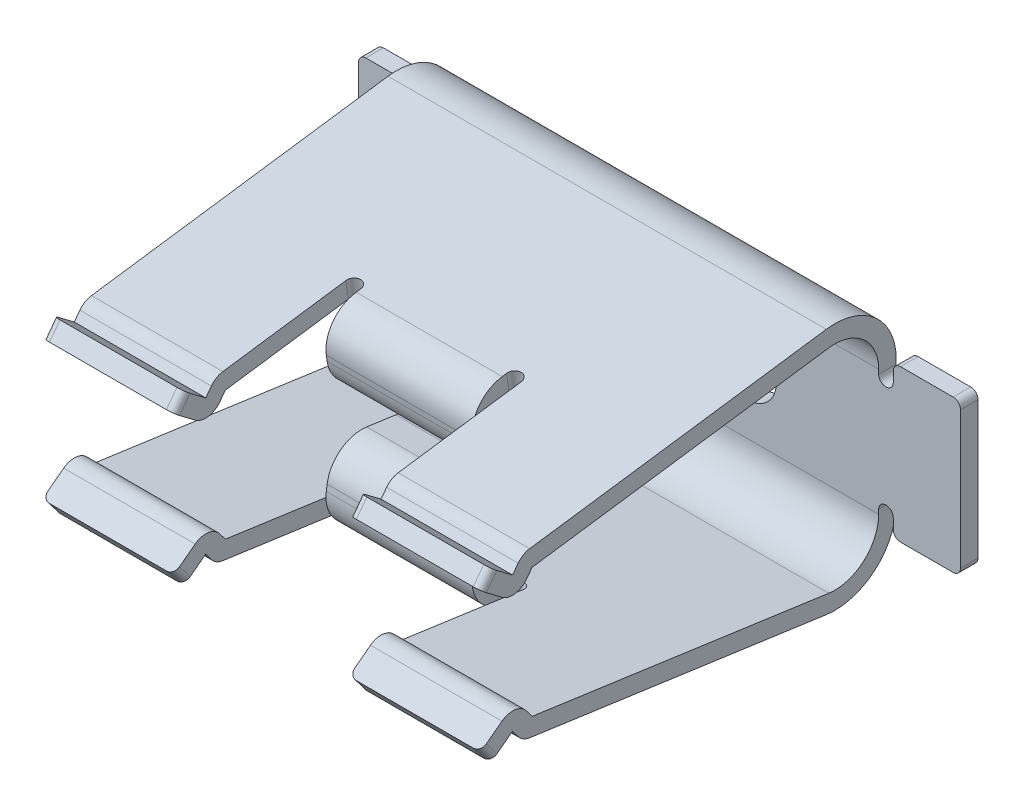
ISO-10303-21;
HEADER;
FILE_DESCRIPTION(('STEP AP214'),'2;1');
FILE_NAME('part.step','',(''),(''),'','','');
FILE_SCHEMA(('AUTOMOTIVE_DESIGN { 1 0 10303 214 1 1 1 1 }'));
ENDSEC;
DATA;
#1=APPLICATION_CONTEXT('core data for automotive mechanical design processes');
#2=APPLICATION_PROTOCOL_DEFINITION('international standard','automotive_design',2000,#1);
#3=PRODUCT_CONTEXT('',#1,'mechanical');
#4=PRODUCT('Part','Part','',(#3));
#5=PRODUCT_RELATED_PRODUCT_CATEGORY('part','',(#4));
#6=PRODUCT_DEFINITION_FORMATION('','',#4);
#7=PRODUCT_DEFINITION_CONTEXT('part definition',#1,'design');
#8=PRODUCT_DEFINITION('design','',#6,#7);
#9=PRODUCT_DEFINITION_SHAPE('','',#8);
#10=(LENGTH_UNIT() NAMED_UNIT(*) SI_UNIT(.MILLI.,.METRE.));
#11=(NAMED_UNIT(*) PLANE_ANGLE_UNIT() SI_UNIT($,.RADIAN.));
#12=(NAMED_UNIT(*) SI_UNIT($,.STERADIAN.) SOLID_ANGLE_UNIT());
#13=UNCERTAINTY_MEASURE_WITH_UNIT(LENGTH_MEASURE(1.E-05),#10,'distance_accuracy_value','');
#14=(GEOMETRIC_REPRESENTATION_CONTEXT(3) GLOBAL_UNCERTAINTY_ASSIGNED_CONTEXT((#13)) GLOBAL_UNIT_ASSIGNED_CONTEXT((#10,
#11,#12)) REPRESENTATION_CONTEXT('',''));
#15=CARTESIAN_POINT('',(0.,0.,0.));
#16=DIRECTION('',(0.,0.,1.));
#17=DIRECTION('',(1.,0.,0.));
#18=AXIS2_PLACEMENT_3D('',#15,#16,#17);
#19=CARTESIAN_POINT('',(15.,-1.59779479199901,12.1370670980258));
#20=DIRECTION('',(1.,0.,0.));
#21=DIRECTION('',(0.,0.,-1.));
#22=AXIS2_PLACEMENT_3D('',#19,#20,#21);
#23=CYLINDRICAL_SURFACE('',#22,1.2);
#24=DIRECTION('',(1.,0.,0.));
#25=VECTOR('',#24,1.);
#26=CARTESIAN_POINT('',(0.,-2.54340769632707,12.8758608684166));
#27=LINE('',#26,#25);
#28=CARTESIAN_POINT('',(20.,-2.54340769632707,12.8758608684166));
#29=VERTEX_POINT('',#28);
#30=CARTESIAN_POINT('',(10.,-2.54340769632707,12.8758608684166));
#31=VERTEX_POINT('',#30);
#32=EDGE_CURVE('E714',#29,#31,#27,.F.);
#33=ORIENTED_EDGE('',*,*,#32,.F.);
#34=CARTESIAN_POINT('',(20.,-1.59779479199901,12.1370670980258));
#35=DIRECTION('',(1.,0.,0.));
#36=DIRECTION('',(0.,0.,-1.));
#37=AXIS2_PLACEMENT_3D('',#34,#35,#36);
#38=CIRCLE('',#37,1.2);
#39=CARTESIAN_POINT('',(20.,-2.71041541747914,11.6875391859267));
#40=VERTEX_POINT('',#39);
#41=EDGE_CURVE('E20',#40,#29,#38,.F.);
#42=ORIENTED_EDGE('',*,*,#41,.F.);
#43=DIRECTION('',(1.,0.,0.));
#44=VECTOR('',#43,1.);
#45=CARTESIAN_POINT('',(0.,-2.71041541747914,11.6875391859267));
#46=LINE('',#45,#44);
#47=CARTESIAN_POINT('',(10.,-2.71041541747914,11.6875391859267));
#48=VERTEX_POINT('',#47);
#49=EDGE_CURVE('E711',#48,#40,#46,.T.);
#50=ORIENTED_EDGE('',*,*,#49,.F.);
#51=CARTESIAN_POINT('',(10.,-1.59779479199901,12.1370670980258));
#52=DIRECTION('',(1.,0.,0.));
#53=DIRECTION('',(0.,0.,-1.));
#54=AXIS2_PLACEMENT_3D('',#51,#52,#53);
#55=CIRCLE('',#54,1.2);
#56=EDGE_CURVE('E717',#31,#48,#55,.T.);
#57=ORIENTED_EDGE('',*,*,#56,.F.);
#58=EDGE_LOOP('',(#33,#42,#50,#57));
#59=FACE_BOUND('',#58,.T.);
#60=ADVANCED_FACE('F17',(#59),#23,.F.);
#61=CARTESIAN_POINT('',(0.,-2.21804773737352,10.4688864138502));
#62=DIRECTION('',(0.,0.927183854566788,0.374606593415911));
#63=DIRECTION('',(0.,-0.374606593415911,0.927183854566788));
#64=AXIS2_PLACEMENT_3D('',#61,#62,#63);
#65=PLANE('',#64);
#66=DIRECTION('',(0.,-0.374606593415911,0.927183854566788));
#67=VECTOR('',#66,1.);
#68=CARTESIAN_POINT('',(20.,-2.21804773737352,10.4688864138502));
#69=LINE('',#68,#67);
#70=CARTESIAN_POINT('',(20.,-2.40535103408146,10.9324783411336));
#71=VERTEX_POINT('',#70);
#72=EDGE_CURVE('E720',#40,#71,#69,.F.);
#73=ORIENTED_EDGE('',*,*,#72,.T.);
#74=CARTESIAN_POINT('',(19.5,-2.40535103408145,10.9324783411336));
#75=DIRECTION('',(0.,0.927183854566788,0.374606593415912));
#76=DIRECTION('',(0.,-0.374606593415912,0.927183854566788));
#77=AXIS2_PLACEMENT_3D('',#74,#75,#76);
#78=CIRCLE('',#77,0.5);
#79=CARTESIAN_POINT('',(19.5,-2.21804773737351,10.4688864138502));
#80=VERTEX_POINT('',#79);
#81=EDGE_CURVE('E725',#71,#80,#78,.T.);
#82=ORIENTED_EDGE('',*,*,#81,.T.);
#83=DIRECTION('',(1.,0.,0.));
#84=VECTOR('',#83,1.);
#85=CARTESIAN_POINT('',(0.,-2.21804773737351,10.4688864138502));
#86=LINE('',#85,#84);
#87=CARTESIAN_POINT('',(10.5,-2.21804773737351,10.4688864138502));
#88=VERTEX_POINT('',#87);
#89=EDGE_CURVE('E1198',#88,#80,#86,.T.);
#90=ORIENTED_EDGE('',*,*,#89,.F.);
#91=CARTESIAN_POINT('',(10.5,-2.40535103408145,10.9324783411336));
#92=DIRECTION('',(0.,0.927183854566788,0.374606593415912));
#93=DIRECTION('',(0.,-0.374606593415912,0.927183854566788));
#94=AXIS2_PLACEMENT_3D('',#91,#92,#93);
#95=CIRCLE('',#94,0.5);
#96=CARTESIAN_POINT('',(10.,-2.40535103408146,10.9324783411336));
#97=VERTEX_POINT('',#96);
#98=EDGE_CURVE('E731',#88,#97,#95,.T.);
#99=ORIENTED_EDGE('',*,*,#98,.T.);
#100=DIRECTION('',(0.,-0.374606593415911,0.927183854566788));
#101=VECTOR('',#100,1.);
#102=CARTESIAN_POINT('',(10.,-2.21804773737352,10.4688864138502));
#103=LINE('',#102,#101);
#104=EDGE_CURVE('E729',#97,#48,#103,.T.);
#105=ORIENTED_EDGE('',*,*,#104,.T.);
#106=ORIENTED_EDGE('',*,*,#49,.T.);
#107=EDGE_LOOP('',(#73,#82,#90,#99,#105,#106));
#108=FACE_BOUND('',#107,.T.);
#109=ADVANCED_FACE('F727',(#108),#65,.T.);
#110=CARTESIAN_POINT('',(0.,-2.96995047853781,12.3299110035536));
#111=DIRECTION('',(0.,0.788010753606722,-0.615661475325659));
#112=DIRECTION('',(0.,0.615661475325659,0.788010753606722));
#113=AXIS2_PLACEMENT_3D('',#110,#111,#112);
#114=PLANE('',#113);
#115=DIRECTION('',(0.,0.615661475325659,0.788010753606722));
#116=VECTOR('',#115,1.);
#117=CARTESIAN_POINT('',(10.,-2.96995047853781,12.3299110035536));
#118=LINE('',#117,#116);
#119=CARTESIAN_POINT('',(10.,-2.3631295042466,13.1066064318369));
#120=VERTEX_POINT('',#119);
#121=EDGE_CURVE('E1187',#31,#120,#118,.T.);
#122=ORIENTED_EDGE('',*,*,#121,.T.);
#123=DIRECTION('',(1.,0.,0.));
#124=VECTOR('',#123,1.);
#125=CARTESIAN_POINT('',(15.,-2.36312950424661,13.1066064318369));
#126=LINE('',#125,#124);
#127=CARTESIAN_POINT('',(20.,-2.3631295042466,13.1066064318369));
#128=VERTEX_POINT('',#127);
#129=EDGE_CURVE('E1174',#128,#120,#126,.F.);
#130=ORIENTED_EDGE('',*,*,#129,.F.);
#131=DIRECTION('',(0.,0.615661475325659,0.788010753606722));
#132=VECTOR('',#131,1.);
#133=CARTESIAN_POINT('',(20.,-2.96995047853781,12.3299110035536));
#134=LINE('',#133,#132);
#135=EDGE_CURVE('E1180',#128,#29,#134,.F.);
#136=ORIENTED_EDGE('',*,*,#135,.T.);
#137=ORIENTED_EDGE('',*,*,#32,.T.);
#138=EDGE_LOOP('',(#122,#130,#136,#137));
#139=FACE_BOUND('',#138,.T.);
#140=ADVANCED_FACE('F1194',(#139),#114,.T.);
#141=CARTESIAN_POINT('',(0.,-3.33066836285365,10.0193585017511));
#142=DIRECTION('',(0.,0.374606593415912,-0.927183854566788));
#143=DIRECTION('',(0.,0.927183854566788,0.374606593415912));
#144=AXIS2_PLACEMENT_3D('',#141,#142,#143);
#145=PLANE('',#144);
#146=ORIENTED_EDGE('',*,*,#89,.T.);
#147=DIRECTION('',(0.,0.927183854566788,0.374606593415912));
#148=VECTOR('',#147,1.);
#149=CARTESIAN_POINT('',(19.5,-3.33066836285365,10.0193585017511));
#150=LINE('',#149,#148);
#151=CARTESIAN_POINT('',(19.5,-3.33066836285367,10.0193585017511));
#152=VERTEX_POINT('',#151);
#153=EDGE_CURVE('E1178',#80,#152,#150,.F.);
#154=ORIENTED_EDGE('',*,*,#153,.T.);
#155=DIRECTION('',(1.,0.,0.));
#156=VECTOR('',#155,1.);
#157=CARTESIAN_POINT('',(0.,-3.33066836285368,10.0193585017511));
#158=LINE('',#157,#156);
#159=CARTESIAN_POINT('',(10.5,-3.33066836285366,10.0193585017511));
#160=VERTEX_POINT('',#159);
#161=EDGE_CURVE('E1166',#160,#152,#158,.T.);
#162=ORIENTED_EDGE('',*,*,#161,.F.);
#163=DIRECTION('',(0.,0.927183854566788,0.374606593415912));
#164=VECTOR('',#163,1.);
#165=CARTESIAN_POINT('',(10.5,-3.33066836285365,10.0193585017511));
#166=LINE('',#165,#164);
#167=EDGE_CURVE('E1192',#160,#88,#166,.T.);
#168=ORIENTED_EDGE('',*,*,#167,.T.);
#169=EDGE_LOOP('',(#146,#154,#162,#168));
#170=FACE_BOUND('',#169,.T.);
#171=ADVANCED_FACE('F2244',(#170),#145,.T.);
#172=CARTESIAN_POINT('',(15.,-4.25435531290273,14.5841939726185));
#173=DIRECTION('',(1.,0.,0.));
#174=DIRECTION('',(0.,0.,-1.));
#175=AXIS2_PLACEMENT_3D('',#172,#173,#174);
#176=CYLINDRICAL_SURFACE('',#175,2.4);
#177=CARTESIAN_POINT('',(10.,-4.25435531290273,14.5841939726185));
#178=DIRECTION('',(1.,0.,0.));
#179=DIRECTION('',(0.,0.,-1.));
#180=AXIS2_PLACEMENT_3D('',#177,#178,#179);
#181=CIRCLE('',#180,2.4);
#182=CARTESIAN_POINT('',(10.,-1.87771194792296,14.2501785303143));
#183=VERTEX_POINT('',#182);
#184=EDGE_CURVE('E1172',#120,#183,#181,.T.);
#185=ORIENTED_EDGE('',*,*,#184,.T.);
#186=DIRECTION('',(1.,0.,0.));
#187=VECTOR('',#186,1.);
#188=CARTESIAN_POINT('',(0.,-1.87771194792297,14.2501785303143));
#189=LINE('',#188,#187);
#190=CARTESIAN_POINT('',(20.,-1.87771194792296,14.2501785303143));
#191=VERTEX_POINT('',#190);
#192=EDGE_CURVE('E1152',#191,#183,#189,.F.);
#193=ORIENTED_EDGE('',*,*,#192,.F.);
#194=CARTESIAN_POINT('',(20.,-4.25435531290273,14.5841939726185));
#195=DIRECTION('',(1.,0.,0.));
#196=DIRECTION('',(0.,0.,-1.));
#197=AXIS2_PLACEMENT_3D('',#194,#195,#196);
#198=CIRCLE('',#197,2.4);
#199=EDGE_CURVE('E1175',#191,#128,#198,.F.);
#200=ORIENTED_EDGE('',*,*,#199,.T.);
#201=ORIENTED_EDGE('',*,*,#129,.T.);
#202=EDGE_LOOP('',(#185,#193,#200,#201));
#203=FACE_BOUND('',#202,.T.);
#204=ADVANCED_FACE('F1213',(#203),#176,.T.);
#205=CARTESIAN_POINT('',(15.,-4.25435531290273,14.5841939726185));
#206=DIRECTION('',(1.,0.,0.));
#207=DIRECTION('',(0.,0.,-1.));
#208=AXIS2_PLACEMENT_3D('',#205,#206,#207);
#209=CYLINDRICAL_SURFACE('',#208,1.2);
#210=DIRECTION('',(1.,0.,0.));
#211=VECTOR('',#210,1.);
#212=CARTESIAN_POINT('',(0.,-3.30874240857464,13.8454002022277));
#213=LINE('',#212,#211);
#214=CARTESIAN_POINT('',(20.,-3.30874240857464,13.8454002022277));
#215=VERTEX_POINT('',#214);
#216=CARTESIAN_POINT('',(10.,-3.30874240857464,13.8454002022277));
#217=VERTEX_POINT('',#216);
#218=EDGE_CURVE('E1209',#215,#217,#213,.F.);
#219=ORIENTED_EDGE('',*,*,#218,.F.);
#220=CARTESIAN_POINT('',(20.,-4.25435531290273,14.5841939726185));
#221=DIRECTION('',(1.,0.,0.));
#222=DIRECTION('',(0.,0.,-1.));
#223=AXIS2_PLACEMENT_3D('',#220,#221,#222);
#224=CIRCLE('',#223,1.2);
#225=CARTESIAN_POINT('',(20.,-3.06603363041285,14.4171862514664));
#226=VERTEX_POINT('',#225);
#227=EDGE_CURVE('E1170',#226,#215,#224,.F.);
#228=ORIENTED_EDGE('',*,*,#227,.F.);
#229=DIRECTION('',(1.,0.,0.));
#230=VECTOR('',#229,1.);
#231=CARTESIAN_POINT('',(0.,-3.06603363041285,14.4171862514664));
#232=LINE('',#231,#230);
#233=CARTESIAN_POINT('',(10.,-3.06603363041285,14.4171862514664));
#234=VERTEX_POINT('',#233);
#235=EDGE_CURVE('E1301',#234,#226,#232,.T.);
#236=ORIENTED_EDGE('',*,*,#235,.F.);
#237=CARTESIAN_POINT('',(10.,-4.25435531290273,14.5841939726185));
#238=DIRECTION('',(1.,0.,0.));
#239=DIRECTION('',(0.,0.,-1.));
#240=AXIS2_PLACEMENT_3D('',#237,#238,#239);
#241=CIRCLE('',#240,1.2);
#242=EDGE_CURVE('E1167',#217,#234,#241,.T.);
#243=ORIENTED_EDGE('',*,*,#242,.F.);
#244=EDGE_LOOP('',(#219,#228,#236,#243));
#245=FACE_BOUND('',#244,.T.);
#246=ADVANCED_FACE('F1355',(#245),#209,.F.);
#247=CARTESIAN_POINT('',(0.,-3.11078321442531,14.0987764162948));
#248=DIRECTION('',(0.,-0.788010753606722,0.615661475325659));
#249=DIRECTION('',(0.,-0.615661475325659,-0.788010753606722));
#250=AXIS2_PLACEMENT_3D('',#247,#248,#249);
#251=PLANE('',#250);
#252=DIRECTION('',(0.,-0.615661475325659,-0.788010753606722));
#253=VECTOR('',#252,1.);
#254=CARTESIAN_POINT('',(10.,-3.11078321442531,14.0987764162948));
#255=LINE('',#254,#253);
#256=CARTESIAN_POINT('',(10.,-3.48902060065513,13.6146546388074));
#257=VERTEX_POINT('',#256);
#258=EDGE_CURVE('E1211',#217,#257,#255,.T.);
#259=ORIENTED_EDGE('',*,*,#258,.T.);
#260=DIRECTION('',(1.,0.,0.));
#261=VECTOR('',#260,1.);
#262=CARTESIAN_POINT('',(15.,-3.48902060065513,13.6146546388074));
#263=LINE('',#262,#261);
#264=CARTESIAN_POINT('',(20.,-3.48902060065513,13.6146546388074));
#265=VERTEX_POINT('',#264);
#266=EDGE_CURVE('E1298',#265,#257,#263,.F.);
#267=ORIENTED_EDGE('',*,*,#266,.F.);
#268=DIRECTION('',(0.,-0.615661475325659,-0.788010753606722));
#269=VECTOR('',#268,1.);
#270=CARTESIAN_POINT('',(20.,-3.11078321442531,14.0987764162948));
#271=LINE('',#270,#269);
#272=EDGE_CURVE('E1169',#265,#215,#271,.F.);
#273=ORIENTED_EDGE('',*,*,#272,.T.);
#274=ORIENTED_EDGE('',*,*,#218,.T.);
#275=EDGE_LOOP('',(#259,#267,#273,#274));
#276=FACE_BOUND('',#275,.T.);
#277=ADVANCED_FACE('F1341',(#276),#251,.T.);
#278=CARTESIAN_POINT('',(0.,-4.34210616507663,12.5227549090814));
#279=DIRECTION('',(0.,-0.927183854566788,-0.374606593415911));
#280=DIRECTION('',(0.,0.374606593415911,-0.927183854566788));
#281=AXIS2_PLACEMENT_3D('',#278,#279,#280);
#282=PLANE('',#281);
#283=ORIENTED_EDGE('',*,*,#161,.T.);
#284=CARTESIAN_POINT('',(19.5,-3.5179716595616,10.4829504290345));
#285=DIRECTION('',(0.,0.927183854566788,0.374606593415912));
#286=DIRECTION('',(0.,-0.374606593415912,0.927183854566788));
#287=AXIS2_PLACEMENT_3D('',#284,#285,#286);
#288=CIRCLE('',#287,0.5);
#289=CARTESIAN_POINT('',(20.,-3.51797165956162,10.4829504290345));
#290=VERTEX_POINT('',#289);
#291=EDGE_CURVE('E1163',#152,#290,#288,.F.);
#292=ORIENTED_EDGE('',*,*,#291,.T.);
#293=DIRECTION('',(0.,0.374606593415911,-0.927183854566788));
#294=VECTOR('',#293,1.);
#295=CARTESIAN_POINT('',(20.,-4.34210616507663,12.5227549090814));
#296=LINE('',#295,#294);
#297=CARTESIAN_POINT('',(20.,-3.8230360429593,11.2380112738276));
#298=VERTEX_POINT('',#297);
#299=EDGE_CURVE('E1334',#290,#298,#296,.F.);
#300=ORIENTED_EDGE('',*,*,#299,.T.);
#301=DIRECTION('',(1.,0.,0.));
#302=VECTOR('',#301,1.);
#303=CARTESIAN_POINT('',(15.,-3.8230360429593,11.2380112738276));
#304=LINE('',#303,#302);
#305=CARTESIAN_POINT('',(10.,-3.8230360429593,11.2380112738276));
#306=VERTEX_POINT('',#305);
#307=EDGE_CURVE('E1295',#306,#298,#304,.T.);
#308=ORIENTED_EDGE('',*,*,#307,.F.);
#309=DIRECTION('',(0.,0.374606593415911,-0.927183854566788));
#310=VECTOR('',#309,1.);
#311=CARTESIAN_POINT('',(10.,-4.34210616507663,12.5227549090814));
#312=LINE('',#311,#310);
#313=CARTESIAN_POINT('',(10.,-3.51797165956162,10.4829504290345));
#314=VERTEX_POINT('',#313);
#315=EDGE_CURVE('E1332',#306,#314,#312,.T.);
#316=ORIENTED_EDGE('',*,*,#315,.T.);
#317=CARTESIAN_POINT('',(10.5,-3.51797165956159,10.4829504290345));
#318=DIRECTION('',(0.,0.927183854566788,0.374606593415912));
#319=DIRECTION('',(0.,-0.374606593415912,0.927183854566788));
#320=AXIS2_PLACEMENT_3D('',#317,#318,#319);
#321=CIRCLE('',#320,0.5);
#322=EDGE_CURVE('E1149',#160,#314,#321,.T.);
#323=ORIENTED_EDGE('',*,*,#322,.F.);
#324=EDGE_LOOP('',(#283,#292,#300,#308,#316,#323));
#325=FACE_BOUND('',#324,.T.);
#326=ADVANCED_FACE('F1350',(#325),#282,.T.);
#327=CARTESIAN_POINT('',(0.,-4.63002275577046,26.2606227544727));
#328=DIRECTION('',(0.,0.798635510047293,0.601815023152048));
#329=DIRECTION('',(0.,-0.601815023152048,0.798635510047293));
#330=AXIS2_PLACEMENT_3D('',#327,#328,#329);
#331=PLANE('',#330);
#332=CARTESIAN_POINT('',(29.5,-5.43804409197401,27.3329032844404));
#333=DIRECTION('',(0.,0.798635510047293,0.601815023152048));
#334=DIRECTION('',(0.,-0.601815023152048,0.798635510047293));
#335=AXIS2_PLACEMENT_3D('',#332,#333,#334);
#336=CIRCLE('',#335,0.499999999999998);
#337=CARTESIAN_POINT('',(29.5,-5.73895160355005,27.7322210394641));
#338=VERTEX_POINT('',#337);
#339=CARTESIAN_POINT('',(30.,-5.438044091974,27.3329032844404));
#340=VERTEX_POINT('',#339);
#341=EDGE_CURVE('E1159',#338,#340,#336,.T.);
#342=ORIENTED_EDGE('',*,*,#341,.F.);
#343=DIRECTION('',(1.,0.,0.));
#344=VECTOR('',#343,1.);
#345=CARTESIAN_POINT('',(0.,-5.73895160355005,27.7322210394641));
#346=LINE('',#345,#344);
#347=CARTESIAN_POINT('',(21.5,-5.73895160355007,27.7322210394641));
#348=VERTEX_POINT('',#347);
#349=EDGE_CURVE('E1280',#338,#348,#346,.F.);
#350=ORIENTED_EDGE('',*,*,#349,.T.);
#351=CARTESIAN_POINT('',(21.5,-5.43804409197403,27.3329032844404));
#352=DIRECTION('',(0.,0.798635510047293,0.601815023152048));
#353=DIRECTION('',(0.,-0.601815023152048,0.798635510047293));
#354=AXIS2_PLACEMENT_3D('',#351,#352,#353);
#355=CIRCLE('',#354,0.499999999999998);
#356=CARTESIAN_POINT('',(21.,-5.43804409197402,27.3329032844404));
#357=VERTEX_POINT('',#356);
#358=EDGE_CURVE('E1144',#357,#348,#355,.T.);
#359=ORIENTED_EDGE('',*,*,#358,.F.);
#360=DIRECTION('',(0.,-0.601815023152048,0.798635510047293));
#361=VECTOR('',#360,1.);
#362=CARTESIAN_POINT('',(21.,-4.63002275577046,26.2606227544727));
#363=LINE('',#362,#361);
#364=CARTESIAN_POINT('',(21.,-4.63002275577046,26.2606227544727));
#365=VERTEX_POINT('',#364);
#366=EDGE_CURVE('E1162',#365,#357,#363,.T.);
#367=ORIENTED_EDGE('',*,*,#366,.F.);
#368=DIRECTION('',(1.,0.,0.));
#369=VECTOR('',#368,1.);
#370=CARTESIAN_POINT('',(0.,-4.63002275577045,26.2606227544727));
#371=LINE('',#370,#369);
#372=CARTESIAN_POINT('',(30.,-4.63002275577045,26.2606227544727));
#373=VERTEX_POINT('',#372);
#374=EDGE_CURVE('E1256',#365,#373,#371,.T.);
#375=ORIENTED_EDGE('',*,*,#374,.T.);
#376=DIRECTION('',(0.,-0.601815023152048,0.798635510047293));
#377=VECTOR('',#376,1.);
#378=CARTESIAN_POINT('',(30.,-4.63002275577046,26.2606227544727));
#379=LINE('',#378,#377);
#380=EDGE_CURVE('E1161',#340,#373,#379,.F.);
#381=ORIENTED_EDGE('',*,*,#380,.F.);
#382=EDGE_LOOP('',(#342,#350,#359,#367,#375,#381));
#383=FACE_BOUND('',#382,.T.);
#384=ADVANCED_FACE('F2231',(#383),#331,.F.);
#385=CARTESIAN_POINT('',(0.,-4.63002275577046,26.2606227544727));
#386=DIRECTION('',(0.,0.798635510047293,0.601815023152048));
#387=DIRECTION('',(0.,-0.601815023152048,0.798635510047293));
#388=AXIS2_PLACEMENT_3D('',#385,#386,#387);
#389=PLANE('',#388);
#390=CARTESIAN_POINT('',(8.5,-5.438044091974,27.3329032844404));
#391=DIRECTION('',(0.,0.798635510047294,0.601815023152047));
#392=DIRECTION('',(0.,-0.601815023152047,0.798635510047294));
#393=AXIS2_PLACEMENT_3D('',#390,#391,#392);
#394=CIRCLE('',#393,0.5);
#395=CARTESIAN_POINT('',(8.5,-5.73895160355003,27.7322210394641));
#396=VERTEX_POINT('',#395);
#397=CARTESIAN_POINT('',(9.,-5.438044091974,27.3329032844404));
#398=VERTEX_POINT('',#397);
#399=EDGE_CURVE('E1154',#396,#398,#394,.T.);
#400=ORIENTED_EDGE('',*,*,#399,.F.);
#401=DIRECTION('',(1.,0.,0.));
#402=VECTOR('',#401,1.);
#403=CARTESIAN_POINT('',(0.,-5.73895160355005,27.7322210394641));
#404=LINE('',#403,#402);
#405=CARTESIAN_POINT('',(0.5,-5.73895160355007,27.7322210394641));
#406=VERTEX_POINT('',#405);
#407=EDGE_CURVE('E1281',#396,#406,#404,.F.);
#408=ORIENTED_EDGE('',*,*,#407,.T.);
#409=CARTESIAN_POINT('',(0.5,-5.43804409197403,27.3329032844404));
#410=DIRECTION('',(0.,0.798635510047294,0.601815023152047));
#411=DIRECTION('',(0.,-0.601815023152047,0.798635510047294));
#412=AXIS2_PLACEMENT_3D('',#409,#410,#411);
#413=CIRCLE('',#412,0.5);
#414=CARTESIAN_POINT('',(0.,-5.43804409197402,27.3329032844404));
#415=VERTEX_POINT('',#414);
#416=EDGE_CURVE('E1156',#415,#406,#413,.T.);
#417=ORIENTED_EDGE('',*,*,#416,.F.);
#418=DIRECTION('',(0.,-0.601815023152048,0.798635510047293));
#419=VECTOR('',#418,1.);
#420=CARTESIAN_POINT('',(0.,-4.63002275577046,26.2606227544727));
#421=LINE('',#420,#419);
#422=CARTESIAN_POINT('',(0.,-4.63002275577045,26.2606227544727));
#423=VERTEX_POINT('',#422);
#424=EDGE_CURVE('E1158',#423,#415,#421,.T.);
#425=ORIENTED_EDGE('',*,*,#424,.F.);
#426=DIRECTION('',(1.,0.,0.));
#427=VECTOR('',#426,1.);
#428=CARTESIAN_POINT('',(0.,-4.63002275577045,26.2606227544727));
#429=LINE('',#428,#427);
#430=CARTESIAN_POINT('',(9.00000000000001,-4.63002275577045,26.2606227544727));
#431=VERTEX_POINT('',#430);
#432=EDGE_CURVE('E1250',#423,#431,#429,.T.);
#433=ORIENTED_EDGE('',*,*,#432,.T.);
#434=DIRECTION('',(0.,-0.601815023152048,0.798635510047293));
#435=VECTOR('',#434,1.);
#436=CARTESIAN_POINT('',(9.,-4.63002275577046,26.2606227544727));
#437=LINE('',#436,#435);
#438=EDGE_CURVE('E1153',#398,#431,#437,.F.);
#439=ORIENTED_EDGE('',*,*,#438,.F.);
#440=EDGE_LOOP('',(#400,#408,#417,#425,#433,#439));
#441=FACE_BOUND('',#440,.T.);
#442=ADVANCED_FACE('F2227',(#441),#389,.F.);
#443=CARTESIAN_POINT('',(10.5,-4.18179741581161,10.2147474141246));
#444=DIRECTION('',(0.,0.927183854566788,0.374606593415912));
#445=DIRECTION('',(0.,-0.374606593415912,0.927183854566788));
#446=AXIS2_PLACEMENT_3D('',#443,#444,#445);
#447=CYLINDRICAL_SURFACE('',#446,0.5);
#448=ORIENTED_EDGE('',*,*,#322,.T.);
#449=DIRECTION('',(0.,-0.927183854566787,-0.374606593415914));
#450=VECTOR('',#449,1.);
#451=CARTESIAN_POINT('',(10.,-2.40535103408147,10.9324783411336));
#452=LINE('',#451,#450);
#453=EDGE_CURVE('E1221',#97,#314,#452,.T.);
#454=ORIENTED_EDGE('',*,*,#453,.F.);
#455=ORIENTED_EDGE('',*,*,#98,.F.);
#456=ORIENTED_EDGE('',*,*,#167,.F.);
#457=EDGE_LOOP('',(#448,#454,#455,#456));
#458=FACE_BOUND('',#457,.T.);
#459=ADVANCED_FACE('F2224',(#458),#447,.T.);
#460=CARTESIAN_POINT('',(0.,-1.96721111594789,13.6133588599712));
#461=DIRECTION('',(0.,0.99026806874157,-0.139173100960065));
#462=DIRECTION('',(0.,0.139173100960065,0.99026806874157));
#463=AXIS2_PLACEMENT_3D('',#460,#461,#462);
#464=PLANE('',#463);
#465=DIRECTION('',(0.,0.139173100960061,0.990268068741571));
#466=VECTOR('',#465,1.);
#467=CARTESIAN_POINT('',(20.,-1.87771194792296,14.2501785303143));
#468=LINE('',#467,#466);
#469=CARTESIAN_POINT('',(20.,-1.59790278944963,16.2411241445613));
#470=VERTEX_POINT('',#469);
#471=EDGE_CURVE('E1129',#191,#470,#468,.T.);
#472=ORIENTED_EDGE('',*,*,#471,.F.);
#473=ORIENTED_EDGE('',*,*,#192,.T.);
#474=DIRECTION('',(0.,-0.139173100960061,-0.990268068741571));
#475=VECTOR('',#474,1.);
#476=CARTESIAN_POINT('',(10.,-1.59790278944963,16.2411241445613));
#477=LINE('',#476,#475);
#478=CARTESIAN_POINT('',(10.,-1.59790278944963,16.2411241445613));
#479=VERTEX_POINT('',#478);
#480=EDGE_CURVE('E1133',#479,#183,#477,.T.);
#481=ORIENTED_EDGE('',*,*,#480,.F.);
#482=DIRECTION('',(1.,0.,0.));
#483=VECTOR('',#482,1.);
#484=CARTESIAN_POINT('',(15.,-1.59790278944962,16.2411241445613));
#485=LINE('',#484,#483);
#486=EDGE_CURVE('E1288',#470,#479,#485,.F.);
#487=ORIENTED_EDGE('',*,*,#486,.F.);
#488=EDGE_LOOP('',(#472,#473,#481,#487));
#489=FACE_BOUND('',#488,.T.);
#490=ADVANCED_FACE('F2221',(#489),#464,.T.);
#491=CARTESIAN_POINT('',(15.,-3.97454615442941,16.5751395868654));
#492=DIRECTION('',(1.,0.,0.));
#493=DIRECTION('',(0.,0.,-1.));
#494=AXIS2_PLACEMENT_3D('',#491,#492,#493);
#495=CYLINDRICAL_SURFACE('',#494,1.2);
#496=DIRECTION('',(1.,0.,0.));
#497=VECTOR('',#496,1.);
#498=CARTESIAN_POINT('',(0.,-2.78622447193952,16.4081318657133));
#499=LINE('',#498,#497);
#500=CARTESIAN_POINT('',(20.,-2.78622447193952,16.4081318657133));
#501=VERTEX_POINT('',#500);
#502=CARTESIAN_POINT('',(10.,-2.78622447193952,16.4081318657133));
#503=VERTEX_POINT('',#502);
#504=EDGE_CURVE('E1302',#501,#503,#499,.F.);
#505=ORIENTED_EDGE('',*,*,#504,.F.);
#506=CARTESIAN_POINT('',(20.,-3.97454615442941,16.5751395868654));
#507=DIRECTION('',(1.,0.,0.));
#508=DIRECTION('',(0.,0.,-1.));
#509=AXIS2_PLACEMENT_3D('',#506,#507,#508);
#510=CIRCLE('',#509,1.2);
#511=CARTESIAN_POINT('',(20.,-3.80753843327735,17.7634612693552));
#512=VERTEX_POINT('',#511);
#513=EDGE_CURVE('E1121',#512,#501,#510,.F.);
#514=ORIENTED_EDGE('',*,*,#513,.F.);
#515=DIRECTION('',(1.,0.,0.));
#516=VECTOR('',#515,1.);
#517=CARTESIAN_POINT('',(0.,-3.80753843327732,17.7634612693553));
#518=LINE('',#517,#516);
#519=CARTESIAN_POINT('',(10.,-3.80753843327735,17.7634612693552));
#520=VERTEX_POINT('',#519);
#521=EDGE_CURVE('E1148',#512,#520,#518,.F.);
#522=ORIENTED_EDGE('',*,*,#521,.T.);
#523=CARTESIAN_POINT('',(10.,-3.97454615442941,16.5751395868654));
#524=DIRECTION('',(1.,0.,0.));
#525=DIRECTION('',(0.,0.,-1.));
#526=AXIS2_PLACEMENT_3D('',#523,#524,#525);
#527=CIRCLE('',#526,1.2);
#528=EDGE_CURVE('E1135',#503,#520,#527,.T.);
#529=ORIENTED_EDGE('',*,*,#528,.F.);
#530=EDGE_LOOP('',(#505,#514,#522,#529));
#531=FACE_BOUND('',#530,.T.);
#532=ADVANCED_FACE('F1362',(#531),#495,.F.);
#533=CARTESIAN_POINT('',(0.,-2.61921675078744,17.5964535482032));
#534=DIRECTION('',(0.,-0.99026806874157,0.139173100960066));
#535=DIRECTION('',(0.,-0.139173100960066,-0.99026806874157));
#536=AXIS2_PLACEMENT_3D('',#533,#534,#535);
#537=PLANE('',#536);
#538=DIRECTION('',(0.,0.139173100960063,0.990268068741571));
#539=VECTOR('',#538,1.);
#540=CARTESIAN_POINT('',(10.,-3.06603363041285,14.4171862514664));
#541=LINE('',#540,#539);
#542=EDGE_CURVE('E1139',#234,#503,#541,.T.);
#543=ORIENTED_EDGE('',*,*,#542,.F.);
#544=ORIENTED_EDGE('',*,*,#235,.T.);
#545=DIRECTION('',(0.,-0.139173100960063,-0.990268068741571));
#546=VECTOR('',#545,1.);
#547=CARTESIAN_POINT('',(20.,-2.78622447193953,16.4081318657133));
#548=LINE('',#547,#546);
#549=EDGE_CURVE('E1120',#501,#226,#548,.T.);
#550=ORIENTED_EDGE('',*,*,#549,.F.);
#551=ORIENTED_EDGE('',*,*,#504,.T.);
#552=EDGE_LOOP('',(#543,#544,#550,#551));
#553=FACE_BOUND('',#552,.T.);
#554=ADVANCED_FACE('F1359',(#553),#537,.T.);
#555=CARTESIAN_POINT('',(15.,-1.59779479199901,12.1370670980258));
#556=DIRECTION('',(1.,0.,0.));
#557=DIRECTION('',(0.,0.,-1.));
#558=AXIS2_PLACEMENT_3D('',#555,#556,#557);
#559=CYLINDRICAL_SURFACE('',#558,2.4);
#560=CARTESIAN_POINT('',(10.,-1.59779479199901,12.1370670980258));
#561=DIRECTION('',(1.,0.,0.));
#562=DIRECTION('',(0.,0.,-1.));
#563=AXIS2_PLACEMENT_3D('',#560,#561,#562);
#564=CIRCLE('',#563,2.4);
#565=EDGE_CURVE('E1140',#306,#257,#564,.F.);
#566=ORIENTED_EDGE('',*,*,#565,.F.);
#567=ORIENTED_EDGE('',*,*,#307,.T.);
#568=CARTESIAN_POINT('',(20.,-1.59779479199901,12.1370670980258));
#569=DIRECTION('',(1.,0.,0.));
#570=DIRECTION('',(0.,0.,-1.));
#571=AXIS2_PLACEMENT_3D('',#568,#569,#570);
#572=CIRCLE('',#571,2.4);
#573=EDGE_CURVE('E1117',#265,#298,#572,.T.);
#574=ORIENTED_EDGE('',*,*,#573,.F.);
#575=ORIENTED_EDGE('',*,*,#266,.T.);
#576=EDGE_LOOP('',(#566,#567,#574,#575));
#577=FACE_BOUND('',#576,.T.);
#578=ADVANCED_FACE('F1346',(#577),#559,.T.);
#579=CARTESIAN_POINT('',(19.5,-4.18179741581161,10.2147474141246));
#580=DIRECTION('',(0.,0.927183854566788,0.374606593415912));
#581=DIRECTION('',(0.,-0.374606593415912,0.927183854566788));
#582=AXIS2_PLACEMENT_3D('',#579,#580,#581);
#583=CYLINDRICAL_SURFACE('',#582,0.5);
#584=ORIENTED_EDGE('',*,*,#291,.F.);
#585=ORIENTED_EDGE('',*,*,#153,.F.);
#586=ORIENTED_EDGE('',*,*,#81,.F.);
#587=DIRECTION('',(0.,0.927183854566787,0.374606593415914));
#588=VECTOR('',#587,1.);
#589=CARTESIAN_POINT('',(20.,-3.51797165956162,10.4829504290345));
#590=LINE('',#589,#588);
#591=EDGE_CURVE('E723',#290,#71,#590,.T.);
#592=ORIENTED_EDGE('',*,*,#591,.F.);
#593=EDGE_LOOP('',(#584,#585,#586,#592));
#594=FACE_BOUND('',#593,.T.);
#595=ADVANCED_FACE('F2210',(#594),#583,.T.);
#596=CARTESIAN_POINT('',(15.,-3.9745461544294,16.5751395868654));
#597=DIRECTION('',(1.,0.,0.));
#598=DIRECTION('',(0.,0.,-1.));
#599=AXIS2_PLACEMENT_3D('',#596,#597,#598);
#600=CYLINDRICAL_SURFACE('',#599,2.4);
#601=CARTESIAN_POINT('',(10.,-3.9745461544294,16.5751395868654));
#602=DIRECTION('',(1.,0.,0.));
#603=DIRECTION('',(0.,0.,-1.));
#604=AXIS2_PLACEMENT_3D('',#601,#602,#603);
#605=CIRCLE('',#604,2.4);
#606=CARTESIAN_POINT('',(10.,-3.64053071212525,18.9517829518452));
#607=VERTEX_POINT('',#606);
#608=EDGE_CURVE('E1130',#607,#479,#605,.F.);
#609=ORIENTED_EDGE('',*,*,#608,.F.);
#610=DIRECTION('',(1.,0.,0.));
#611=VECTOR('',#610,1.);
#612=CARTESIAN_POINT('',(0.,-3.64053071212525,18.9517829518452));
#613=LINE('',#612,#611);
#614=CARTESIAN_POINT('',(20.,-3.64053071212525,18.9517829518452));
#615=VERTEX_POINT('',#614);
#616=EDGE_CURVE('E1233',#607,#615,#613,.T.);
#617=ORIENTED_EDGE('',*,*,#616,.T.);
#618=CARTESIAN_POINT('',(20.,-3.9745461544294,16.5751395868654));
#619=DIRECTION('',(1.,0.,0.));
#620=DIRECTION('',(0.,0.,-1.));
#621=AXIS2_PLACEMENT_3D('',#618,#619,#620);
#622=CIRCLE('',#621,2.4);
#623=EDGE_CURVE('E1125',#470,#615,#622,.T.);
#624=ORIENTED_EDGE('',*,*,#623,.F.);
#625=ORIENTED_EDGE('',*,*,#486,.T.);
#626=EDGE_LOOP('',(#609,#617,#624,#625));
#627=FACE_BOUND('',#626,.T.);
#628=ADVANCED_FACE('F2206',(#627),#600,.T.);
#629=CARTESIAN_POINT('',(0.,-5.73895160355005,27.7322210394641));
#630=DIRECTION('',(0.,0.601815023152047,-0.798635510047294));
#631=DIRECTION('',(0.,0.798635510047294,0.601815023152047));
#632=AXIS2_PLACEMENT_3D('',#629,#630,#631);
#633=PLANE('',#632);
#634=DIRECTION('',(0.,0.798635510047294,0.601815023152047));
#635=VECTOR('',#634,1.);
#636=CARTESIAN_POINT('',(8.5,-5.41044322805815,27.9797698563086));
#637=LINE('',#636,#635);
#638=CARTESIAN_POINT('',(8.5,-4.7805889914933,28.4543990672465));
#639=VERTEX_POINT('',#638);
#640=EDGE_CURVE('E1143',#639,#396,#637,.F.);
#641=ORIENTED_EDGE('',*,*,#640,.F.);
#642=DIRECTION('',(1.,0.,0.));
#643=VECTOR('',#642,1.);
#644=CARTESIAN_POINT('',(0.,-4.78058899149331,28.4543990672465));
#645=LINE('',#644,#643);
#646=CARTESIAN_POINT('',(0.5,-4.78058899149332,28.4543990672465));
#647=VERTEX_POINT('',#646);
#648=EDGE_CURVE('E1109',#639,#647,#645,.F.);
#649=ORIENTED_EDGE('',*,*,#648,.T.);
#650=DIRECTION('',(0.,0.798635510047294,0.601815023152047));
#651=VECTOR('',#650,1.);
#652=CARTESIAN_POINT('',(0.5,-5.73895160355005,27.7322210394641));
#653=LINE('',#652,#651);
#654=EDGE_CURVE('E1286',#406,#647,#653,.T.);
#655=ORIENTED_EDGE('',*,*,#654,.F.);
#656=ORIENTED_EDGE('',*,*,#407,.F.);
#657=EDGE_LOOP('',(#641,#649,#655,#656));
#658=FACE_BOUND('',#657,.T.);
#659=ADVANCED_FACE('F2202',(#658),#633,.F.);
#660=CARTESIAN_POINT('',(0.,-5.73895160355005,27.7322210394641));
#661=DIRECTION('',(0.,0.601815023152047,-0.798635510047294));
#662=DIRECTION('',(0.,0.798635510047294,0.601815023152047));
#663=AXIS2_PLACEMENT_3D('',#660,#661,#662);
#664=PLANE('',#663);
#665=DIRECTION('',(0.,0.798635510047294,0.601815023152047));
#666=VECTOR('',#665,1.);
#667=CARTESIAN_POINT('',(29.5,-5.73895160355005,27.7322210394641));
#668=LINE('',#667,#666);
#669=CARTESIAN_POINT('',(29.5,-4.7805889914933,28.4543990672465));
#670=VERTEX_POINT('',#669);
#671=EDGE_CURVE('E1278',#670,#338,#668,.F.);
#672=ORIENTED_EDGE('',*,*,#671,.F.);
#673=DIRECTION('',(1.,0.,0.));
#674=VECTOR('',#673,1.);
#675=CARTESIAN_POINT('',(0.,-4.78058899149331,28.4543990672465));
#676=LINE('',#675,#674);
#677=CARTESIAN_POINT('',(21.5,-4.78058899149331,28.4543990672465));
#678=VERTEX_POINT('',#677);
#679=EDGE_CURVE('E1105',#670,#678,#676,.F.);
#680=ORIENTED_EDGE('',*,*,#679,.T.);
#681=DIRECTION('',(0.,0.798635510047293,0.601815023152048));
#682=VECTOR('',#681,1.);
#683=CARTESIAN_POINT('',(21.5,-5.41044322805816,27.9797698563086));
#684=LINE('',#683,#682);
#685=EDGE_CURVE('E1147',#348,#678,#684,.T.);
#686=ORIENTED_EDGE('',*,*,#685,.F.);
#687=ORIENTED_EDGE('',*,*,#349,.F.);
#688=EDGE_LOOP('',(#672,#680,#686,#687));
#689=FACE_BOUND('',#688,.T.);
#690=ADVANCED_FACE('F2199',(#689),#664,.F.);
#691=CARTESIAN_POINT('',(0.,-2.61921675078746,17.5964535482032));
#692=DIRECTION('',(0.,0.139173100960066,0.99026806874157));
#693=DIRECTION('',(0.,-0.99026806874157,0.139173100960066));
#694=AXIS2_PLACEMENT_3D('',#691,#692,#693);
#695=PLANE('',#694);
#696=ORIENTED_EDGE('',*,*,#521,.F.);
#697=DIRECTION('',(0.,0.990268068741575,-0.139173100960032));
#698=VECTOR('',#697,1.);
#699=CARTESIAN_POINT('',(20.,-4.20364566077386,17.8191305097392));
#700=LINE('',#699,#698);
#701=CARTESIAN_POINT('',(20.,-4.20364566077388,17.8191305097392));
#702=VERTEX_POINT('',#701);
#703=EDGE_CURVE('E1124',#702,#512,#700,.T.);
#704=ORIENTED_EDGE('',*,*,#703,.F.);
#705=DIRECTION('',(1.,0.,0.));
#706=VECTOR('',#705,1.);
#707=CARTESIAN_POINT('',(15.,-4.20364566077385,17.8191305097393));
#708=LINE('',#707,#706);
#709=CARTESIAN_POINT('',(10.,-4.20364566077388,17.8191305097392));
#710=VERTEX_POINT('',#709);
#711=EDGE_CURVE('E1098',#702,#710,#708,.F.);
#712=ORIENTED_EDGE('',*,*,#711,.T.);
#713=DIRECTION('',(0.,-0.990268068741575,0.139173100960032));
#714=VECTOR('',#713,1.);
#715=CARTESIAN_POINT('',(10.,-3.80753843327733,17.7634612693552));
#716=LINE('',#715,#714);
#717=EDGE_CURVE('E1138',#520,#710,#716,.T.);
#718=ORIENTED_EDGE('',*,*,#717,.F.);
#719=EDGE_LOOP('',(#696,#704,#712,#718));
#720=FACE_BOUND('',#719,.T.);
#721=ADVANCED_FACE('F1366',(#720),#695,.F.);
#722=CARTESIAN_POINT('',(21.5,-5.10953571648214,27.580452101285));
#723=DIRECTION('',(0.,0.798635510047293,0.601815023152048));
#724=DIRECTION('',(0.,-0.601815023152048,0.798635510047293));
#725=AXIS2_PLACEMENT_3D('',#722,#723,#724);
#726=CYLINDRICAL_SURFACE('',#725,0.499999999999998);
#727=ORIENTED_EDGE('',*,*,#358,.T.);
#728=ORIENTED_EDGE('',*,*,#685,.T.);
#729=CARTESIAN_POINT('',(21.5,-4.47968147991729,28.0550813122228));
#730=DIRECTION('',(0.,0.798635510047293,0.601815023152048));
#731=DIRECTION('',(0.,-0.601815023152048,0.798635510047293));
#732=AXIS2_PLACEMENT_3D('',#729,#730,#731);
#733=CIRCLE('',#732,0.499999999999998);
#734=CARTESIAN_POINT('',(21.,-4.47968147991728,28.0550813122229));
#735=VERTEX_POINT('',#734);
#736=EDGE_CURVE('E1107',#678,#735,#733,.F.);
#737=ORIENTED_EDGE('',*,*,#736,.T.);
#738=DIRECTION('',(0.,-0.798635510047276,-0.601815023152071));
#739=VECTOR('',#738,1.);
#740=CARTESIAN_POINT('',(21.,-4.47968147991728,28.0550813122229));
#741=LINE('',#740,#739);
#742=EDGE_CURVE('E1082',#735,#357,#741,.T.);
#743=ORIENTED_EDGE('',*,*,#742,.T.);
#744=EDGE_LOOP('',(#727,#728,#737,#743));
#745=FACE_BOUND('',#744,.T.);
#746=ADVANCED_FACE('F2192',(#745),#726,.T.);
#747=CARTESIAN_POINT('',(0.,-5.13993366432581,25.8763773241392));
#748=DIRECTION('',(0.,0.601815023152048,-0.798635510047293));
#749=DIRECTION('',(0.,0.798635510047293,0.601815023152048));
#750=AXIS2_PLACEMENT_3D('',#747,#748,#749);
#751=PLANE('',#750);
#752=DIRECTION('',(0.,-0.798635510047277,-0.601815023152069));
#753=VECTOR('',#752,1.);
#754=CARTESIAN_POINT('',(21.,-4.63002275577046,26.2606227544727));
#755=LINE('',#754,#753);
#756=CARTESIAN_POINT('',(21.,-5.13993366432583,25.8763773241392));
#757=VERTEX_POINT('',#756);
#758=EDGE_CURVE('E1405',#365,#757,#755,.T.);
#759=ORIENTED_EDGE('',*,*,#758,.T.);
#760=DIRECTION('',(1.,0.,0.));
#761=VECTOR('',#760,1.);
#762=CARTESIAN_POINT('',(15.,-5.13993366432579,25.8763773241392));
#763=LINE('',#762,#761);
#764=CARTESIAN_POINT('',(30.,-5.13993366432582,25.8763773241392));
#765=VERTEX_POINT('',#764);
#766=EDGE_CURVE('E1078',#765,#757,#763,.F.);
#767=ORIENTED_EDGE('',*,*,#766,.F.);
#768=DIRECTION('',(0.,0.798635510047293,0.601815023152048));
#769=VECTOR('',#768,1.);
#770=CARTESIAN_POINT('',(30.,-5.13993366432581,25.8763773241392));
#771=LINE('',#770,#769);
#772=EDGE_CURVE('E1261',#373,#765,#771,.F.);
#773=ORIENTED_EDGE('',*,*,#772,.F.);
#774=ORIENTED_EDGE('',*,*,#374,.F.);
#775=EDGE_LOOP('',(#759,#767,#773,#774));
#776=FACE_BOUND('',#775,.T.);
#777=ADVANCED_FACE('F2188',(#776),#751,.F.);
#778=CARTESIAN_POINT('',(0.,-5.13993366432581,25.8763773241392));
#779=DIRECTION('',(0.,0.601815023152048,-0.798635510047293));
#780=DIRECTION('',(0.,0.798635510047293,0.601815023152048));
#781=AXIS2_PLACEMENT_3D('',#778,#779,#780);
#782=PLANE('',#781);
#783=DIRECTION('',(0.,0.798635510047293,0.601815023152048));
#784=VECTOR('',#783,1.);
#785=CARTESIAN_POINT('',(9.00000000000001,-5.13993366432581,25.8763773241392));
#786=LINE('',#785,#784);
#787=CARTESIAN_POINT('',(9.,-5.13993366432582,25.8763773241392));
#788=VERTEX_POINT('',#787);
#789=EDGE_CURVE('E1248',#431,#788,#786,.F.);
#790=ORIENTED_EDGE('',*,*,#789,.F.);
#791=ORIENTED_EDGE('',*,*,#432,.F.);
#792=DIRECTION('',(0.,0.798635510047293,0.601815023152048));
#793=VECTOR('',#792,1.);
#794=CARTESIAN_POINT('',(0.,-5.13993366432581,25.8763773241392));
#795=LINE('',#794,#793);
#796=CARTESIAN_POINT('',(0.,-5.13993366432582,25.8763773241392));
#797=VERTEX_POINT('',#796);
#798=EDGE_CURVE('E1253',#797,#423,#795,.T.);
#799=ORIENTED_EDGE('',*,*,#798,.F.);
#800=DIRECTION('',(1.,0.,0.));
#801=VECTOR('',#800,1.);
#802=CARTESIAN_POINT('',(15.,-5.13993366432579,25.8763773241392));
#803=LINE('',#802,#801);
#804=EDGE_CURVE('E1074',#788,#797,#803,.F.);
#805=ORIENTED_EDGE('',*,*,#804,.F.);
#806=EDGE_LOOP('',(#790,#791,#799,#805));
#807=FACE_BOUND('',#806,.T.);
#808=ADVANCED_FACE('F2184',(#807),#782,.F.);
#809=CARTESIAN_POINT('',(8.5,-5.10953571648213,27.580452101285));
#810=DIRECTION('',(0.,0.798635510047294,0.601815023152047));
#811=DIRECTION('',(0.,-0.601815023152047,0.798635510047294));
#812=AXIS2_PLACEMENT_3D('',#809,#810,#811);
#813=CYLINDRICAL_SURFACE('',#812,0.5);
#814=ORIENTED_EDGE('',*,*,#399,.T.);
#815=DIRECTION('',(0.,0.798635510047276,0.601815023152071));
#816=VECTOR('',#815,1.);
#817=CARTESIAN_POINT('',(9.,-5.43804409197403,27.3329032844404));
#818=LINE('',#817,#816);
#819=CARTESIAN_POINT('',(9.,-4.47968147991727,28.0550813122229));
#820=VERTEX_POINT('',#819);
#821=EDGE_CURVE('E1070',#398,#820,#818,.T.);
#822=ORIENTED_EDGE('',*,*,#821,.T.);
#823=CARTESIAN_POINT('',(8.5,-4.47968147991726,28.0550813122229));
#824=DIRECTION('',(0.,0.798635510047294,0.601815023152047));
#825=DIRECTION('',(0.,-0.601815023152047,0.798635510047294));
#826=AXIS2_PLACEMENT_3D('',#823,#824,#825);
#827=CIRCLE('',#826,0.5);
#828=EDGE_CURVE('E1110',#820,#639,#827,.F.);
#829=ORIENTED_EDGE('',*,*,#828,.T.);
#830=ORIENTED_EDGE('',*,*,#640,.T.);
#831=EDGE_LOOP('',(#814,#822,#829,#830));
#832=FACE_BOUND('',#831,.T.);
#833=ADVANCED_FACE('F2181',(#832),#813,.T.);
#834=CARTESIAN_POINT('',(10.,0.,0.));
#835=DIRECTION('',(-1.,0.,0.));
#836=DIRECTION('',(0.,0.,1.));
#837=AXIS2_PLACEMENT_3D('',#834,#835,#836);
#838=PLANE('',#837);
#839=ORIENTED_EDGE('',*,*,#104,.F.);
#840=ORIENTED_EDGE('',*,*,#453,.T.);
#841=ORIENTED_EDGE('',*,*,#315,.F.);
#842=ORIENTED_EDGE('',*,*,#565,.T.);
#843=ORIENTED_EDGE('',*,*,#258,.F.);
#844=ORIENTED_EDGE('',*,*,#242,.T.);
#845=ORIENTED_EDGE('',*,*,#542,.T.);
#846=ORIENTED_EDGE('',*,*,#528,.T.);
#847=ORIENTED_EDGE('',*,*,#717,.T.);
#848=CARTESIAN_POINT('',(10.,-4.37065338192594,16.6308088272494));
#849=DIRECTION('',(1.,0.,0.));
#850=DIRECTION('',(0.,0.,-1.));
#851=AXIS2_PLACEMENT_3D('',#848,#849,#850);
#852=CIRCLE('',#851,1.2);
#853=CARTESIAN_POINT('',(10.,-5.55897506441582,16.7978165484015));
#854=VERTEX_POINT('',#853);
#855=EDGE_CURVE('E1095',#710,#854,#852,.T.);
#856=ORIENTED_EDGE('',*,*,#855,.T.);
#857=DIRECTION('',(0.,-0.139173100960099,-0.990268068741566));
#858=VECTOR('',#857,1.);
#859=CARTESIAN_POINT('',(10.,-5.55897506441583,16.7978165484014));
#860=LINE('',#859,#858);
#861=CARTESIAN_POINT('',(10.,-5.60072699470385,16.500736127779));
#862=VERTEX_POINT('',#861);
#863=EDGE_CURVE('E1236',#854,#862,#860,.T.);
#864=ORIENTED_EDGE('',*,*,#863,.T.);
#865=DIRECTION('',(0.,-0.99026806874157,0.139173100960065));
#866=VECTOR('',#865,1.);
#867=CARTESIAN_POINT('',(10.,-4.06126128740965,16.2843783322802));
#868=LINE('',#867,#866);
#869=CARTESIAN_POINT('',(10.,-6.78904867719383,16.6677438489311));
#870=VERTEX_POINT('',#869);
#871=EDGE_CURVE('E1382',#862,#870,#868,.T.);
#872=ORIENTED_EDGE('',*,*,#871,.T.);
#873=DIRECTION('',(0.,0.139173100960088,0.990268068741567));
#874=VECTOR('',#873,1.);
#875=CARTESIAN_POINT('',(10.,-6.78904867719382,16.6677438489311));
#876=LINE('',#875,#874);
#877=CARTESIAN_POINT('',(10.,-6.74729674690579,16.9648242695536));
#878=VERTEX_POINT('',#877);
#879=EDGE_CURVE('E1134',#870,#878,#876,.T.);
#880=ORIENTED_EDGE('',*,*,#879,.T.);
#881=CARTESIAN_POINT('',(10.,-4.37065338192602,16.6308088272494));
#882=DIRECTION('',(-1.,0.,0.));
#883=DIRECTION('',(0.,0.,1.));
#884=AXIS2_PLACEMENT_3D('',#881,#882,#883);
#885=CIRCLE('',#884,2.4);
#886=CARTESIAN_POINT('',(10.,-4.03663793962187,19.0074521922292));
#887=VERTEX_POINT('',#886);
#888=EDGE_CURVE('E1063',#887,#878,#885,.F.);
#889=ORIENTED_EDGE('',*,*,#888,.F.);
#890=DIRECTION('',(0.,0.99026806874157,-0.139173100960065));
#891=VECTOR('',#890,1.);
#892=CARTESIAN_POINT('',(10.,-5.22495962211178,19.1744599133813));
#893=LINE('',#892,#891);
#894=EDGE_CURVE('E1116',#887,#607,#893,.T.);
#895=ORIENTED_EDGE('',*,*,#894,.T.);
#896=ORIENTED_EDGE('',*,*,#608,.T.);
#897=ORIENTED_EDGE('',*,*,#480,.T.);
#898=ORIENTED_EDGE('',*,*,#184,.F.);
#899=ORIENTED_EDGE('',*,*,#121,.F.);
#900=ORIENTED_EDGE('',*,*,#56,.T.);
#901=EDGE_LOOP('',(#839,#840,#841,#842,#843,#844,#845,#846,#847,#856,#864,#872,#880,#889,#895,
#896,#897,#898,#899,#900));
#902=FACE_BOUND('',#901,.T.);
#903=ADVANCED_FACE('F1183',(#902),#838,.T.);
#904=CARTESIAN_POINT('',(20.,0.,0.));
#905=DIRECTION('',(1.,0.,0.));
#906=DIRECTION('',(0.,0.,-1.));
#907=AXIS2_PLACEMENT_3D('',#904,#905,#906);
#908=PLANE('',#907);
#909=ORIENTED_EDGE('',*,*,#299,.F.);
#910=ORIENTED_EDGE('',*,*,#591,.T.);
#911=ORIENTED_EDGE('',*,*,#72,.F.);
#912=ORIENTED_EDGE('',*,*,#41,.T.);
#913=ORIENTED_EDGE('',*,*,#135,.F.);
#914=ORIENTED_EDGE('',*,*,#199,.F.);
#915=ORIENTED_EDGE('',*,*,#471,.T.);
#916=ORIENTED_EDGE('',*,*,#623,.T.);
#917=DIRECTION('',(0.,0.99026806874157,-0.139173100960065));
#918=VECTOR('',#917,1.);
#919=CARTESIAN_POINT('',(20.,-5.22495962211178,19.1744599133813));
#920=LINE('',#919,#918);
#921=CARTESIAN_POINT('',(20.,-4.03663793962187,19.0074521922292));
#922=VERTEX_POINT('',#921);
#923=EDGE_CURVE('E1231',#615,#922,#920,.F.);
#924=ORIENTED_EDGE('',*,*,#923,.T.);
#925=CARTESIAN_POINT('',(20.,-4.37065338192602,16.6308088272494));
#926=DIRECTION('',(-1.,0.,0.));
#927=DIRECTION('',(0.,0.,1.));
#928=AXIS2_PLACEMENT_3D('',#925,#926,#927);
#929=CIRCLE('',#928,2.4);
#930=CARTESIAN_POINT('',(20.,-6.74729674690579,16.9648242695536));
#931=VERTEX_POINT('',#930);
#932=EDGE_CURVE('E1059',#931,#922,#929,.T.);
#933=ORIENTED_EDGE('',*,*,#932,.F.);
#934=DIRECTION('',(0.,-0.139173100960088,-0.990268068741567));
#935=VECTOR('',#934,1.);
#936=CARTESIAN_POINT('',(20.,-6.74729674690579,16.9648242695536));
#937=LINE('',#936,#935);
#938=CARTESIAN_POINT('',(20.,-6.78904867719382,16.6677438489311));
#939=VERTEX_POINT('',#938);
#940=EDGE_CURVE('E1128',#931,#939,#937,.T.);
#941=ORIENTED_EDGE('',*,*,#940,.T.);
#942=DIRECTION('',(0.,0.99026806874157,-0.139173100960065));
#943=VECTOR('',#942,1.);
#944=CARTESIAN_POINT('',(20.,-5.14432899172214,16.4365935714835));
#945=LINE('',#944,#943);
#946=CARTESIAN_POINT('',(20.,-5.60072699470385,16.500736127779));
#947=VERTEX_POINT('',#946);
#948=EDGE_CURVE('E1085',#939,#947,#945,.T.);
#949=ORIENTED_EDGE('',*,*,#948,.T.);
#950=DIRECTION('',(0.,0.139173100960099,0.990268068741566));
#951=VECTOR('',#950,1.);
#952=CARTESIAN_POINT('',(20.,-5.60072699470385,16.500736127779));
#953=LINE('',#952,#951);
#954=CARTESIAN_POINT('',(20.,-5.55897506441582,16.7978165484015));
#955=VERTEX_POINT('',#954);
#956=EDGE_CURVE('E1376',#947,#955,#953,.T.);
#957=ORIENTED_EDGE('',*,*,#956,.T.);
#958=CARTESIAN_POINT('',(20.,-4.37065338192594,16.6308088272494));
#959=DIRECTION('',(1.,0.,0.));
#960=DIRECTION('',(0.,0.,-1.));
#961=AXIS2_PLACEMENT_3D('',#958,#959,#960);
#962=CIRCLE('',#961,1.2);
#963=EDGE_CURVE('E1099',#955,#702,#962,.F.);
#964=ORIENTED_EDGE('',*,*,#963,.T.);
#965=ORIENTED_EDGE('',*,*,#703,.T.);
#966=ORIENTED_EDGE('',*,*,#513,.T.);
#967=ORIENTED_EDGE('',*,*,#549,.T.);
#968=ORIENTED_EDGE('',*,*,#227,.T.);
#969=ORIENTED_EDGE('',*,*,#272,.F.);
#970=ORIENTED_EDGE('',*,*,#573,.T.);
#971=EDGE_LOOP('',(#909,#910,#911,#912,#913,#914,#915,#916,#924,#933,#941,#949,#957,#964,#965,
#966,#967,#968,#969,#970));
#972=FACE_BOUND('',#971,.T.);
#973=ADVANCED_FACE('F721',(#972),#908,.T.);
#974=CARTESIAN_POINT('',(0.,-5.22495962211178,19.1744599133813));
#975=DIRECTION('',(0.,-0.139173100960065,-0.99026806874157));
#976=DIRECTION('',(0.,0.99026806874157,-0.139173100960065));
#977=AXIS2_PLACEMENT_3D('',#974,#975,#976);
#978=PLANE('',#977);
#979=DIRECTION('',(-1.,0.,0.));
#980=VECTOR('',#979,1.);
#981=CARTESIAN_POINT('',(15.,-4.03663793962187,19.0074521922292));
#982=LINE('',#981,#980);
#983=EDGE_CURVE('E1062',#922,#887,#982,.T.);
#984=ORIENTED_EDGE('',*,*,#983,.F.);
#985=ORIENTED_EDGE('',*,*,#923,.F.);
#986=ORIENTED_EDGE('',*,*,#616,.F.);
#987=ORIENTED_EDGE('',*,*,#894,.F.);
#988=EDGE_LOOP('',(#984,#985,#986,#987));
#989=FACE_BOUND('',#988,.T.);
#990=ADVANCED_FACE('F2172',(#989),#978,.F.);
#991=CARTESIAN_POINT('',(0.,-4.78058899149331,28.4543990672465));
#992=DIRECTION('',(0.,-0.798635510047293,-0.601815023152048));
#993=DIRECTION('',(0.,0.601815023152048,-0.798635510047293));
#994=AXIS2_PLACEMENT_3D('',#991,#992,#993);
#995=PLANE('',#994);
#996=ORIENTED_EDGE('',*,*,#828,.F.);
#997=DIRECTION('',(0.,0.601815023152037,-0.798635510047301));
#998=VECTOR('',#997,1.);
#999=CARTESIAN_POINT('',(9.,-4.47968147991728,28.0550813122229));
#1000=LINE('',#999,#998);
#1001=CARTESIAN_POINT('',(9.,-3.67166014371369,26.9828007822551));
#1002=VERTEX_POINT('',#1001);
#1003=EDGE_CURVE('E1245',#820,#1002,#1000,.T.);
#1004=ORIENTED_EDGE('',*,*,#1003,.T.);
#1005=DIRECTION('',(1.,0.,0.));
#1006=VECTOR('',#1005,1.);
#1007=CARTESIAN_POINT('',(15.,-3.67166014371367,26.9828007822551));
#1008=LINE('',#1007,#1006);
#1009=CARTESIAN_POINT('',(0.,-3.67166014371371,26.9828007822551));
#1010=VERTEX_POINT('',#1009);
#1011=EDGE_CURVE('E1058',#1010,#1002,#1008,.T.);
#1012=ORIENTED_EDGE('',*,*,#1011,.F.);
#1013=DIRECTION('',(0.,0.601815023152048,-0.798635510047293));
#1014=VECTOR('',#1013,1.);
#1015=CARTESIAN_POINT('',(0.,-4.78058899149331,28.4543990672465));
#1016=LINE('',#1015,#1014);
#1017=CARTESIAN_POINT('',(0.,-4.4796814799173,28.0550813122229));
#1018=VERTEX_POINT('',#1017);
#1019=EDGE_CURVE('E1113',#1018,#1010,#1016,.T.);
#1020=ORIENTED_EDGE('',*,*,#1019,.F.);
#1021=CARTESIAN_POINT('',(0.5,-4.47968147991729,28.0550813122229));
#1022=DIRECTION('',(0.,0.798635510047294,0.601815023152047));
#1023=DIRECTION('',(0.,-0.601815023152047,0.798635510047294));
#1024=AXIS2_PLACEMENT_3D('',#1021,#1022,#1023);
#1025=CIRCLE('',#1024,0.5);
#1026=EDGE_CURVE('E1114',#647,#1018,#1025,.F.);
#1027=ORIENTED_EDGE('',*,*,#1026,.F.);
#1028=ORIENTED_EDGE('',*,*,#648,.F.);
#1029=EDGE_LOOP('',(#996,#1004,#1012,#1020,#1027,#1028));
#1030=FACE_BOUND('',#1029,.T.);
#1031=ADVANCED_FACE('F2168',(#1030),#995,.F.);
#1032=CARTESIAN_POINT('',(0.,-4.78058899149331,28.4543990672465));
#1033=DIRECTION('',(0.,-0.798635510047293,-0.601815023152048));
#1034=DIRECTION('',(0.,0.601815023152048,-0.798635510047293));
#1035=AXIS2_PLACEMENT_3D('',#1032,#1033,#1034);
#1036=PLANE('',#1035);
#1037=CARTESIAN_POINT('',(29.5,-4.47968147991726,28.0550813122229));
#1038=DIRECTION('',(0.,0.798635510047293,0.601815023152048));
#1039=DIRECTION('',(0.,-0.601815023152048,0.798635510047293));
#1040=AXIS2_PLACEMENT_3D('',#1037,#1038,#1039);
#1041=CIRCLE('',#1040,0.499999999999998);
#1042=CARTESIAN_POINT('',(30.,-4.47968147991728,28.0550813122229));
#1043=VERTEX_POINT('',#1042);
#1044=EDGE_CURVE('E1103',#1043,#670,#1041,.F.);
#1045=ORIENTED_EDGE('',*,*,#1044,.F.);
#1046=DIRECTION('',(0.,0.601815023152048,-0.798635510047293));
#1047=VECTOR('',#1046,1.);
#1048=CARTESIAN_POINT('',(30.,-4.78058899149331,28.4543990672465));
#1049=LINE('',#1048,#1047);
#1050=CARTESIAN_POINT('',(30.,-3.67166014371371,26.9828007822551));
#1051=VERTEX_POINT('',#1050);
#1052=EDGE_CURVE('E1106',#1051,#1043,#1049,.F.);
#1053=ORIENTED_EDGE('',*,*,#1052,.F.);
#1054=DIRECTION('',(1.,0.,0.));
#1055=VECTOR('',#1054,1.);
#1056=CARTESIAN_POINT('',(15.,-3.67166014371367,26.9828007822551));
#1057=LINE('',#1056,#1055);
#1058=CARTESIAN_POINT('',(21.,-3.67166014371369,26.9828007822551));
#1059=VERTEX_POINT('',#1058);
#1060=EDGE_CURVE('E1057',#1059,#1051,#1057,.T.);
#1061=ORIENTED_EDGE('',*,*,#1060,.F.);
#1062=DIRECTION('',(0.,-0.601815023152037,0.798635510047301));
#1063=VECTOR('',#1062,1.);
#1064=CARTESIAN_POINT('',(21.,-3.6716601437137,26.9828007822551));
#1065=LINE('',#1064,#1063);
#1066=EDGE_CURVE('E1267',#1059,#735,#1065,.T.);
#1067=ORIENTED_EDGE('',*,*,#1066,.T.);
#1068=ORIENTED_EDGE('',*,*,#736,.F.);
#1069=ORIENTED_EDGE('',*,*,#679,.F.);
#1070=EDGE_LOOP('',(#1045,#1053,#1061,#1067,#1068,#1069));
#1071=FACE_BOUND('',#1070,.T.);
#1072=ADVANCED_FACE('F2165',(#1071),#1036,.F.);
#1073=CARTESIAN_POINT('',(0.,-3.90784472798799,25.3022601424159));
#1074=DIRECTION('',(0.,-0.601815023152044,0.798635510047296));
#1075=DIRECTION('',(0.,-0.798635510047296,-0.601815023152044));
#1076=AXIS2_PLACEMENT_3D('',#1073,#1074,#1075);
#1077=PLANE('',#1076);
#1078=DIRECTION('',(0.,-0.798635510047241,-0.601815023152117));
#1079=VECTOR('',#1078,1.);
#1080=CARTESIAN_POINT('',(9.,-3.90784472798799,25.3022601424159));
#1081=LINE('',#1080,#1079);
#1082=CARTESIAN_POINT('',(9.,-3.90784472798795,25.302260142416));
#1083=VERTEX_POINT('',#1082);
#1084=CARTESIAN_POINT('',(9.,-4.41775563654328,24.9180147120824));
#1085=VERTEX_POINT('',#1084);
#1086=EDGE_CURVE('E1071',#1083,#1085,#1081,.T.);
#1087=ORIENTED_EDGE('',*,*,#1086,.T.);
#1088=DIRECTION('',(1.,0.,0.));
#1089=VECTOR('',#1088,1.);
#1090=CARTESIAN_POINT('',(0.,-4.41775563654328,24.9180147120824));
#1091=LINE('',#1090,#1089);
#1092=CARTESIAN_POINT('',(0.,-4.41775563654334,24.9180147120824));
#1093=VERTEX_POINT('',#1092);
#1094=EDGE_CURVE('E1486',#1085,#1093,#1091,.F.);
#1095=ORIENTED_EDGE('',*,*,#1094,.T.);
#1096=DIRECTION('',(0.,-0.798635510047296,-0.601815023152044));
#1097=VECTOR('',#1096,1.);
#1098=CARTESIAN_POINT('',(0.,-3.90784472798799,25.3022601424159));
#1099=LINE('',#1098,#1097);
#1100=CARTESIAN_POINT('',(0.,-3.90784472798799,25.3022601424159));
#1101=VERTEX_POINT('',#1100);
#1102=EDGE_CURVE('E1422',#1101,#1093,#1099,.T.);
#1103=ORIENTED_EDGE('',*,*,#1102,.F.);
#1104=DIRECTION('',(1.,0.,0.));
#1105=VECTOR('',#1104,1.);
#1106=CARTESIAN_POINT('',(15.,-3.90784472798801,25.3022601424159));
#1107=LINE('',#1106,#1105);
#1108=EDGE_CURVE('E1230',#1083,#1101,#1107,.F.);
#1109=ORIENTED_EDGE('',*,*,#1108,.F.);
#1110=EDGE_LOOP('',(#1087,#1095,#1103,#1109));
#1111=FACE_BOUND('',#1110,.T.);
#1112=ADVANCED_FACE('F1509',(#1111),#1077,.F.);
#1113=CARTESIAN_POINT('',(0.,-3.90784472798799,25.3022601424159));
#1114=DIRECTION('',(0.,-0.601815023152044,0.798635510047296));
#1115=DIRECTION('',(0.,-0.798635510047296,-0.601815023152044));
#1116=AXIS2_PLACEMENT_3D('',#1113,#1114,#1115);
#1117=PLANE('',#1116);
#1118=DIRECTION('',(0.,0.798635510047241,0.601815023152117));
#1119=VECTOR('',#1118,1.);
#1120=CARTESIAN_POINT('',(21.,-4.41775563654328,24.9180147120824));
#1121=LINE('',#1120,#1119);
#1122=CARTESIAN_POINT('',(21.,-4.41775563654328,24.9180147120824));
#1123=VERTEX_POINT('',#1122);
#1124=CARTESIAN_POINT('',(21.,-3.90784472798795,25.302260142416));
#1125=VERTEX_POINT('',#1124);
#1126=EDGE_CURVE('E1400',#1123,#1125,#1121,.T.);
#1127=ORIENTED_EDGE('',*,*,#1126,.T.);
#1128=DIRECTION('',(1.,0.,0.));
#1129=VECTOR('',#1128,1.);
#1130=CARTESIAN_POINT('',(15.,-3.90784472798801,25.3022601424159));
#1131=LINE('',#1130,#1129);
#1132=CARTESIAN_POINT('',(30.,-3.90784472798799,25.3022601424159));
#1133=VERTEX_POINT('',#1132);
#1134=EDGE_CURVE('E1053',#1133,#1125,#1131,.F.);
#1135=ORIENTED_EDGE('',*,*,#1134,.F.);
#1136=DIRECTION('',(0.,-0.798635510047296,-0.601815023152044));
#1137=VECTOR('',#1136,1.);
#1138=CARTESIAN_POINT('',(30.,-3.90784472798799,25.3022601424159));
#1139=LINE('',#1138,#1137);
#1140=CARTESIAN_POINT('',(30.,-4.41775563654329,24.9180147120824));
#1141=VERTEX_POINT('',#1140);
#1142=EDGE_CURVE('E1102',#1141,#1133,#1139,.F.);
#1143=ORIENTED_EDGE('',*,*,#1142,.F.);
#1144=DIRECTION('',(1.,0.,0.));
#1145=VECTOR('',#1144,1.);
#1146=CARTESIAN_POINT('',(0.,-4.41775563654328,24.9180147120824));
#1147=LINE('',#1146,#1145);
#1148=EDGE_CURVE('E1481',#1141,#1123,#1147,.F.);
#1149=ORIENTED_EDGE('',*,*,#1148,.T.);
#1150=EDGE_LOOP('',(#1127,#1135,#1143,#1149));
#1151=FACE_BOUND('',#1150,.T.);
#1152=ADVANCED_FACE('F2159',(#1151),#1117,.F.);
#1153=CARTESIAN_POINT('',(15.,-4.37065338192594,16.6308088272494));
#1154=DIRECTION('',(1.,0.,0.));
#1155=DIRECTION('',(0.,0.,-1.));
#1156=AXIS2_PLACEMENT_3D('',#1153,#1154,#1155);
#1157=CYLINDRICAL_SURFACE('',#1156,1.2);
#1158=ORIENTED_EDGE('',*,*,#711,.F.);
#1159=ORIENTED_EDGE('',*,*,#963,.F.);
#1160=DIRECTION('',(1.,0.,0.));
#1161=VECTOR('',#1160,1.);
#1162=CARTESIAN_POINT('',(0.,-5.55897506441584,16.7978165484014));
#1163=LINE('',#1162,#1161);
#1164=EDGE_CURVE('E1044',#955,#854,#1163,.F.);
#1165=ORIENTED_EDGE('',*,*,#1164,.T.);
#1166=ORIENTED_EDGE('',*,*,#855,.F.);
#1167=EDGE_LOOP('',(#1158,#1159,#1165,#1166));
#1168=FACE_BOUND('',#1167,.T.);
#1169=ADVANCED_FACE('F1370',(#1168),#1157,.F.);
#1170=CARTESIAN_POINT('',(0.,2.21804773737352,10.4688864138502));
#1171=DIRECTION('',(0.,0.927183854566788,-0.374606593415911));
#1172=DIRECTION('',(0.,0.374606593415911,0.927183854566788));
#1173=AXIS2_PLACEMENT_3D('',#1170,#1171,#1172);
#1174=PLANE('',#1173);
#1175=CARTESIAN_POINT('',(19.5,2.40535103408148,10.9324783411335));
#1176=DIRECTION('',(0.,-0.927183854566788,0.37460659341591));
#1177=DIRECTION('',(0.,-0.37460659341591,-0.927183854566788));
#1178=AXIS2_PLACEMENT_3D('',#1175,#1176,#1177);
#1179=CIRCLE('',#1178,0.5);
#1180=CARTESIAN_POINT('',(20.,2.40535103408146,10.9324783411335));
#1181=VERTEX_POINT('',#1180);
#1182=CARTESIAN_POINT('',(19.5,2.21804773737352,10.4688864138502));
#1183=VERTEX_POINT('',#1182);
#1184=EDGE_CURVE('E1089',#1181,#1183,#1179,.F.);
#1185=ORIENTED_EDGE('',*,*,#1184,.F.);
#1186=DIRECTION('',(0.,0.374606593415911,0.927183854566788));
#1187=VECTOR('',#1186,1.);
#1188=CARTESIAN_POINT('',(20.,2.21804773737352,10.4688864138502));
#1189=LINE('',#1188,#1187);
#1190=CARTESIAN_POINT('',(20.,2.71041541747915,11.6875391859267));
#1191=VERTEX_POINT('',#1190);
#1192=EDGE_CURVE('E1091',#1191,#1181,#1189,.F.);
#1193=ORIENTED_EDGE('',*,*,#1192,.F.);
#1194=DIRECTION('',(1.,0.,0.));
#1195=VECTOR('',#1194,1.);
#1196=CARTESIAN_POINT('',(15.,2.71041541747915,11.6875391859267));
#1197=LINE('',#1196,#1195);
#1198=CARTESIAN_POINT('',(10.,2.71041541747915,11.6875391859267));
#1199=VERTEX_POINT('',#1198);
#1200=EDGE_CURVE('E1086',#1191,#1199,#1197,.F.);
#1201=ORIENTED_EDGE('',*,*,#1200,.T.);
#1202=DIRECTION('',(0.,0.374606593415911,0.927183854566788));
#1203=VECTOR('',#1202,1.);
#1204=CARTESIAN_POINT('',(10.,2.21804773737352,10.4688864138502));
#1205=LINE('',#1204,#1203);
#1206=CARTESIAN_POINT('',(10.,2.40535103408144,10.9324783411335));
#1207=VERTEX_POINT('',#1206);
#1208=EDGE_CURVE('E1094',#1207,#1199,#1205,.T.);
#1209=ORIENTED_EDGE('',*,*,#1208,.F.);
#1210=CARTESIAN_POINT('',(10.5,2.40535103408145,10.9324783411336));
#1211=DIRECTION('',(0.,-0.927183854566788,0.37460659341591));
#1212=DIRECTION('',(0.,-0.37460659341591,-0.927183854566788));
#1213=AXIS2_PLACEMENT_3D('',#1210,#1211,#1212);
#1214=CIRCLE('',#1213,0.5);
#1215=CARTESIAN_POINT('',(10.5,2.21804773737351,10.4688864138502));
#1216=VERTEX_POINT('',#1215);
#1217=EDGE_CURVE('E1092',#1216,#1207,#1214,.F.);
#1218=ORIENTED_EDGE('',*,*,#1217,.F.);
#1219=DIRECTION('',(1.,0.,0.));
#1220=VECTOR('',#1219,1.);
#1221=CARTESIAN_POINT('',(0.,2.21804773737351,10.4688864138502));
#1222=LINE('',#1221,#1220);
#1223=EDGE_CURVE('E1416',#1216,#1183,#1222,.T.);
#1224=ORIENTED_EDGE('',*,*,#1223,.T.);
#1225=EDGE_LOOP('',(#1185,#1193,#1201,#1209,#1218,#1224));
#1226=FACE_BOUND('',#1225,.T.);
#1227=ADVANCED_FACE('F1945',(#1226),#1174,.F.);
#1228=CARTESIAN_POINT('',(15.,1.59779479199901,12.1370670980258));
#1229=DIRECTION('',(1.,0.,0.));
#1230=DIRECTION('',(0.,0.,-1.));
#1231=AXIS2_PLACEMENT_3D('',#1228,#1229,#1230);
#1232=CYLINDRICAL_SURFACE('',#1231,1.2);
#1233=ORIENTED_EDGE('',*,*,#1200,.F.);
#1234=CARTESIAN_POINT('',(20.,1.59779479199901,12.1370670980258));
#1235=DIRECTION('',(1.,0.,0.));
#1236=DIRECTION('',(0.,0.,-1.));
#1237=AXIS2_PLACEMENT_3D('',#1234,#1235,#1236);
#1238=CIRCLE('',#1237,1.2);
#1239=CARTESIAN_POINT('',(20.,2.54340769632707,12.8758608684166));
#1240=VERTEX_POINT('',#1239);
#1241=EDGE_CURVE('E1087',#1240,#1191,#1238,.F.);
#1242=ORIENTED_EDGE('',*,*,#1241,.F.);
#1243=DIRECTION('',(1.,0.,0.));
#1244=VECTOR('',#1243,1.);
#1245=CARTESIAN_POINT('',(0.,2.54340769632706,12.8758608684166));
#1246=LINE('',#1245,#1244);
#1247=CARTESIAN_POINT('',(10.,2.54340769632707,12.8758608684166));
#1248=VERTEX_POINT('',#1247);
#1249=EDGE_CURVE('E1411',#1240,#1248,#1246,.F.);
#1250=ORIENTED_EDGE('',*,*,#1249,.T.);
#1251=CARTESIAN_POINT('',(10.,1.59779479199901,12.1370670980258));
#1252=DIRECTION('',(1.,0.,0.));
#1253=DIRECTION('',(0.,0.,-1.));
#1254=AXIS2_PLACEMENT_3D('',#1251,#1252,#1253);
#1255=CIRCLE('',#1254,1.2);
#1256=EDGE_CURVE('E1083',#1199,#1248,#1255,.T.);
#1257=ORIENTED_EDGE('',*,*,#1256,.F.);
#1258=EDGE_LOOP('',(#1233,#1242,#1250,#1257));
#1259=FACE_BOUND('',#1258,.T.);
#1260=ADVANCED_FACE('F1956',(#1259),#1232,.F.);
#1261=CARTESIAN_POINT('',(20.5,-5.14432899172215,16.4365935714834));
#1262=DIRECTION('',(0.,0.99026806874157,-0.139173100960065));
#1263=DIRECTION('',(0.,0.139173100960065,0.99026806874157));
#1264=AXIS2_PLACEMENT_3D('',#1261,#1262,#1263);
#1265=CYLINDRICAL_SURFACE('',#1264,0.5);
#1266=DIRECTION('',(0.,0.990268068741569,-0.139173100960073));
#1267=VECTOR('',#1266,1.);
#1268=CARTESIAN_POINT('',(21.,-6.78904867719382,16.6677438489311));
#1269=LINE('',#1268,#1267);
#1270=CARTESIAN_POINT('',(21.,-6.78904867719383,16.6677438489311));
#1271=VERTEX_POINT('',#1270);
#1272=CARTESIAN_POINT('',(21.,-5.60072699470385,16.500736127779));
#1273=VERTEX_POINT('',#1272);
#1274=EDGE_CURVE('E1402',#1271,#1273,#1269,.T.);
#1275=ORIENTED_EDGE('',*,*,#1274,.T.);
#1276=CARTESIAN_POINT('',(20.5,-5.60072699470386,16.500736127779));
#1277=DIRECTION('',(0.,0.99026806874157,-0.139173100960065));
#1278=DIRECTION('',(0.,0.139173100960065,0.99026806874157));
#1279=AXIS2_PLACEMENT_3D('',#1276,#1277,#1278);
#1280=CIRCLE('',#1279,0.5);
#1281=EDGE_CURVE('E1041',#1273,#947,#1280,.T.);
#1282=ORIENTED_EDGE('',*,*,#1281,.T.);
#1283=ORIENTED_EDGE('',*,*,#948,.F.);
#1284=CARTESIAN_POINT('',(20.5,-6.78904867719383,16.667743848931));
#1285=DIRECTION('',(0.,0.99026806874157,-0.139173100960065));
#1286=DIRECTION('',(0.,0.139173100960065,0.99026806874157));
#1287=AXIS2_PLACEMENT_3D('',#1284,#1285,#1286);
#1288=CIRCLE('',#1287,0.5);
#1289=EDGE_CURVE('E1037',#939,#1271,#1288,.F.);
#1290=ORIENTED_EDGE('',*,*,#1289,.T.);
#1291=EDGE_LOOP('',(#1275,#1282,#1283,#1290));
#1292=FACE_BOUND('',#1291,.T.);
#1293=ADVANCED_FACE('F1442',(#1292),#1265,.F.);
#1294=CARTESIAN_POINT('',(21.,0.,0.));
#1295=DIRECTION('',(1.,0.,0.));
#1296=DIRECTION('',(0.,0.,-1.));
#1297=AXIS2_PLACEMENT_3D('',#1294,#1295,#1296);
#1298=PLANE('',#1297);
#1299=ORIENTED_EDGE('',*,*,#742,.F.);
#1300=ORIENTED_EDGE('',*,*,#1066,.F.);
#1301=CARTESIAN_POINT('',(21.,-4.63002275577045,26.2606227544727));
#1302=DIRECTION('',(1.,0.,0.));
#1303=DIRECTION('',(0.,0.,-1.));
#1304=AXIS2_PLACEMENT_3D('',#1301,#1302,#1303);
#1305=CIRCLE('',#1304,1.2);
#1306=EDGE_CURVE('E1050',#1125,#1059,#1305,.T.);
#1307=ORIENTED_EDGE('',*,*,#1306,.F.);
#1308=ORIENTED_EDGE('',*,*,#1126,.F.);
#1309=DIRECTION('',(0.,-0.139173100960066,-0.99026806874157));
#1310=VECTOR('',#1309,1.);
#1311=CARTESIAN_POINT('',(21.,-5.39196734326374,17.9861382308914));
#1312=LINE('',#1311,#1310);
#1313=EDGE_CURVE('E1045',#1123,#1273,#1312,.T.);
#1314=ORIENTED_EDGE('',*,*,#1313,.T.);
#1315=ORIENTED_EDGE('',*,*,#1274,.F.);
#1316=DIRECTION('',(0.,0.139173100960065,0.99026806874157));
#1317=VECTOR('',#1316,1.);
#1318=CARTESIAN_POINT('',(21.,-8.4591258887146,4.78452702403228));
#1319=LINE('',#1318,#1317);
#1320=CARTESIAN_POINT('',(21.,-5.60607731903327,25.0850224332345));
#1321=VERTEX_POINT('',#1320);
#1322=EDGE_CURVE('E1039',#1271,#1321,#1319,.T.);
#1323=ORIENTED_EDGE('',*,*,#1322,.T.);
#1324=CARTESIAN_POINT('',(21.,-4.41775563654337,24.9180147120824));
#1325=DIRECTION('',(1.,0.,0.));
#1326=DIRECTION('',(0.,0.,-1.));
#1327=AXIS2_PLACEMENT_3D('',#1324,#1325,#1326);
#1328=CIRCLE('',#1327,1.2);
#1329=EDGE_CURVE('E1075',#757,#1321,#1328,.T.);
#1330=ORIENTED_EDGE('',*,*,#1329,.F.);
#1331=ORIENTED_EDGE('',*,*,#758,.F.);
#1332=ORIENTED_EDGE('',*,*,#366,.T.);
#1333=EDGE_LOOP('',(#1299,#1300,#1307,#1308,#1314,#1315,#1323,#1330,#1331,#1332));
#1334=FACE_BOUND('',#1333,.T.);
#1335=ADVANCED_FACE('F2147',(#1334),#1298,.F.);
#1336=CARTESIAN_POINT('',(15.,-4.41775563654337,24.9180147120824));
#1337=DIRECTION('',(1.,0.,0.));
#1338=DIRECTION('',(0.,0.,-1.));
#1339=AXIS2_PLACEMENT_3D('',#1336,#1337,#1338);
#1340=CYLINDRICAL_SURFACE('',#1339,1.2);
#1341=ORIENTED_EDGE('',*,*,#766,.T.);
#1342=ORIENTED_EDGE('',*,*,#1329,.T.);
#1343=DIRECTION('',(1.,0.,0.));
#1344=VECTOR('',#1343,1.);
#1345=CARTESIAN_POINT('',(0.,-5.60607731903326,25.0850224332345));
#1346=LINE('',#1345,#1344);
#1347=CARTESIAN_POINT('',(30.,-5.60607731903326,25.0850224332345));
#1348=VERTEX_POINT('',#1347);
#1349=EDGE_CURVE('E1449',#1321,#1348,#1346,.T.);
#1350=ORIENTED_EDGE('',*,*,#1349,.T.);
#1351=CARTESIAN_POINT('',(30.,-4.41775563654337,24.9180147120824));
#1352=DIRECTION('',(1.,0.,0.));
#1353=DIRECTION('',(0.,0.,-1.));
#1354=AXIS2_PLACEMENT_3D('',#1351,#1352,#1353);
#1355=CIRCLE('',#1354,1.2);
#1356=EDGE_CURVE('E1079',#1348,#765,#1355,.F.);
#1357=ORIENTED_EDGE('',*,*,#1356,.T.);
#1358=EDGE_LOOP('',(#1341,#1342,#1350,#1357));
#1359=FACE_BOUND('',#1358,.T.);
#1360=ADVANCED_FACE('F2143',(#1359),#1340,.T.);
#1361=CARTESIAN_POINT('',(15.,-4.41775563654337,24.9180147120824));
#1362=DIRECTION('',(1.,0.,0.));
#1363=DIRECTION('',(0.,0.,-1.));
#1364=AXIS2_PLACEMENT_3D('',#1361,#1362,#1363);
#1365=CYLINDRICAL_SURFACE('',#1364,1.2);
#1366=DIRECTION('',(1.,0.,0.));
#1367=VECTOR('',#1366,1.);
#1368=CARTESIAN_POINT('',(0.,-5.60607731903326,25.0850224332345));
#1369=LINE('',#1368,#1367);
#1370=CARTESIAN_POINT('',(0.,-5.60607731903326,25.0850224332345));
#1371=VERTEX_POINT('',#1370);
#1372=CARTESIAN_POINT('',(9.,-5.60607731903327,25.0850224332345));
#1373=VERTEX_POINT('',#1372);
#1374=EDGE_CURVE('E1453',#1371,#1373,#1369,.T.);
#1375=ORIENTED_EDGE('',*,*,#1374,.T.);
#1376=CARTESIAN_POINT('',(9.,-4.41775563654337,24.9180147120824));
#1377=DIRECTION('',(1.,0.,0.));
#1378=DIRECTION('',(0.,0.,-1.));
#1379=AXIS2_PLACEMENT_3D('',#1376,#1377,#1378);
#1380=CIRCLE('',#1379,1.2);
#1381=EDGE_CURVE('E1067',#1373,#788,#1380,.F.);
#1382=ORIENTED_EDGE('',*,*,#1381,.T.);
#1383=ORIENTED_EDGE('',*,*,#804,.T.);
#1384=CARTESIAN_POINT('',(0.,-4.41775563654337,24.9180147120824));
#1385=DIRECTION('',(1.,0.,0.));
#1386=DIRECTION('',(0.,0.,-1.));
#1387=AXIS2_PLACEMENT_3D('',#1384,#1385,#1386);
#1388=CIRCLE('',#1387,1.2);
#1389=EDGE_CURVE('E1072',#797,#1371,#1388,.T.);
#1390=ORIENTED_EDGE('',*,*,#1389,.T.);
#1391=EDGE_LOOP('',(#1375,#1382,#1383,#1390));
#1392=FACE_BOUND('',#1391,.T.);
#1393=ADVANCED_FACE('F2139',(#1392),#1365,.T.);
#1394=CARTESIAN_POINT('',(9.,0.,0.));
#1395=DIRECTION('',(-1.,0.,0.));
#1396=DIRECTION('',(0.,0.,1.));
#1397=AXIS2_PLACEMENT_3D('',#1394,#1395,#1396);
#1398=PLANE('',#1397);
#1399=ORIENTED_EDGE('',*,*,#821,.F.);
#1400=ORIENTED_EDGE('',*,*,#438,.T.);
#1401=ORIENTED_EDGE('',*,*,#789,.T.);
#1402=ORIENTED_EDGE('',*,*,#1381,.F.);
#1403=DIRECTION('',(0.,0.139173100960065,0.99026806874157));
#1404=VECTOR('',#1403,1.);
#1405=CARTESIAN_POINT('',(9.00000000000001,-8.4591258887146,4.78452702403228));
#1406=LINE('',#1405,#1404);
#1407=CARTESIAN_POINT('',(9.,-6.78904867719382,16.6677438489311));
#1408=VERTEX_POINT('',#1407);
#1409=EDGE_CURVE('E1036',#1373,#1408,#1406,.F.);
#1410=ORIENTED_EDGE('',*,*,#1409,.T.);
#1411=DIRECTION('',(0.,-0.99026806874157,0.139173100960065));
#1412=VECTOR('',#1411,1.);
#1413=CARTESIAN_POINT('',(9.,-4.06126128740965,16.2843783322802));
#1414=LINE('',#1413,#1412);
#1415=CARTESIAN_POINT('',(9.,-5.60072699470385,16.500736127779));
#1416=VERTEX_POINT('',#1415);
#1417=EDGE_CURVE('E1066',#1408,#1416,#1414,.F.);
#1418=ORIENTED_EDGE('',*,*,#1417,.T.);
#1419=DIRECTION('',(0.,-0.139173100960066,-0.99026806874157));
#1420=VECTOR('',#1419,1.);
#1421=CARTESIAN_POINT('',(9.,-5.39196734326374,17.9861382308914));
#1422=LINE('',#1421,#1420);
#1423=EDGE_CURVE('E1049',#1416,#1085,#1422,.F.);
#1424=ORIENTED_EDGE('',*,*,#1423,.T.);
#1425=ORIENTED_EDGE('',*,*,#1086,.F.);
#1426=CARTESIAN_POINT('',(9.,-4.63002275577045,26.2606227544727));
#1427=DIRECTION('',(1.,0.,0.));
#1428=DIRECTION('',(0.,0.,-1.));
#1429=AXIS2_PLACEMENT_3D('',#1426,#1427,#1428);
#1430=CIRCLE('',#1429,1.2);
#1431=EDGE_CURVE('E1054',#1002,#1083,#1430,.F.);
#1432=ORIENTED_EDGE('',*,*,#1431,.F.);
#1433=ORIENTED_EDGE('',*,*,#1003,.F.);
#1434=EDGE_LOOP('',(#1399,#1400,#1401,#1402,#1410,#1418,#1424,#1425,#1432,#1433));
#1435=FACE_BOUND('',#1434,.T.);
#1436=ADVANCED_FACE('F2136',(#1435),#1398,.F.);
#1437=CARTESIAN_POINT('',(9.5,-4.06126128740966,16.2843783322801));
#1438=DIRECTION('',(0.,-0.99026806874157,0.139173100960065));
#1439=DIRECTION('',(0.,-0.139173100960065,-0.99026806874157));
#1440=AXIS2_PLACEMENT_3D('',#1437,#1438,#1439);
#1441=CYLINDRICAL_SURFACE('',#1440,0.5);
#1442=ORIENTED_EDGE('',*,*,#1417,.F.);
#1443=CARTESIAN_POINT('',(9.5,-6.78904867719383,16.667743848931));
#1444=DIRECTION('',(0.,-0.99026806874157,0.139173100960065));
#1445=DIRECTION('',(0.,-0.139173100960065,-0.99026806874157));
#1446=AXIS2_PLACEMENT_3D('',#1443,#1444,#1445);
#1447=CIRCLE('',#1446,0.5);
#1448=EDGE_CURVE('E1032',#1408,#870,#1447,.T.);
#1449=ORIENTED_EDGE('',*,*,#1448,.T.);
#1450=ORIENTED_EDGE('',*,*,#871,.F.);
#1451=CARTESIAN_POINT('',(9.5,-5.60072699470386,16.5007361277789));
#1452=DIRECTION('',(0.,-0.99026806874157,0.139173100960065));
#1453=DIRECTION('',(0.,-0.139173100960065,-0.99026806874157));
#1454=AXIS2_PLACEMENT_3D('',#1451,#1452,#1453);
#1455=CIRCLE('',#1454,0.5);
#1456=EDGE_CURVE('E1046',#862,#1416,#1455,.F.);
#1457=ORIENTED_EDGE('',*,*,#1456,.T.);
#1458=EDGE_LOOP('',(#1442,#1449,#1450,#1457));
#1459=FACE_BOUND('',#1458,.T.);
#1460=ADVANCED_FACE('F1385',(#1459),#1441,.F.);
#1461=CARTESIAN_POINT('',(15.,-4.37065338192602,16.6308088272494));
#1462=DIRECTION('',(-1.,0.,0.));
#1463=DIRECTION('',(0.,0.,1.));
#1464=AXIS2_PLACEMENT_3D('',#1461,#1462,#1463);
#1465=CYLINDRICAL_SURFACE('',#1464,2.4);
#1466=ORIENTED_EDGE('',*,*,#932,.T.);
#1467=ORIENTED_EDGE('',*,*,#983,.T.);
#1468=ORIENTED_EDGE('',*,*,#888,.T.);
#1469=DIRECTION('',(1.,0.,0.));
#1470=VECTOR('',#1469,1.);
#1471=CARTESIAN_POINT('',(0.,-6.7472967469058,16.9648242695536));
#1472=LINE('',#1471,#1470);
#1473=EDGE_CURVE('E1035',#878,#931,#1472,.T.);
#1474=ORIENTED_EDGE('',*,*,#1473,.T.);
#1475=EDGE_LOOP('',(#1466,#1467,#1468,#1474));
#1476=FACE_BOUND('',#1475,.T.);
#1477=ADVANCED_FACE('F2129',(#1476),#1465,.T.);
#1478=CARTESIAN_POINT('',(15.,-4.63002275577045,26.2606227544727));
#1479=DIRECTION('',(1.,0.,0.));
#1480=DIRECTION('',(0.,0.,-1.));
#1481=AXIS2_PLACEMENT_3D('',#1478,#1479,#1480);
#1482=CYLINDRICAL_SURFACE('',#1481,1.2);
#1483=ORIENTED_EDGE('',*,*,#1011,.T.);
#1484=ORIENTED_EDGE('',*,*,#1431,.T.);
#1485=ORIENTED_EDGE('',*,*,#1108,.T.);
#1486=CARTESIAN_POINT('',(0.,-4.63002275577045,26.2606227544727));
#1487=DIRECTION('',(1.,0.,0.));
#1488=DIRECTION('',(0.,0.,-1.));
#1489=AXIS2_PLACEMENT_3D('',#1486,#1487,#1488);
#1490=CIRCLE('',#1489,1.2);
#1491=EDGE_CURVE('E1027',#1101,#1010,#1490,.T.);
#1492=ORIENTED_EDGE('',*,*,#1491,.T.);
#1493=EDGE_LOOP('',(#1483,#1484,#1485,#1492));
#1494=FACE_BOUND('',#1493,.T.);
#1495=ADVANCED_FACE('F2125',(#1494),#1482,.T.);
#1496=CARTESIAN_POINT('',(0.5,-4.148858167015,28.3043745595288));
#1497=DIRECTION('',(0.,0.798635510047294,0.601815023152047));
#1498=DIRECTION('',(0.,-0.601815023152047,0.798635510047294));
#1499=AXIS2_PLACEMENT_3D('',#1496,#1497,#1498);
#1500=CYLINDRICAL_SURFACE('',#1499,0.5);
#1501=ORIENTED_EDGE('',*,*,#1026,.T.);
#1502=DIRECTION('',(0.,-0.798635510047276,-0.601815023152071));
#1503=VECTOR('',#1502,1.);
#1504=CARTESIAN_POINT('',(0.,-4.47968147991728,28.0550813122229));
#1505=LINE('',#1504,#1503);
#1506=EDGE_CURVE('E1030',#1018,#415,#1505,.T.);
#1507=ORIENTED_EDGE('',*,*,#1506,.T.);
#1508=ORIENTED_EDGE('',*,*,#416,.T.);
#1509=ORIENTED_EDGE('',*,*,#654,.T.);
#1510=EDGE_LOOP('',(#1501,#1507,#1508,#1509));
#1511=FACE_BOUND('',#1510,.T.);
#1512=ADVANCED_FACE('F2121',(#1511),#1500,.T.);
#1513=CARTESIAN_POINT('',(15.,-4.63002275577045,26.2606227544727));
#1514=DIRECTION('',(1.,0.,0.));
#1515=DIRECTION('',(0.,0.,-1.));
#1516=AXIS2_PLACEMENT_3D('',#1513,#1514,#1515);
#1517=CYLINDRICAL_SURFACE('',#1516,1.2);
#1518=ORIENTED_EDGE('',*,*,#1134,.T.);
#1519=ORIENTED_EDGE('',*,*,#1306,.T.);
#1520=ORIENTED_EDGE('',*,*,#1060,.T.);
#1521=CARTESIAN_POINT('',(30.,-4.63002275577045,26.2606227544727));
#1522=DIRECTION('',(1.,0.,0.));
#1523=DIRECTION('',(0.,0.,-1.));
#1524=AXIS2_PLACEMENT_3D('',#1521,#1522,#1523);
#1525=CIRCLE('',#1524,1.2);
#1526=EDGE_CURVE('E1022',#1133,#1051,#1525,.T.);
#1527=ORIENTED_EDGE('',*,*,#1526,.F.);
#1528=EDGE_LOOP('',(#1518,#1519,#1520,#1527));
#1529=FACE_BOUND('',#1528,.T.);
#1530=ADVANCED_FACE('F2117',(#1529),#1517,.T.);
#1531=CARTESIAN_POINT('',(29.5,-4.148858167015,28.3043745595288));
#1532=DIRECTION('',(0.,0.798635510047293,0.601815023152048));
#1533=DIRECTION('',(0.,-0.601815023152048,0.798635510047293));
#1534=AXIS2_PLACEMENT_3D('',#1531,#1532,#1533);
#1535=CYLINDRICAL_SURFACE('',#1534,0.499999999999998);
#1536=ORIENTED_EDGE('',*,*,#1044,.T.);
#1537=ORIENTED_EDGE('',*,*,#671,.T.);
#1538=ORIENTED_EDGE('',*,*,#341,.T.);
#1539=DIRECTION('',(0.,-0.798635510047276,-0.601815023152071));
#1540=VECTOR('',#1539,1.);
#1541=CARTESIAN_POINT('',(30.,-4.47968147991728,28.0550813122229));
#1542=LINE('',#1541,#1540);
#1543=EDGE_CURVE('E1025',#1043,#340,#1542,.T.);
#1544=ORIENTED_EDGE('',*,*,#1543,.F.);
#1545=EDGE_LOOP('',(#1536,#1537,#1538,#1544));
#1546=FACE_BOUND('',#1545,.T.);
#1547=ADVANCED_FACE('F2114',(#1546),#1535,.T.);
#1548=CARTESIAN_POINT('',(0.,-5.39196734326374,17.9861382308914));
#1549=DIRECTION('',(0.,-0.99026806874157,0.139173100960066));
#1550=DIRECTION('',(0.,-0.139173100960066,-0.99026806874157));
#1551=AXIS2_PLACEMENT_3D('',#1548,#1549,#1550);
#1552=PLANE('',#1551);
#1553=ORIENTED_EDGE('',*,*,#1164,.F.);
#1554=ORIENTED_EDGE('',*,*,#956,.F.);
#1555=ORIENTED_EDGE('',*,*,#1281,.F.);
#1556=ORIENTED_EDGE('',*,*,#1313,.F.);
#1557=ORIENTED_EDGE('',*,*,#1148,.F.);
#1558=DIRECTION('',(0.,0.13917310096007,0.99026806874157));
#1559=VECTOR('',#1558,1.);
#1560=CARTESIAN_POINT('',(30.,-7.27080420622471,4.61751930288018));
#1561=LINE('',#1560,#1559);
#1562=CARTESIAN_POINT('',(30.,-7.27080420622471,4.6175193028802));
#1563=VERTEX_POINT('',#1562);
#1564=EDGE_CURVE('E1026',#1563,#1141,#1561,.T.);
#1565=ORIENTED_EDGE('',*,*,#1564,.F.);
#1566=DIRECTION('',(1.,0.,0.));
#1567=VECTOR('',#1566,1.);
#1568=CARTESIAN_POINT('',(15.,-7.27080420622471,4.61751930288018));
#1569=LINE('',#1568,#1567);
#1570=CARTESIAN_POINT('',(0.,-7.27080420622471,4.61751930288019));
#1571=VERTEX_POINT('',#1570);
#1572=EDGE_CURVE('E1017',#1563,#1571,#1569,.F.);
#1573=ORIENTED_EDGE('',*,*,#1572,.T.);
#1574=DIRECTION('',(0.,0.139173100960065,0.99026806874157));
#1575=VECTOR('',#1574,1.);
#1576=CARTESIAN_POINT('',(0.,-7.27080420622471,4.61751930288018));
#1577=LINE('',#1576,#1575);
#1578=EDGE_CURVE('E1031',#1571,#1093,#1577,.T.);
#1579=ORIENTED_EDGE('',*,*,#1578,.T.);
#1580=ORIENTED_EDGE('',*,*,#1094,.F.);
#1581=ORIENTED_EDGE('',*,*,#1423,.F.);
#1582=ORIENTED_EDGE('',*,*,#1456,.F.);
#1583=ORIENTED_EDGE('',*,*,#863,.F.);
#1584=EDGE_LOOP('',(#1553,#1554,#1555,#1556,#1557,#1565,#1573,#1579,#1580,#1581,#1582,#1583));
#1585=FACE_BOUND('',#1584,.T.);
#1586=ADVANCED_FACE('F1374',(#1585),#1552,.F.);
#1587=CARTESIAN_POINT('',(0.,3.33066836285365,10.0193585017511));
#1588=DIRECTION('',(0.,0.37460659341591,0.927183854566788));
#1589=DIRECTION('',(0.,-0.927183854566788,0.37460659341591));
#1590=AXIS2_PLACEMENT_3D('',#1587,#1588,#1589);
#1591=PLANE('',#1590);
#1592=DIRECTION('',(0.,-0.927183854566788,0.37460659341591));
#1593=VECTOR('',#1592,1.);
#1594=CARTESIAN_POINT('',(19.5,3.33066836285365,10.0193585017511));
#1595=LINE('',#1594,#1593);
#1596=CARTESIAN_POINT('',(19.5,3.33066836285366,10.0193585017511));
#1597=VERTEX_POINT('',#1596);
#1598=EDGE_CURVE('E1415',#1183,#1597,#1595,.F.);
#1599=ORIENTED_EDGE('',*,*,#1598,.F.);
#1600=ORIENTED_EDGE('',*,*,#1223,.F.);
#1601=DIRECTION('',(0.,-0.927183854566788,0.37460659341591));
#1602=VECTOR('',#1601,1.);
#1603=CARTESIAN_POINT('',(10.5,3.33066836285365,10.0193585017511));
#1604=LINE('',#1603,#1602);
#1605=CARTESIAN_POINT('',(10.5,3.33066836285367,10.0193585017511));
#1606=VERTEX_POINT('',#1605);
#1607=EDGE_CURVE('E1277',#1606,#1216,#1604,.T.);
#1608=ORIENTED_EDGE('',*,*,#1607,.F.);
#1609=DIRECTION('',(1.,0.,0.));
#1610=VECTOR('',#1609,1.);
#1611=CARTESIAN_POINT('',(0.,3.33066836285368,10.0193585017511));
#1612=LINE('',#1611,#1610);
#1613=EDGE_CURVE('E1012',#1606,#1597,#1612,.T.);
#1614=ORIENTED_EDGE('',*,*,#1613,.T.);
#1615=EDGE_LOOP('',(#1599,#1600,#1608,#1614));
#1616=FACE_BOUND('',#1615,.T.);
#1617=ADVANCED_FACE('F1948',(#1616),#1591,.F.);
#1618=CARTESIAN_POINT('',(0.,2.96995047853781,12.3299110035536));
#1619=DIRECTION('',(0.,0.788010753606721,0.615661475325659));
#1620=DIRECTION('',(0.,-0.615661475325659,0.788010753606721));
#1621=AXIS2_PLACEMENT_3D('',#1618,#1619,#1620);
#1622=PLANE('',#1621);
#1623=DIRECTION('',(1.,0.,0.));
#1624=VECTOR('',#1623,1.);
#1625=CARTESIAN_POINT('',(15.,2.36312950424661,13.1066064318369));
#1626=LINE('',#1625,#1624);
#1627=CARTESIAN_POINT('',(10.,2.3631295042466,13.1066064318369));
#1628=VERTEX_POINT('',#1627);
#1629=CARTESIAN_POINT('',(20.,2.3631295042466,13.1066064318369));
#1630=VERTEX_POINT('',#1629);
#1631=EDGE_CURVE('E998',#1628,#1630,#1626,.T.);
#1632=ORIENTED_EDGE('',*,*,#1631,.F.);
#1633=DIRECTION('',(0.,-0.615661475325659,0.788010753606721));
#1634=VECTOR('',#1633,1.);
#1635=CARTESIAN_POINT('',(10.,2.96995047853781,12.3299110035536));
#1636=LINE('',#1635,#1634);
#1637=EDGE_CURVE('E1414',#1248,#1628,#1636,.T.);
#1638=ORIENTED_EDGE('',*,*,#1637,.F.);
#1639=ORIENTED_EDGE('',*,*,#1249,.F.);
#1640=DIRECTION('',(0.,-0.615661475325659,0.788010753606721));
#1641=VECTOR('',#1640,1.);
#1642=CARTESIAN_POINT('',(20.,2.96995047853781,12.3299110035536));
#1643=LINE('',#1642,#1641);
#1644=EDGE_CURVE('E1461',#1630,#1240,#1643,.F.);
#1645=ORIENTED_EDGE('',*,*,#1644,.F.);
#1646=EDGE_LOOP('',(#1632,#1638,#1639,#1645));
#1647=FACE_BOUND('',#1646,.T.);
#1648=ADVANCED_FACE('F1962',(#1647),#1622,.F.);
#1649=CARTESIAN_POINT('',(0.,5.73895160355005,27.7322210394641));
#1650=DIRECTION('',(0.,0.60181502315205,0.798635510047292));
#1651=DIRECTION('',(0.,-0.798635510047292,0.60181502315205));
#1652=AXIS2_PLACEMENT_3D('',#1649,#1650,#1651);
#1653=PLANE('',#1652);
#1654=DIRECTION('',(1.,0.,0.));
#1655=VECTOR('',#1654,1.);
#1656=CARTESIAN_POINT('',(0.,4.78058899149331,28.4543990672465));
#1657=LINE('',#1656,#1655);
#1658=CARTESIAN_POINT('',(29.5,4.78058899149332,28.4543990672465));
#1659=VERTEX_POINT('',#1658);
#1660=CARTESIAN_POINT('',(21.5,4.7805889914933,28.4543990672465));
#1661=VERTEX_POINT('',#1660);
#1662=EDGE_CURVE('E993',#1659,#1661,#1657,.F.);
#1663=ORIENTED_EDGE('',*,*,#1662,.F.);
#1664=DIRECTION('',(0.,-0.798635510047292,0.60181502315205));
#1665=VECTOR('',#1664,1.);
#1666=CARTESIAN_POINT('',(29.5,5.73895160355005,27.7322210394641));
#1667=LINE('',#1666,#1665);
#1668=CARTESIAN_POINT('',(29.5,5.73895160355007,27.7322210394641));
#1669=VERTEX_POINT('',#1668);
#1670=EDGE_CURVE('E1040',#1659,#1669,#1667,.F.);
#1671=ORIENTED_EDGE('',*,*,#1670,.T.);
#1672=DIRECTION('',(1.,0.,0.));
#1673=VECTOR('',#1672,1.);
#1674=CARTESIAN_POINT('',(0.,5.73895160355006,27.7322210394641));
#1675=LINE('',#1674,#1673);
#1676=CARTESIAN_POINT('',(21.5,5.73895160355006,27.7322210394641));
#1677=VERTEX_POINT('',#1676);
#1678=EDGE_CURVE('E994',#1677,#1669,#1675,.T.);
#1679=ORIENTED_EDGE('',*,*,#1678,.F.);
#1680=DIRECTION('',(0.,-0.798635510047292,0.60181502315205));
#1681=VECTOR('',#1680,1.);
#1682=CARTESIAN_POINT('',(21.5,5.73895160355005,27.7322210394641));
#1683=LINE('',#1682,#1681);
#1684=EDGE_CURVE('E1459',#1677,#1661,#1683,.T.);
#1685=ORIENTED_EDGE('',*,*,#1684,.T.);
#1686=EDGE_LOOP('',(#1663,#1671,#1679,#1685));
#1687=FACE_BOUND('',#1686,.T.);
#1688=ADVANCED_FACE('F2098',(#1687),#1653,.T.);
#1689=CARTESIAN_POINT('',(0.,-8.4591258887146,4.78452702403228));
#1690=DIRECTION('',(0.,0.99026806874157,-0.139173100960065));
#1691=DIRECTION('',(0.,0.139173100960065,0.99026806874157));
#1692=AXIS2_PLACEMENT_3D('',#1689,#1690,#1691);
#1693=PLANE('',#1692);
#1694=ORIENTED_EDGE('',*,*,#1473,.F.);
#1695=ORIENTED_EDGE('',*,*,#879,.F.);
#1696=ORIENTED_EDGE('',*,*,#1448,.F.);
#1697=ORIENTED_EDGE('',*,*,#1409,.F.);
#1698=ORIENTED_EDGE('',*,*,#1374,.F.);
#1699=DIRECTION('',(0.,-0.139173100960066,-0.99026806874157));
#1700=VECTOR('',#1699,1.);
#1701=CARTESIAN_POINT('',(0.,-5.60607731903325,25.0850224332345));
#1702=LINE('',#1701,#1700);
#1703=CARTESIAN_POINT('',(0.,-8.4591258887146,4.78452702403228));
#1704=VERTEX_POINT('',#1703);
#1705=EDGE_CURVE('E1293',#1371,#1704,#1702,.T.);
#1706=ORIENTED_EDGE('',*,*,#1705,.T.);
#1707=DIRECTION('',(1.,0.,0.));
#1708=VECTOR('',#1707,1.);
#1709=CARTESIAN_POINT('',(15.,-8.4591258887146,4.78452702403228));
#1710=LINE('',#1709,#1708);
#1711=CARTESIAN_POINT('',(30.,-8.4591258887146,4.78452702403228));
#1712=VERTEX_POINT('',#1711);
#1713=EDGE_CURVE('E989',#1712,#1704,#1710,.F.);
#1714=ORIENTED_EDGE('',*,*,#1713,.F.);
#1715=DIRECTION('',(0.,-0.139173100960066,-0.99026806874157));
#1716=VECTOR('',#1715,1.);
#1717=CARTESIAN_POINT('',(30.,-5.60607731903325,25.0850224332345));
#1718=LINE('',#1717,#1716);
#1719=EDGE_CURVE('E1284',#1348,#1712,#1718,.T.);
#1720=ORIENTED_EDGE('',*,*,#1719,.F.);
#1721=ORIENTED_EDGE('',*,*,#1349,.F.);
#1722=ORIENTED_EDGE('',*,*,#1322,.F.);
#1723=ORIENTED_EDGE('',*,*,#1289,.F.);
#1724=ORIENTED_EDGE('',*,*,#940,.F.);
#1725=EDGE_LOOP('',(#1694,#1695,#1696,#1697,#1698,#1706,#1714,#1720,#1721,#1722,#1723,#1724));
#1726=FACE_BOUND('',#1725,.T.);
#1727=ADVANCED_FACE('F1445',(#1726),#1693,.F.);
#1728=CARTESIAN_POINT('',(0.,0.,0.));
#1729=DIRECTION('',(1.,0.,0.));
#1730=DIRECTION('',(0.,0.,-1.));
#1731=AXIS2_PLACEMENT_3D('',#1728,#1729,#1730);
#1732=PLANE('',#1731);
#1733=DIRECTION('',(0.,0.,-1.));
#1734=VECTOR('',#1733,1.);
#1735=CARTESIAN_POINT('',(0.,-4.,0.));
#1736=LINE('',#1735,#1734);
#1737=CARTESIAN_POINT('',(0.,-4.,0.));
#1738=VERTEX_POINT('',#1737);
#1739=CARTESIAN_POINT('',(0.,-4.,1.2));
#1740=VERTEX_POINT('',#1739);
#1741=EDGE_CURVE('E1497',#1738,#1740,#1736,.F.);
#1742=ORIENTED_EDGE('',*,*,#1741,.F.);
#1743=DIRECTION('',(0.,1.,0.));
#1744=VECTOR('',#1743,1.);
#1745=CARTESIAN_POINT('',(0.,0.,0.));
#1746=LINE('',#1745,#1744);
#1747=CARTESIAN_POINT('',(0.,-4.3,0.));
#1748=VERTEX_POINT('',#1747);
#1749=EDGE_CURVE('E1500',#1748,#1738,#1746,.T.);
#1750=ORIENTED_EDGE('',*,*,#1749,.F.);
#1751=CARTESIAN_POINT('',(0.,-4.3,4.2));
#1752=DIRECTION('',(1.,0.,0.));
#1753=DIRECTION('',(0.,0.,-1.));
#1754=AXIS2_PLACEMENT_3D('',#1751,#1752,#1753);
#1755=CIRCLE('',#1754,4.2);
#1756=EDGE_CURVE('E986',#1704,#1748,#1755,.T.);
#1757=ORIENTED_EDGE('',*,*,#1756,.F.);
#1758=ORIENTED_EDGE('',*,*,#1705,.F.);
#1759=ORIENTED_EDGE('',*,*,#1389,.F.);
#1760=ORIENTED_EDGE('',*,*,#798,.T.);
#1761=ORIENTED_EDGE('',*,*,#424,.T.);
#1762=ORIENTED_EDGE('',*,*,#1506,.F.);
#1763=ORIENTED_EDGE('',*,*,#1019,.T.);
#1764=ORIENTED_EDGE('',*,*,#1491,.F.);
#1765=ORIENTED_EDGE('',*,*,#1102,.T.);
#1766=ORIENTED_EDGE('',*,*,#1578,.F.);
#1767=CARTESIAN_POINT('',(0.,-4.3,4.2));
#1768=DIRECTION('',(1.,0.,0.));
#1769=DIRECTION('',(0.,0.,-1.));
#1770=AXIS2_PLACEMENT_3D('',#1767,#1768,#1769);
#1771=CIRCLE('',#1770,3.);
#1772=CARTESIAN_POINT('',(0.,-4.3,1.2));
#1773=VERTEX_POINT('',#1772);
#1774=EDGE_CURVE('E1013',#1571,#1773,#1771,.T.);
#1775=ORIENTED_EDGE('',*,*,#1774,.T.);
#1776=DIRECTION('',(0.,1.,0.));
#1777=VECTOR('',#1776,1.);
#1778=CARTESIAN_POINT('',(0.,0.,1.2));
#1779=LINE('',#1778,#1777);
#1780=EDGE_CURVE('E1499',#1740,#1773,#1779,.F.);
#1781=ORIENTED_EDGE('',*,*,#1780,.F.);
#1782=EDGE_LOOP('',(#1742,#1750,#1757,#1758,#1759,#1760,#1761,#1762,#1763,#1764,#1765,#1766,
#1775,#1781));
#1783=FACE_BOUND('',#1782,.T.);
#1784=ADVANCED_FACE('F2105',(#1783),#1732,.F.);
#1785=CARTESIAN_POINT('',(30.,0.,0.));
#1786=DIRECTION('',(1.,0.,0.));
#1787=DIRECTION('',(0.,0.,-1.));
#1788=AXIS2_PLACEMENT_3D('',#1785,#1786,#1787);
#1789=PLANE('',#1788);
#1790=DIRECTION('',(0.,1.,0.));
#1791=VECTOR('',#1790,1.);
#1792=CARTESIAN_POINT('',(30.,0.,0.));
#1793=LINE('',#1792,#1791);
#1794=CARTESIAN_POINT('',(30.,-4.3,0.));
#1795=VERTEX_POINT('',#1794);
#1796=CARTESIAN_POINT('',(30.,-4.,0.));
#1797=VERTEX_POINT('',#1796);
#1798=EDGE_CURVE('E1021',#1795,#1797,#1793,.T.);
#1799=ORIENTED_EDGE('',*,*,#1798,.T.);
#1800=DIRECTION('',(0.,0.,1.));
#1801=VECTOR('',#1800,1.);
#1802=CARTESIAN_POINT('',(30.,-4.,14.0275406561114));
#1803=LINE('',#1802,#1801);
#1804=CARTESIAN_POINT('',(30.,-4.,1.2));
#1805=VERTEX_POINT('',#1804);
#1806=EDGE_CURVE('E1603',#1797,#1805,#1803,.T.);
#1807=ORIENTED_EDGE('',*,*,#1806,.T.);
#1808=DIRECTION('',(0.,1.,0.));
#1809=VECTOR('',#1808,1.);
#1810=CARTESIAN_POINT('',(30.,0.,1.2));
#1811=LINE('',#1810,#1809);
#1812=CARTESIAN_POINT('',(30.,-4.3,1.2));
#1813=VERTEX_POINT('',#1812);
#1814=EDGE_CURVE('E1522',#1805,#1813,#1811,.F.);
#1815=ORIENTED_EDGE('',*,*,#1814,.T.);
#1816=CARTESIAN_POINT('',(30.,-4.3,4.2));
#1817=DIRECTION('',(1.,0.,0.));
#1818=DIRECTION('',(0.,0.,-1.));
#1819=AXIS2_PLACEMENT_3D('',#1816,#1817,#1818);
#1820=CIRCLE('',#1819,3.);
#1821=EDGE_CURVE('E1018',#1813,#1563,#1820,.F.);
#1822=ORIENTED_EDGE('',*,*,#1821,.T.);
#1823=ORIENTED_EDGE('',*,*,#1564,.T.);
#1824=ORIENTED_EDGE('',*,*,#1142,.T.);
#1825=ORIENTED_EDGE('',*,*,#1526,.T.);
#1826=ORIENTED_EDGE('',*,*,#1052,.T.);
#1827=ORIENTED_EDGE('',*,*,#1543,.T.);
#1828=ORIENTED_EDGE('',*,*,#380,.T.);
#1829=ORIENTED_EDGE('',*,*,#772,.T.);
#1830=ORIENTED_EDGE('',*,*,#1356,.F.);
#1831=ORIENTED_EDGE('',*,*,#1719,.T.);
#1832=CARTESIAN_POINT('',(30.,-4.3,4.2));
#1833=DIRECTION('',(1.,0.,0.));
#1834=DIRECTION('',(0.,0.,-1.));
#1835=AXIS2_PLACEMENT_3D('',#1832,#1833,#1834);
#1836=CIRCLE('',#1835,4.2);
#1837=EDGE_CURVE('E982',#1795,#1712,#1836,.F.);
#1838=ORIENTED_EDGE('',*,*,#1837,.F.);
#1839=EDGE_LOOP('',(#1799,#1807,#1815,#1822,#1823,#1824,#1825,#1826,#1827,#1828,#1829,#1830,
#1831,#1838));
#1840=FACE_BOUND('',#1839,.T.);
#1841=ADVANCED_FACE('F2558',(#1840),#1789,.T.);
#1842=CARTESIAN_POINT('',(15.,-4.3,4.2));
#1843=DIRECTION('',(1.,0.,0.));
#1844=DIRECTION('',(0.,0.,-1.));
#1845=AXIS2_PLACEMENT_3D('',#1842,#1843,#1844);
#1846=CYLINDRICAL_SURFACE('',#1845,3.);
#1847=ORIENTED_EDGE('',*,*,#1774,.F.);
#1848=ORIENTED_EDGE('',*,*,#1572,.F.);
#1849=ORIENTED_EDGE('',*,*,#1821,.F.);
#1850=DIRECTION('',(1.,0.,0.));
#1851=VECTOR('',#1850,1.);
#1852=CARTESIAN_POINT('',(0.,-4.3,1.2));
#1853=LINE('',#1852,#1851);
#1854=EDGE_CURVE('E973',#1773,#1813,#1853,.T.);
#1855=ORIENTED_EDGE('',*,*,#1854,.F.);
#1856=EDGE_LOOP('',(#1847,#1848,#1849,#1855));
#1857=FACE_BOUND('',#1856,.T.);
#1858=ADVANCED_FACE('F2566',(#1857),#1846,.F.);
#1859=CARTESIAN_POINT('',(0.,5.73895160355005,27.7322210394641));
#1860=DIRECTION('',(0.,0.60181502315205,0.798635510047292));
#1861=DIRECTION('',(0.,-0.798635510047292,0.60181502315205));
#1862=AXIS2_PLACEMENT_3D('',#1859,#1860,#1861);
#1863=PLANE('',#1862);
#1864=DIRECTION('',(1.,0.,0.));
#1865=VECTOR('',#1864,1.);
#1866=CARTESIAN_POINT('',(0.,4.78058899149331,28.4543990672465));
#1867=LINE('',#1866,#1865);
#1868=CARTESIAN_POINT('',(8.5,4.78058899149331,28.4543990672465));
#1869=VERTEX_POINT('',#1868);
#1870=CARTESIAN_POINT('',(0.5,4.78058899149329,28.4543990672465));
#1871=VERTEX_POINT('',#1870);
#1872=EDGE_CURVE('E1663',#1869,#1871,#1867,.F.);
#1873=ORIENTED_EDGE('',*,*,#1872,.F.);
#1874=DIRECTION('',(0.,-0.798635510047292,0.60181502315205));
#1875=VECTOR('',#1874,1.);
#1876=CARTESIAN_POINT('',(8.5,5.73895160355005,27.7322210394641));
#1877=LINE('',#1876,#1875);
#1878=CARTESIAN_POINT('',(8.5,5.73895160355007,27.7322210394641));
#1879=VERTEX_POINT('',#1878);
#1880=EDGE_CURVE('E1537',#1869,#1879,#1877,.F.);
#1881=ORIENTED_EDGE('',*,*,#1880,.T.);
#1882=DIRECTION('',(1.,0.,0.));
#1883=VECTOR('',#1882,1.);
#1884=CARTESIAN_POINT('',(0.,5.73895160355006,27.7322210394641));
#1885=LINE('',#1884,#1883);
#1886=CARTESIAN_POINT('',(0.5,5.73895160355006,27.7322210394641));
#1887=VERTEX_POINT('',#1886);
#1888=EDGE_CURVE('E931',#1887,#1879,#1885,.T.);
#1889=ORIENTED_EDGE('',*,*,#1888,.F.);
#1890=DIRECTION('',(0.,-0.798635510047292,0.60181502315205));
#1891=VECTOR('',#1890,1.);
#1892=CARTESIAN_POINT('',(0.5,5.73895160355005,27.7322210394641));
#1893=LINE('',#1892,#1891);
#1894=EDGE_CURVE('E1016',#1887,#1871,#1893,.T.);
#1895=ORIENTED_EDGE('',*,*,#1894,.T.);
#1896=EDGE_LOOP('',(#1873,#1881,#1889,#1895));
#1897=FACE_BOUND('',#1896,.T.);
#1898=ADVANCED_FACE('F2055',(#1897),#1863,.T.);
#1899=CARTESIAN_POINT('',(0.,4.34210616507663,12.5227549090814));
#1900=DIRECTION('',(0.,-0.927183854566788,0.374606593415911));
#1901=DIRECTION('',(0.,-0.374606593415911,-0.927183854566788));
#1902=AXIS2_PLACEMENT_3D('',#1899,#1900,#1901);
#1903=PLANE('',#1902);
#1904=CARTESIAN_POINT('',(19.5,3.51797165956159,10.4829504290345));
#1905=DIRECTION('',(0.,-0.927183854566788,0.37460659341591));
#1906=DIRECTION('',(0.,-0.37460659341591,-0.927183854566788));
#1907=AXIS2_PLACEMENT_3D('',#1904,#1905,#1906);
#1908=CIRCLE('',#1907,0.5);
#1909=CARTESIAN_POINT('',(20.,3.51797165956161,10.4829504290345));
#1910=VERTEX_POINT('',#1909);
#1911=EDGE_CURVE('E1009',#1597,#1910,#1908,.T.);
#1912=ORIENTED_EDGE('',*,*,#1911,.F.);
#1913=ORIENTED_EDGE('',*,*,#1613,.F.);
#1914=CARTESIAN_POINT('',(10.5,3.51797165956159,10.4829504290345));
#1915=DIRECTION('',(0.,-0.927183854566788,0.37460659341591));
#1916=DIRECTION('',(0.,-0.37460659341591,-0.927183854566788));
#1917=AXIS2_PLACEMENT_3D('',#1914,#1915,#1916);
#1918=CIRCLE('',#1917,0.5);
#1919=CARTESIAN_POINT('',(10.,3.51797165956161,10.4829504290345));
#1920=VERTEX_POINT('',#1919);
#1921=EDGE_CURVE('E917',#1920,#1606,#1918,.T.);
#1922=ORIENTED_EDGE('',*,*,#1921,.F.);
#1923=DIRECTION('',(0.,-0.374606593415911,-0.927183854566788));
#1924=VECTOR('',#1923,1.);
#1925=CARTESIAN_POINT('',(10.,4.34210616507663,12.5227549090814));
#1926=LINE('',#1925,#1924);
#1927=CARTESIAN_POINT('',(10.,3.8230360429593,11.2380112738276));
#1928=VERTEX_POINT('',#1927);
#1929=EDGE_CURVE('E1539',#1928,#1920,#1926,.T.);
#1930=ORIENTED_EDGE('',*,*,#1929,.F.);
#1931=DIRECTION('',(1.,0.,0.));
#1932=VECTOR('',#1931,1.);
#1933=CARTESIAN_POINT('',(15.,3.8230360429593,11.2380112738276));
#1934=LINE('',#1933,#1932);
#1935=CARTESIAN_POINT('',(20.,3.8230360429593,11.2380112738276));
#1936=VERTEX_POINT('',#1935);
#1937=EDGE_CURVE('E920',#1936,#1928,#1934,.F.);
#1938=ORIENTED_EDGE('',*,*,#1937,.F.);
#1939=DIRECTION('',(0.,-0.374606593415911,-0.927183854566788));
#1940=VECTOR('',#1939,1.);
#1941=CARTESIAN_POINT('',(20.,4.34210616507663,12.5227549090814));
#1942=LINE('',#1941,#1940);
#1943=EDGE_CURVE('E1011',#1910,#1936,#1942,.F.);
#1944=ORIENTED_EDGE('',*,*,#1943,.F.);
#1945=EDGE_LOOP('',(#1912,#1913,#1922,#1930,#1938,#1944));
#1946=FACE_BOUND('',#1945,.T.);
#1947=ADVANCED_FACE('F1938',(#1946),#1903,.F.);
#1948=CARTESIAN_POINT('',(0.,3.11078321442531,14.0987764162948));
#1949=DIRECTION('',(0.,-0.788010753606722,-0.615661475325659));
#1950=DIRECTION('',(0.,0.615661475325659,-0.788010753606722));
#1951=AXIS2_PLACEMENT_3D('',#1948,#1949,#1950);
#1952=PLANE('',#1951);
#1953=DIRECTION('',(1.,0.,0.));
#1954=VECTOR('',#1953,1.);
#1955=CARTESIAN_POINT('',(15.,3.48902060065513,13.6146546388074));
#1956=LINE('',#1955,#1954);
#1957=CARTESIAN_POINT('',(10.,3.48902060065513,13.6146546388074));
#1958=VERTEX_POINT('',#1957);
#1959=CARTESIAN_POINT('',(20.,3.48902060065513,13.6146546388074));
#1960=VERTEX_POINT('',#1959);
#1961=EDGE_CURVE('E1682',#1958,#1960,#1956,.T.);
#1962=ORIENTED_EDGE('',*,*,#1961,.F.);
#1963=DIRECTION('',(0.,0.615661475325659,-0.788010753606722));
#1964=VECTOR('',#1963,1.);
#1965=CARTESIAN_POINT('',(10.,3.11078321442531,14.0987764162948));
#1966=LINE('',#1965,#1964);
#1967=CARTESIAN_POINT('',(10.,3.30874240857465,13.8454002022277));
#1968=VERTEX_POINT('',#1967);
#1969=EDGE_CURVE('E1550',#1968,#1958,#1966,.T.);
#1970=ORIENTED_EDGE('',*,*,#1969,.F.);
#1971=DIRECTION('',(1.,0.,0.));
#1972=VECTOR('',#1971,1.);
#1973=CARTESIAN_POINT('',(15.,3.30874240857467,13.8454002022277));
#1974=LINE('',#1973,#1972);
#1975=CARTESIAN_POINT('',(20.,3.30874240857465,13.8454002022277));
#1976=VERTEX_POINT('',#1975);
#1977=EDGE_CURVE('E1008',#1968,#1976,#1974,.T.);
#1978=ORIENTED_EDGE('',*,*,#1977,.T.);
#1979=DIRECTION('',(0.,0.615661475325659,-0.788010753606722));
#1980=VECTOR('',#1979,1.);
#1981=CARTESIAN_POINT('',(20.,3.11078321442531,14.0987764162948));
#1982=LINE('',#1981,#1980);
#1983=EDGE_CURVE('E1470',#1960,#1976,#1982,.F.);
#1984=ORIENTED_EDGE('',*,*,#1983,.F.);
#1985=EDGE_LOOP('',(#1962,#1970,#1978,#1984));
#1986=FACE_BOUND('',#1985,.T.);
#1987=ADVANCED_FACE('F1926',(#1986),#1952,.F.);
#1988=CARTESIAN_POINT('',(15.,4.25435531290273,14.5841939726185));
#1989=DIRECTION('',(1.,0.,0.));
#1990=DIRECTION('',(0.,0.,-1.));
#1991=AXIS2_PLACEMENT_3D('',#1988,#1989,#1990);
#1992=CYLINDRICAL_SURFACE('',#1991,1.2);
#1993=DIRECTION('',(1.,0.,0.));
#1994=VECTOR('',#1993,1.);
#1995=CARTESIAN_POINT('',(0.,3.06603363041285,14.4171862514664));
#1996=LINE('',#1995,#1994);
#1997=CARTESIAN_POINT('',(10.,3.06603363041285,14.4171862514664));
#1998=VERTEX_POINT('',#1997);
#1999=CARTESIAN_POINT('',(20.,3.06603363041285,14.4171862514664));
#2000=VERTEX_POINT('',#1999);
#2001=EDGE_CURVE('E1685',#1998,#2000,#1996,.T.);
#2002=ORIENTED_EDGE('',*,*,#2001,.T.);
#2003=CARTESIAN_POINT('',(20.,4.25435531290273,14.5841939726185));
#2004=DIRECTION('',(1.,0.,0.));
#2005=DIRECTION('',(0.,0.,-1.));
#2006=AXIS2_PLACEMENT_3D('',#2003,#2004,#2005);
#2007=CIRCLE('',#2006,1.2);
#2008=EDGE_CURVE('E1006',#1976,#2000,#2007,.F.);
#2009=ORIENTED_EDGE('',*,*,#2008,.F.);
#2010=ORIENTED_EDGE('',*,*,#1977,.F.);
#2011=CARTESIAN_POINT('',(10.,4.25435531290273,14.5841939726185));
#2012=DIRECTION('',(1.,0.,0.));
#2013=DIRECTION('',(0.,0.,-1.));
#2014=AXIS2_PLACEMENT_3D('',#2011,#2012,#2013);
#2015=CIRCLE('',#2014,1.2);
#2016=EDGE_CURVE('E1002',#1998,#1968,#2015,.T.);
#2017=ORIENTED_EDGE('',*,*,#2016,.F.);
#2018=EDGE_LOOP('',(#2002,#2009,#2010,#2017));
#2019=FACE_BOUND('',#2018,.T.);
#2020=ADVANCED_FACE('F1924',(#2019),#1992,.F.);
#2021=CARTESIAN_POINT('',(0.,2.61921675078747,17.5964535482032));
#2022=DIRECTION('',(0.,0.139173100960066,-0.99026806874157));
#2023=DIRECTION('',(0.,0.99026806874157,0.139173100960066));
#2024=AXIS2_PLACEMENT_3D('',#2021,#2022,#2023);
#2025=PLANE('',#2024);
#2026=DIRECTION('',(0.,0.99026806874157,0.139173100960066));
#2027=VECTOR('',#2026,1.);
#2028=CARTESIAN_POINT('',(10.,2.61921675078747,17.5964535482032));
#2029=LINE('',#2028,#2027);
#2030=CARTESIAN_POINT('',(10.,3.80753843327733,17.7634612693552));
#2031=VERTEX_POINT('',#2030);
#2032=CARTESIAN_POINT('',(10.,4.20364566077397,17.8191305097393));
#2033=VERTEX_POINT('',#2032);
#2034=EDGE_CURVE('E1001',#2031,#2033,#2029,.T.);
#2035=ORIENTED_EDGE('',*,*,#2034,.T.);
#2036=DIRECTION('',(1.,0.,0.));
#2037=VECTOR('',#2036,1.);
#2038=CARTESIAN_POINT('',(15.,4.20364566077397,17.8191305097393));
#2039=LINE('',#2038,#2037);
#2040=CARTESIAN_POINT('',(20.,4.20364566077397,17.8191305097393));
#2041=VERTEX_POINT('',#2040);
#2042=EDGE_CURVE('E1692',#2033,#2041,#2039,.T.);
#2043=ORIENTED_EDGE('',*,*,#2042,.T.);
#2044=DIRECTION('',(0.,0.99026806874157,0.139173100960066));
#2045=VECTOR('',#2044,1.);
#2046=CARTESIAN_POINT('',(20.,2.61921675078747,17.5964535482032));
#2047=LINE('',#2046,#2045);
#2048=CARTESIAN_POINT('',(20.,3.80753843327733,17.7634612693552));
#2049=VERTEX_POINT('',#2048);
#2050=EDGE_CURVE('E1005',#2041,#2049,#2047,.F.);
#2051=ORIENTED_EDGE('',*,*,#2050,.T.);
#2052=DIRECTION('',(1.,0.,0.));
#2053=VECTOR('',#2052,1.);
#2054=CARTESIAN_POINT('',(15.,3.80753843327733,17.7634612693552));
#2055=LINE('',#2054,#2053);
#2056=EDGE_CURVE('E1689',#2049,#2031,#2055,.F.);
#2057=ORIENTED_EDGE('',*,*,#2056,.T.);
#2058=EDGE_LOOP('',(#2035,#2043,#2051,#2057));
#2059=FACE_BOUND('',#2058,.T.);
#2060=ADVANCED_FACE('F1911',(#2059),#2025,.T.);
#2061=CARTESIAN_POINT('',(15.,4.25435531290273,14.5841939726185));
#2062=DIRECTION('',(1.,0.,0.));
#2063=DIRECTION('',(0.,0.,-1.));
#2064=AXIS2_PLACEMENT_3D('',#2061,#2062,#2063);
#2065=CYLINDRICAL_SURFACE('',#2064,2.4);
#2066=CARTESIAN_POINT('',(10.,4.25435531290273,14.5841939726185));
#2067=DIRECTION('',(1.,0.,0.));
#2068=DIRECTION('',(0.,0.,-1.));
#2069=AXIS2_PLACEMENT_3D('',#2066,#2067,#2068);
#2070=CIRCLE('',#2069,2.4);
#2071=CARTESIAN_POINT('',(10.,1.87771194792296,14.2501785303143));
#2072=VERTEX_POINT('',#2071);
#2073=EDGE_CURVE('E995',#2072,#1628,#2070,.T.);
#2074=ORIENTED_EDGE('',*,*,#2073,.T.);
#2075=ORIENTED_EDGE('',*,*,#1631,.T.);
#2076=CARTESIAN_POINT('',(20.,4.25435531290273,14.5841939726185));
#2077=DIRECTION('',(1.,0.,0.));
#2078=DIRECTION('',(0.,0.,-1.));
#2079=AXIS2_PLACEMENT_3D('',#2076,#2077,#2078);
#2080=CIRCLE('',#2079,2.4);
#2081=CARTESIAN_POINT('',(20.,1.87771194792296,14.2501785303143));
#2082=VERTEX_POINT('',#2081);
#2083=EDGE_CURVE('E999',#1630,#2082,#2080,.F.);
#2084=ORIENTED_EDGE('',*,*,#2083,.T.);
#2085=DIRECTION('',(1.,0.,0.));
#2086=VECTOR('',#2085,1.);
#2087=CARTESIAN_POINT('',(0.,1.87771194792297,14.2501785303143));
#2088=LINE('',#2087,#2086);
#2089=EDGE_CURVE('E916',#2082,#2072,#2088,.F.);
#2090=ORIENTED_EDGE('',*,*,#2089,.T.);
#2091=EDGE_LOOP('',(#2074,#2075,#2084,#2090));
#2092=FACE_BOUND('',#2091,.T.);
#2093=ADVANCED_FACE('F1964',(#2092),#2065,.T.);
#2094=CARTESIAN_POINT('',(0.,4.63002275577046,26.2606227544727));
#2095=DIRECTION('',(0.,0.798635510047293,-0.601815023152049));
#2096=DIRECTION('',(0.,0.601815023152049,0.798635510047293));
#2097=AXIS2_PLACEMENT_3D('',#2094,#2095,#2096);
#2098=PLANE('',#2097);
#2099=ORIENTED_EDGE('',*,*,#1678,.T.);
#2100=CARTESIAN_POINT('',(29.5,5.43804409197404,27.3329032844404));
#2101=DIRECTION('',(0.,-0.798635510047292,0.60181502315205));
#2102=DIRECTION('',(0.,-0.60181502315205,-0.798635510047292));
#2103=AXIS2_PLACEMENT_3D('',#2100,#2101,#2102);
#2104=CIRCLE('',#2103,0.5);
#2105=CARTESIAN_POINT('',(30.,5.43804409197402,27.3329032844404));
#2106=VERTEX_POINT('',#2105);
#2107=EDGE_CURVE('E990',#1669,#2106,#2104,.F.);
#2108=ORIENTED_EDGE('',*,*,#2107,.T.);
#2109=DIRECTION('',(0.,0.601815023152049,0.798635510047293));
#2110=VECTOR('',#2109,1.);
#2111=CARTESIAN_POINT('',(30.,4.63002275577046,26.2606227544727));
#2112=LINE('',#2111,#2110);
#2113=CARTESIAN_POINT('',(30.,4.63002275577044,26.2606227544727));
#2114=VERTEX_POINT('',#2113);
#2115=EDGE_CURVE('E1464',#2106,#2114,#2112,.F.);
#2116=ORIENTED_EDGE('',*,*,#2115,.T.);
#2117=DIRECTION('',(1.,0.,0.));
#2118=VECTOR('',#2117,1.);
#2119=CARTESIAN_POINT('',(0.,4.63002275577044,26.2606227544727));
#2120=LINE('',#2119,#2118);
#2121=CARTESIAN_POINT('',(21.,4.63002275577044,26.2606227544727));
#2122=VERTEX_POINT('',#2121);
#2123=EDGE_CURVE('E912',#2122,#2114,#2120,.T.);
#2124=ORIENTED_EDGE('',*,*,#2123,.F.);
#2125=DIRECTION('',(0.,0.601815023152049,0.798635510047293));
#2126=VECTOR('',#2125,1.);
#2127=CARTESIAN_POINT('',(21.,4.63002275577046,26.2606227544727));
#2128=LINE('',#2127,#2126);
#2129=CARTESIAN_POINT('',(21.,5.43804409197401,27.3329032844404));
#2130=VERTEX_POINT('',#2129);
#2131=EDGE_CURVE('E1563',#2122,#2130,#2128,.T.);
#2132=ORIENTED_EDGE('',*,*,#2131,.T.);
#2133=CARTESIAN_POINT('',(21.5,5.438044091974,27.3329032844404));
#2134=DIRECTION('',(0.,-0.798635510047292,0.60181502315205));
#2135=DIRECTION('',(0.,-0.60181502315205,-0.798635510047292));
#2136=AXIS2_PLACEMENT_3D('',#2133,#2134,#2135);
#2137=CIRCLE('',#2136,0.5);
#2138=EDGE_CURVE('E909',#1677,#2130,#2137,.T.);
#2139=ORIENTED_EDGE('',*,*,#2138,.F.);
#2140=EDGE_LOOP('',(#2099,#2108,#2116,#2124,#2132,#2139));
#2141=FACE_BOUND('',#2140,.T.);
#2142=ADVANCED_FACE('F2089',(#2141),#2098,.T.);
#2143=CARTESIAN_POINT('',(0.,4.78058899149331,28.4543990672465));
#2144=DIRECTION('',(0.,-0.798635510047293,0.601815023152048));
#2145=DIRECTION('',(0.,-0.601815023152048,-0.798635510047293));
#2146=AXIS2_PLACEMENT_3D('',#2143,#2144,#2145);
#2147=PLANE('',#2146);
#2148=DIRECTION('',(0.,-0.601815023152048,-0.798635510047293));
#2149=VECTOR('',#2148,1.);
#2150=CARTESIAN_POINT('',(30.,4.78058899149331,28.4543990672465));
#2151=LINE('',#2150,#2149);
#2152=CARTESIAN_POINT('',(30.,3.67166014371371,26.9828007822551));
#2153=VERTEX_POINT('',#2152);
#2154=CARTESIAN_POINT('',(30.,4.4796814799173,28.0550813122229));
#2155=VERTEX_POINT('',#2154);
#2156=EDGE_CURVE('E1575',#2153,#2155,#2151,.F.);
#2157=ORIENTED_EDGE('',*,*,#2156,.T.);
#2158=CARTESIAN_POINT('',(29.5,4.4796814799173,28.0550813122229));
#2159=DIRECTION('',(0.,-0.798635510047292,0.60181502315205));
#2160=DIRECTION('',(0.,-0.60181502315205,-0.798635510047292));
#2161=AXIS2_PLACEMENT_3D('',#2158,#2159,#2160);
#2162=CIRCLE('',#2161,0.5);
#2163=EDGE_CURVE('E904',#1659,#2155,#2162,.F.);
#2164=ORIENTED_EDGE('',*,*,#2163,.F.);
#2165=ORIENTED_EDGE('',*,*,#1662,.T.);
#2166=CARTESIAN_POINT('',(21.5,4.47968147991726,28.0550813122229));
#2167=DIRECTION('',(0.,-0.798635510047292,0.60181502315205));
#2168=DIRECTION('',(0.,-0.60181502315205,-0.798635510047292));
#2169=AXIS2_PLACEMENT_3D('',#2166,#2167,#2168);
#2170=CIRCLE('',#2169,0.5);
#2171=CARTESIAN_POINT('',(21.,4.47968147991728,28.0550813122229));
#2172=VERTEX_POINT('',#2171);
#2173=EDGE_CURVE('E913',#2172,#1661,#2170,.F.);
#2174=ORIENTED_EDGE('',*,*,#2173,.F.);
#2175=DIRECTION('',(0.,-0.601815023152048,-0.798635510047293));
#2176=VECTOR('',#2175,1.);
#2177=CARTESIAN_POINT('',(21.,4.78058899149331,28.4543990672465));
#2178=LINE('',#2177,#2176);
#2179=CARTESIAN_POINT('',(21.,3.67166014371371,26.9828007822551));
#2180=VERTEX_POINT('',#2179);
#2181=EDGE_CURVE('E1573',#2172,#2180,#2178,.T.);
#2182=ORIENTED_EDGE('',*,*,#2181,.T.);
#2183=DIRECTION('',(1.,0.,0.));
#2184=VECTOR('',#2183,1.);
#2185=CARTESIAN_POINT('',(15.,3.67166014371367,26.9828007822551));
#2186=LINE('',#2185,#2184);
#2187=EDGE_CURVE('E1587',#2153,#2180,#2186,.F.);
#2188=ORIENTED_EDGE('',*,*,#2187,.F.);
#2189=EDGE_LOOP('',(#2157,#2164,#2165,#2174,#2182,#2188));
#2190=FACE_BOUND('',#2189,.T.);
#2191=ADVANCED_FACE('F2080',(#2190),#2147,.T.);
#2192=CARTESIAN_POINT('',(-5.6,-5.2,0.));
#2193=DIRECTION('',(1.,0.,0.));
#2194=DIRECTION('',(0.,0.,-1.));
#2195=AXIS2_PLACEMENT_3D('',#2192,#2193,#2194);
#2196=PLANE('',#2195);
#2197=DIRECTION('',(0.,0.,1.));
#2198=VECTOR('',#2197,1.);
#2199=CARTESIAN_POINT('',(-5.6,-4.7,0.6));
#2200=LINE('',#2199,#2198);
#2201=CARTESIAN_POINT('',(-5.6,-4.7,1.2));
#2202=VERTEX_POINT('',#2201);
#2203=CARTESIAN_POINT('',(-5.6,-4.7,0.));
#2204=VERTEX_POINT('',#2203);
#2205=EDGE_CURVE('E1612',#2202,#2204,#2200,.F.);
#2206=ORIENTED_EDGE('',*,*,#2205,.F.);
#2207=DIRECTION('',(0.,1.,0.));
#2208=VECTOR('',#2207,1.);
#2209=CARTESIAN_POINT('',(-5.6,4.3,1.2));
#2210=LINE('',#2209,#2208);
#2211=CARTESIAN_POINT('',(-5.6,4.70000000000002,1.2));
#2212=VERTEX_POINT('',#2211);
#2213=EDGE_CURVE('E942',#2212,#2202,#2210,.F.);
#2214=ORIENTED_EDGE('',*,*,#2213,.F.);
#2215=DIRECTION('',(0.,0.,1.));
#2216=VECTOR('',#2215,1.);
#2217=CARTESIAN_POINT('',(-5.6,4.70000000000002,0.6));
#2218=LINE('',#2217,#2216);
#2219=CARTESIAN_POINT('',(-5.6,4.70000000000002,0.));
#2220=VERTEX_POINT('',#2219);
#2221=EDGE_CURVE('E1577',#2220,#2212,#2218,.T.);
#2222=ORIENTED_EDGE('',*,*,#2221,.F.);
#2223=DIRECTION('',(0.,1.,0.));
#2224=VECTOR('',#2223,1.);
#2225=CARTESIAN_POINT('',(-5.6,0.,0.));
#2226=LINE('',#2225,#2224);
#2227=EDGE_CURVE('E899',#2204,#2220,#2226,.T.);
#2228=ORIENTED_EDGE('',*,*,#2227,.F.);
#2229=EDGE_LOOP('',(#2206,#2214,#2222,#2228));
#2230=FACE_BOUND('',#2229,.T.);
#2231=ADVANCED_FACE('F2641',(#2230),#2196,.F.);
#2232=CARTESIAN_POINT('',(-5.1,4.70000000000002,0.6));
#2233=DIRECTION('',(0.,0.,1.));
#2234=DIRECTION('',(1.,0.,0.));
#2235=AXIS2_PLACEMENT_3D('',#2232,#2233,#2234);
#2236=CYLINDRICAL_SURFACE('',#2235,0.5);
#2237=CARTESIAN_POINT('',(-5.1,4.70000000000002,0.));
#2238=DIRECTION('',(0.,0.,1.));
#2239=DIRECTION('',(1.,0.,0.));
#2240=AXIS2_PLACEMENT_3D('',#2237,#2238,#2239);
#2241=CIRCLE('',#2240,0.5);
#2242=CARTESIAN_POINT('',(-5.1,5.20000000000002,0.));
#2243=VERTEX_POINT('',#2242);
#2244=EDGE_CURVE('E896',#2220,#2243,#2241,.F.);
#2245=ORIENTED_EDGE('',*,*,#2244,.F.);
#2246=ORIENTED_EDGE('',*,*,#2221,.T.);
#2247=CARTESIAN_POINT('',(-5.1,4.70000000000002,1.2));
#2248=DIRECTION('',(0.,0.,1.));
#2249=DIRECTION('',(1.,0.,0.));
#2250=AXIS2_PLACEMENT_3D('',#2247,#2248,#2249);
#2251=CIRCLE('',#2250,0.5);
#2252=CARTESIAN_POINT('',(-5.1,5.20000000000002,1.2));
#2253=VERTEX_POINT('',#2252);
#2254=EDGE_CURVE('E943',#2253,#2212,#2251,.T.);
#2255=ORIENTED_EDGE('',*,*,#2254,.F.);
#2256=DIRECTION('',(0.,0.,-1.));
#2257=VECTOR('',#2256,1.);
#2258=CARTESIAN_POINT('',(-5.1,5.20000000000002,0.));
#2259=LINE('',#2258,#2257);
#2260=EDGE_CURVE('E1579',#2253,#2243,#2259,.T.);
#2261=ORIENTED_EDGE('',*,*,#2260,.T.);
#2262=EDGE_LOOP('',(#2245,#2246,#2255,#2261));
#2263=FACE_BOUND('',#2262,.T.);
#2264=ADVANCED_FACE('F2650',(#2263),#2236,.T.);
#2265=CARTESIAN_POINT('',(-5.6,5.20000000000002,0.));
#2266=DIRECTION('',(0.,-1.,0.));
#2267=DIRECTION('',(0.,0.,-1.));
#2268=AXIS2_PLACEMENT_3D('',#2265,#2266,#2267);
#2269=PLANE('',#2268);
#2270=ORIENTED_EDGE('',*,*,#2260,.F.);
#2271=DIRECTION('',(1.,0.,0.));
#2272=VECTOR('',#2271,1.);
#2273=CARTESIAN_POINT('',(0.,5.20000000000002,1.2));
#2274=LINE('',#2273,#2272);
#2275=CARTESIAN_POINT('',(-1.5,5.20000000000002,1.2));
#2276=VERTEX_POINT('',#2275);
#2277=EDGE_CURVE('E946',#2276,#2253,#2274,.F.);
#2278=ORIENTED_EDGE('',*,*,#2277,.F.);
#2279=DIRECTION('',(0.,0.,1.));
#2280=VECTOR('',#2279,1.);
#2281=CARTESIAN_POINT('',(-1.5,5.20000000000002,0.6));
#2282=LINE('',#2281,#2280);
#2283=CARTESIAN_POINT('',(-1.5,5.20000000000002,0.));
#2284=VERTEX_POINT('',#2283);
#2285=EDGE_CURVE('E1581',#2284,#2276,#2282,.T.);
#2286=ORIENTED_EDGE('',*,*,#2285,.F.);
#2287=DIRECTION('',(-1.,0.,0.));
#2288=VECTOR('',#2287,1.);
#2289=CARTESIAN_POINT('',(0.,5.20000000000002,0.));
#2290=LINE('',#2289,#2288);
#2291=EDGE_CURVE('E895',#2243,#2284,#2290,.F.);
#2292=ORIENTED_EDGE('',*,*,#2291,.F.);
#2293=EDGE_LOOP('',(#2270,#2278,#2286,#2292));
#2294=FACE_BOUND('',#2293,.T.);
#2295=ADVANCED_FACE('F2660',(#2294),#2269,.F.);
#2296=CARTESIAN_POINT('',(-1.5,4.70000000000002,0.6));
#2297=DIRECTION('',(0.,0.,1.));
#2298=DIRECTION('',(1.,0.,0.));
#2299=AXIS2_PLACEMENT_3D('',#2296,#2297,#2298);
#2300=CYLINDRICAL_SURFACE('',#2299,0.5);
#2301=CARTESIAN_POINT('',(-1.5,4.70000000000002,0.));
#2302=DIRECTION('',(0.,0.,1.));
#2303=DIRECTION('',(1.,0.,0.));
#2304=AXIS2_PLACEMENT_3D('',#2301,#2302,#2303);
#2305=CIRCLE('',#2304,0.5);
#2306=CARTESIAN_POINT('',(-1.,4.70000000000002,0.));
#2307=VERTEX_POINT('',#2306);
#2308=EDGE_CURVE('E891',#2284,#2307,#2305,.F.);
#2309=ORIENTED_EDGE('',*,*,#2308,.F.);
#2310=ORIENTED_EDGE('',*,*,#2285,.T.);
#2311=CARTESIAN_POINT('',(-1.5,4.70000000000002,1.2));
#2312=DIRECTION('',(0.,0.,1.));
#2313=DIRECTION('',(1.,0.,0.));
#2314=AXIS2_PLACEMENT_3D('',#2311,#2312,#2313);
#2315=CIRCLE('',#2314,0.5);
#2316=CARTESIAN_POINT('',(-1.,4.70000000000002,1.2));
#2317=VERTEX_POINT('',#2316);
#2318=EDGE_CURVE('E947',#2317,#2276,#2315,.T.);
#2319=ORIENTED_EDGE('',*,*,#2318,.F.);
#2320=DIRECTION('',(0.,0.,1.));
#2321=VECTOR('',#2320,1.);
#2322=CARTESIAN_POINT('',(-1.,4.70000000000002,0.));
#2323=LINE('',#2322,#2321);
#2324=EDGE_CURVE('E935',#2317,#2307,#2323,.F.);
#2325=ORIENTED_EDGE('',*,*,#2324,.T.);
#2326=EDGE_LOOP('',(#2309,#2310,#2319,#2325));
#2327=FACE_BOUND('',#2326,.T.);
#2328=ADVANCED_FACE('F2670',(#2327),#2300,.T.);
#2329=CARTESIAN_POINT('',(31.,5.20000000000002,0.));
#2330=DIRECTION('',(-1.,0.,0.));
#2331=DIRECTION('',(0.,0.,1.));
#2332=AXIS2_PLACEMENT_3D('',#2329,#2330,#2331);
#2333=PLANE('',#2332);
#2334=DIRECTION('',(0.,1.,0.));
#2335=VECTOR('',#2334,1.);
#2336=CARTESIAN_POINT('',(31.,4.3,1.2));
#2337=LINE('',#2336,#2335);
#2338=CARTESIAN_POINT('',(31.,4.70000000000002,1.2));
#2339=VERTEX_POINT('',#2338);
#2340=CARTESIAN_POINT('',(31.,4.00000000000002,1.2));
#2341=VERTEX_POINT('',#2340);
#2342=EDGE_CURVE('E956',#2339,#2341,#2337,.F.);
#2343=ORIENTED_EDGE('',*,*,#2342,.F.);
#2344=DIRECTION('',(0.,0.,1.));
#2345=VECTOR('',#2344,1.);
#2346=CARTESIAN_POINT('',(31.,4.70000000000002,0.6));
#2347=LINE('',#2346,#2345);
#2348=CARTESIAN_POINT('',(31.,4.70000000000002,0.));
#2349=VERTEX_POINT('',#2348);
#2350=EDGE_CURVE('E1583',#2349,#2339,#2347,.T.);
#2351=ORIENTED_EDGE('',*,*,#2350,.F.);
#2352=DIRECTION('',(0.,1.,0.));
#2353=VECTOR('',#2352,1.);
#2354=CARTESIAN_POINT('',(31.,0.,0.));
#2355=LINE('',#2354,#2353);
#2356=CARTESIAN_POINT('',(31.,4.00000000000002,0.));
#2357=VERTEX_POINT('',#2356);
#2358=EDGE_CURVE('E886',#2357,#2349,#2355,.T.);
#2359=ORIENTED_EDGE('',*,*,#2358,.F.);
#2360=DIRECTION('',(0.,0.,1.));
#2361=VECTOR('',#2360,1.);
#2362=CARTESIAN_POINT('',(31.,4.00000000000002,14.0275406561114));
#2363=LINE('',#2362,#2361);
#2364=EDGE_CURVE('E903',#2357,#2341,#2363,.T.);
#2365=ORIENTED_EDGE('',*,*,#2364,.T.);
#2366=EDGE_LOOP('',(#2343,#2351,#2359,#2365));
#2367=FACE_BOUND('',#2366,.T.);
#2368=ADVANCED_FACE('F2680',(#2367),#2333,.T.);
#2369=CARTESIAN_POINT('',(31.5,4.70000000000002,0.6));
#2370=DIRECTION('',(0.,0.,1.));
#2371=DIRECTION('',(1.,0.,0.));
#2372=AXIS2_PLACEMENT_3D('',#2369,#2370,#2371);
#2373=CYLINDRICAL_SURFACE('',#2372,0.5);
#2374=CARTESIAN_POINT('',(31.5,4.70000000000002,0.));
#2375=DIRECTION('',(0.,0.,1.));
#2376=DIRECTION('',(1.,0.,0.));
#2377=AXIS2_PLACEMENT_3D('',#2374,#2375,#2376);
#2378=CIRCLE('',#2377,0.5);
#2379=CARTESIAN_POINT('',(31.5,5.20000000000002,0.));
#2380=VERTEX_POINT('',#2379);
#2381=EDGE_CURVE('E883',#2349,#2380,#2378,.F.);
#2382=ORIENTED_EDGE('',*,*,#2381,.F.);
#2383=ORIENTED_EDGE('',*,*,#2350,.T.);
#2384=CARTESIAN_POINT('',(31.5,4.70000000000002,1.2));
#2385=DIRECTION('',(0.,0.,1.));
#2386=DIRECTION('',(1.,0.,0.));
#2387=AXIS2_PLACEMENT_3D('',#2384,#2385,#2386);
#2388=CIRCLE('',#2387,0.5);
#2389=CARTESIAN_POINT('',(31.5,5.20000000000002,1.2));
#2390=VERTEX_POINT('',#2389);
#2391=EDGE_CURVE('E953',#2390,#2339,#2388,.T.);
#2392=ORIENTED_EDGE('',*,*,#2391,.F.);
#2393=DIRECTION('',(0.,0.,-1.));
#2394=VECTOR('',#2393,1.);
#2395=CARTESIAN_POINT('',(31.5,5.20000000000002,0.));
#2396=LINE('',#2395,#2394);
#2397=EDGE_CURVE('E1589',#2390,#2380,#2396,.T.);
#2398=ORIENTED_EDGE('',*,*,#2397,.T.);
#2399=EDGE_LOOP('',(#2382,#2383,#2392,#2398));
#2400=FACE_BOUND('',#2399,.T.);
#2401=ADVANCED_FACE('F2690',(#2400),#2373,.T.);
#2402=CARTESIAN_POINT('',(-5.6,5.20000000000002,0.));
#2403=DIRECTION('',(0.,-1.,0.));
#2404=DIRECTION('',(0.,0.,-1.));
#2405=AXIS2_PLACEMENT_3D('',#2402,#2403,#2404);
#2406=PLANE('',#2405);
#2407=DIRECTION('',(0.,0.,1.));
#2408=VECTOR('',#2407,1.);
#2409=CARTESIAN_POINT('',(35.1,5.20000000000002,0.6));
#2410=LINE('',#2409,#2408);
#2411=CARTESIAN_POINT('',(35.1,5.20000000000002,0.));
#2412=VERTEX_POINT('',#2411);
#2413=CARTESIAN_POINT('',(35.1,5.20000000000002,1.2));
#2414=VERTEX_POINT('',#2413);
#2415=EDGE_CURVE('E1591',#2412,#2414,#2410,.T.);
#2416=ORIENTED_EDGE('',*,*,#2415,.F.);
#2417=DIRECTION('',(-1.,0.,0.));
#2418=VECTOR('',#2417,1.);
#2419=CARTESIAN_POINT('',(0.,5.20000000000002,0.));
#2420=LINE('',#2419,#2418);
#2421=EDGE_CURVE('E882',#2380,#2412,#2420,.F.);
#2422=ORIENTED_EDGE('',*,*,#2421,.F.);
#2423=ORIENTED_EDGE('',*,*,#2397,.F.);
#2424=DIRECTION('',(1.,0.,0.));
#2425=VECTOR('',#2424,1.);
#2426=CARTESIAN_POINT('',(0.,5.20000000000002,1.2));
#2427=LINE('',#2426,#2425);
#2428=EDGE_CURVE('E957',#2414,#2390,#2427,.F.);
#2429=ORIENTED_EDGE('',*,*,#2428,.F.);
#2430=EDGE_LOOP('',(#2416,#2422,#2423,#2429));
#2431=FACE_BOUND('',#2430,.T.);
#2432=ADVANCED_FACE('F2700',(#2431),#2406,.F.);
#2433=CARTESIAN_POINT('',(35.1,4.70000000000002,0.6));
#2434=DIRECTION('',(0.,0.,1.));
#2435=DIRECTION('',(1.,0.,0.));
#2436=AXIS2_PLACEMENT_3D('',#2433,#2434,#2435);
#2437=CYLINDRICAL_SURFACE('',#2436,0.5);
#2438=CARTESIAN_POINT('',(35.1,4.70000000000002,0.));
#2439=DIRECTION('',(0.,0.,1.));
#2440=DIRECTION('',(1.,0.,0.));
#2441=AXIS2_PLACEMENT_3D('',#2438,#2439,#2440);
#2442=CIRCLE('',#2441,0.5);
#2443=CARTESIAN_POINT('',(35.6,4.70000000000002,0.));
#2444=VERTEX_POINT('',#2443);
#2445=EDGE_CURVE('E879',#2412,#2444,#2442,.F.);
#2446=ORIENTED_EDGE('',*,*,#2445,.F.);
#2447=ORIENTED_EDGE('',*,*,#2415,.T.);
#2448=CARTESIAN_POINT('',(35.1,4.70000000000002,1.2));
#2449=DIRECTION('',(0.,0.,1.));
#2450=DIRECTION('',(1.,0.,0.));
#2451=AXIS2_PLACEMENT_3D('',#2448,#2449,#2450);
#2452=CIRCLE('',#2451,0.5);
#2453=CARTESIAN_POINT('',(35.6,4.70000000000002,1.2));
#2454=VERTEX_POINT('',#2453);
#2455=EDGE_CURVE('E958',#2454,#2414,#2452,.T.);
#2456=ORIENTED_EDGE('',*,*,#2455,.F.);
#2457=DIRECTION('',(0.,0.,-1.));
#2458=VECTOR('',#2457,1.);
#2459=CARTESIAN_POINT('',(35.6,4.70000000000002,0.));
#2460=LINE('',#2459,#2458);
#2461=EDGE_CURVE('E1593',#2444,#2454,#2460,.F.);
#2462=ORIENTED_EDGE('',*,*,#2461,.F.);
#2463=EDGE_LOOP('',(#2446,#2447,#2456,#2462));
#2464=FACE_BOUND('',#2463,.T.);
#2465=ADVANCED_FACE('F2710',(#2464),#2437,.T.);
#2466=CARTESIAN_POINT('',(35.6,-5.2,0.));
#2467=DIRECTION('',(1.,0.,0.));
#2468=DIRECTION('',(0.,0.,-1.));
#2469=AXIS2_PLACEMENT_3D('',#2466,#2467,#2468);
#2470=PLANE('',#2469);
#2471=DIRECTION('',(0.,1.,0.));
#2472=VECTOR('',#2471,1.);
#2473=CARTESIAN_POINT('',(35.6,4.3,1.2));
#2474=LINE('',#2473,#2472);
#2475=CARTESIAN_POINT('',(35.6,-4.7,1.2));
#2476=VERTEX_POINT('',#2475);
#2477=EDGE_CURVE('E961',#2476,#2454,#2474,.T.);
#2478=ORIENTED_EDGE('',*,*,#2477,.F.);
#2479=DIRECTION('',(0.,0.,1.));
#2480=VECTOR('',#2479,1.);
#2481=CARTESIAN_POINT('',(35.6,-4.7,0.6));
#2482=LINE('',#2481,#2480);
#2483=CARTESIAN_POINT('',(35.6,-4.7,0.));
#2484=VERTEX_POINT('',#2483);
#2485=EDGE_CURVE('E1595',#2484,#2476,#2482,.T.);
#2486=ORIENTED_EDGE('',*,*,#2485,.F.);
#2487=DIRECTION('',(0.,1.,0.));
#2488=VECTOR('',#2487,1.);
#2489=CARTESIAN_POINT('',(35.6,0.,0.));
#2490=LINE('',#2489,#2488);
#2491=EDGE_CURVE('E878',#2444,#2484,#2490,.F.);
#2492=ORIENTED_EDGE('',*,*,#2491,.F.);
#2493=ORIENTED_EDGE('',*,*,#2461,.T.);
#2494=EDGE_LOOP('',(#2478,#2486,#2492,#2493));
#2495=FACE_BOUND('',#2494,.T.);
#2496=ADVANCED_FACE('F2720',(#2495),#2470,.T.);
#2497=CARTESIAN_POINT('',(35.1,-4.7,0.6));
#2498=DIRECTION('',(0.,0.,1.));
#2499=DIRECTION('',(1.,0.,0.));
#2500=AXIS2_PLACEMENT_3D('',#2497,#2498,#2499);
#2501=CYLINDRICAL_SURFACE('',#2500,0.5);
#2502=CARTESIAN_POINT('',(35.1,-4.7,0.));
#2503=DIRECTION('',(0.,0.,1.));
#2504=DIRECTION('',(1.,0.,0.));
#2505=AXIS2_PLACEMENT_3D('',#2502,#2503,#2504);
#2506=CIRCLE('',#2505,0.5);
#2507=CARTESIAN_POINT('',(35.1,-5.2,0.));
#2508=VERTEX_POINT('',#2507);
#2509=EDGE_CURVE('E875',#2484,#2508,#2506,.F.);
#2510=ORIENTED_EDGE('',*,*,#2509,.F.);
#2511=ORIENTED_EDGE('',*,*,#2485,.T.);
#2512=CARTESIAN_POINT('',(35.1,-4.7,1.2));
#2513=DIRECTION('',(0.,0.,1.));
#2514=DIRECTION('',(1.,0.,0.));
#2515=AXIS2_PLACEMENT_3D('',#2512,#2513,#2514);
#2516=CIRCLE('',#2515,0.5);
#2517=CARTESIAN_POINT('',(35.1,-5.2,1.2));
#2518=VERTEX_POINT('',#2517);
#2519=EDGE_CURVE('E962',#2518,#2476,#2516,.T.);
#2520=ORIENTED_EDGE('',*,*,#2519,.F.);
#2521=DIRECTION('',(0.,0.,1.));
#2522=VECTOR('',#2521,1.);
#2523=CARTESIAN_POINT('',(35.1,-5.2,0.));
#2524=LINE('',#2523,#2522);
#2525=EDGE_CURVE('E1597',#2518,#2508,#2524,.F.);
#2526=ORIENTED_EDGE('',*,*,#2525,.T.);
#2527=EDGE_LOOP('',(#2510,#2511,#2520,#2526));
#2528=FACE_BOUND('',#2527,.T.);
#2529=ADVANCED_FACE('F2730',(#2528),#2501,.T.);
#2530=CARTESIAN_POINT('',(-1.,-5.2,0.));
#2531=DIRECTION('',(0.,1.,0.));
#2532=DIRECTION('',(0.,0.,1.));
#2533=AXIS2_PLACEMENT_3D('',#2530,#2531,#2532);
#2534=PLANE('',#2533);
#2535=ORIENTED_EDGE('',*,*,#2525,.F.);
#2536=DIRECTION('',(1.,0.,0.));
#2537=VECTOR('',#2536,1.);
#2538=CARTESIAN_POINT('',(0.,-5.2,1.2));
#2539=LINE('',#2538,#2537);
#2540=CARTESIAN_POINT('',(31.5,-5.2,1.2));
#2541=VERTEX_POINT('',#2540);
#2542=EDGE_CURVE('E965',#2541,#2518,#2539,.T.);
#2543=ORIENTED_EDGE('',*,*,#2542,.F.);
#2544=DIRECTION('',(0.,0.,1.));
#2545=VECTOR('',#2544,1.);
#2546=CARTESIAN_POINT('',(31.5,-5.2,0.6));
#2547=LINE('',#2546,#2545);
#2548=CARTESIAN_POINT('',(31.5,-5.2,0.));
#2549=VERTEX_POINT('',#2548);
#2550=EDGE_CURVE('E1599',#2549,#2541,#2547,.T.);
#2551=ORIENTED_EDGE('',*,*,#2550,.F.);
#2552=DIRECTION('',(-1.,0.,0.));
#2553=VECTOR('',#2552,1.);
#2554=CARTESIAN_POINT('',(0.,-5.2,0.));
#2555=LINE('',#2554,#2553);
#2556=EDGE_CURVE('E874',#2508,#2549,#2555,.T.);
#2557=ORIENTED_EDGE('',*,*,#2556,.F.);
#2558=EDGE_LOOP('',(#2535,#2543,#2551,#2557));
#2559=FACE_BOUND('',#2558,.T.);
#2560=ADVANCED_FACE('F2740',(#2559),#2534,.F.);
#2561=CARTESIAN_POINT('',(31.5,-4.7,0.6));
#2562=DIRECTION('',(0.,0.,1.));
#2563=DIRECTION('',(1.,0.,0.));
#2564=AXIS2_PLACEMENT_3D('',#2561,#2562,#2563);
#2565=CYLINDRICAL_SURFACE('',#2564,0.5);
#2566=CARTESIAN_POINT('',(31.5,-4.7,0.));
#2567=DIRECTION('',(0.,0.,1.));
#2568=DIRECTION('',(1.,0.,0.));
#2569=AXIS2_PLACEMENT_3D('',#2566,#2567,#2568);
#2570=CIRCLE('',#2569,0.5);
#2571=CARTESIAN_POINT('',(31.,-4.7,0.));
#2572=VERTEX_POINT('',#2571);
#2573=EDGE_CURVE('E871',#2549,#2572,#2570,.F.);
#2574=ORIENTED_EDGE('',*,*,#2573,.F.);
#2575=ORIENTED_EDGE('',*,*,#2550,.T.);
#2576=CARTESIAN_POINT('',(31.5,-4.7,1.2));
#2577=DIRECTION('',(0.,0.,1.));
#2578=DIRECTION('',(1.,0.,0.));
#2579=AXIS2_PLACEMENT_3D('',#2576,#2577,#2578);
#2580=CIRCLE('',#2579,0.5);
#2581=CARTESIAN_POINT('',(31.,-4.7,1.2));
#2582=VERTEX_POINT('',#2581);
#2583=EDGE_CURVE('E966',#2582,#2541,#2580,.T.);
#2584=ORIENTED_EDGE('',*,*,#2583,.F.);
#2585=DIRECTION('',(0.,0.,1.));
#2586=VECTOR('',#2585,1.);
#2587=CARTESIAN_POINT('',(31.,-4.7,0.));
#2588=LINE('',#2587,#2586);
#2589=EDGE_CURVE('E1601',#2572,#2582,#2588,.T.);
#2590=ORIENTED_EDGE('',*,*,#2589,.F.);
#2591=EDGE_LOOP('',(#2574,#2575,#2584,#2590));
#2592=FACE_BOUND('',#2591,.T.);
#2593=ADVANCED_FACE('F2750',(#2592),#2565,.T.);
#2594=CARTESIAN_POINT('',(31.,5.20000000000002,0.));
#2595=DIRECTION('',(-1.,0.,0.));
#2596=DIRECTION('',(0.,0.,1.));
#2597=AXIS2_PLACEMENT_3D('',#2594,#2595,#2596);
#2598=PLANE('',#2597);
#2599=DIRECTION('',(0.,1.,0.));
#2600=VECTOR('',#2599,1.);
#2601=CARTESIAN_POINT('',(31.,0.,0.));
#2602=LINE('',#2601,#2600);
#2603=CARTESIAN_POINT('',(31.,-4.,0.));
#2604=VERTEX_POINT('',#2603);
#2605=EDGE_CURVE('E870',#2572,#2604,#2602,.T.);
#2606=ORIENTED_EDGE('',*,*,#2605,.F.);
#2607=ORIENTED_EDGE('',*,*,#2589,.T.);
#2608=DIRECTION('',(0.,1.,0.));
#2609=VECTOR('',#2608,1.);
#2610=CARTESIAN_POINT('',(31.,4.3,1.2));
#2611=LINE('',#2610,#2609);
#2612=CARTESIAN_POINT('',(31.,-4.,1.2));
#2613=VERTEX_POINT('',#2612);
#2614=EDGE_CURVE('E969',#2613,#2582,#2611,.F.);
#2615=ORIENTED_EDGE('',*,*,#2614,.F.);
#2616=DIRECTION('',(0.,0.,1.));
#2617=VECTOR('',#2616,1.);
#2618=CARTESIAN_POINT('',(31.,-4.,14.0275406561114));
#2619=LINE('',#2618,#2617);
#2620=EDGE_CURVE('E1525',#2613,#2604,#2619,.F.);
#2621=ORIENTED_EDGE('',*,*,#2620,.T.);
#2622=EDGE_LOOP('',(#2606,#2607,#2615,#2621));
#2623=FACE_BOUND('',#2622,.T.);
#2624=ADVANCED_FACE('F2760',(#2623),#2598,.T.);
#2625=CARTESIAN_POINT('',(30.5,-4.,14.0275406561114));
#2626=DIRECTION('',(0.,0.,1.));
#2627=DIRECTION('',(1.,0.,0.));
#2628=AXIS2_PLACEMENT_3D('',#2625,#2626,#2627);
#2629=CYLINDRICAL_SURFACE('',#2628,0.5);
#2630=ORIENTED_EDGE('',*,*,#2620,.F.);
#2631=CARTESIAN_POINT('',(30.5,-4.,1.2));
#2632=DIRECTION('',(0.,0.,1.));
#2633=DIRECTION('',(1.,0.,0.));
#2634=AXIS2_PLACEMENT_3D('',#2631,#2632,#2633);
#2635=CIRCLE('',#2634,0.5);
#2636=EDGE_CURVE('E970',#1805,#2613,#2635,.F.);
#2637=ORIENTED_EDGE('',*,*,#2636,.F.);
#2638=ORIENTED_EDGE('',*,*,#1806,.F.);
#2639=CARTESIAN_POINT('',(30.5,-4.,0.));
#2640=DIRECTION('',(0.,0.,1.));
#2641=DIRECTION('',(1.,0.,0.));
#2642=AXIS2_PLACEMENT_3D('',#2639,#2640,#2641);
#2643=CIRCLE('',#2642,0.5);
#2644=EDGE_CURVE('E867',#2604,#1797,#2643,.T.);
#2645=ORIENTED_EDGE('',*,*,#2644,.F.);
#2646=EDGE_LOOP('',(#2630,#2637,#2638,#2645));
#2647=FACE_BOUND('',#2646,.T.);
#2648=ADVANCED_FACE('F2770',(#2647),#2629,.F.);
#2649=CARTESIAN_POINT('',(15.,-4.3,4.2));
#2650=DIRECTION('',(1.,0.,0.));
#2651=DIRECTION('',(0.,0.,-1.));
#2652=AXIS2_PLACEMENT_3D('',#2649,#2650,#2651);
#2653=CYLINDRICAL_SURFACE('',#2652,4.2);
#2654=DIRECTION('',(-1.,0.,0.));
#2655=VECTOR('',#2654,1.);
#2656=CARTESIAN_POINT('',(0.,-4.3,0.));
#2657=LINE('',#2656,#2655);
#2658=EDGE_CURVE('E866',#1795,#1748,#2657,.T.);
#2659=ORIENTED_EDGE('',*,*,#2658,.F.);
#2660=ORIENTED_EDGE('',*,*,#1837,.T.);
#2661=ORIENTED_EDGE('',*,*,#1713,.T.);
#2662=ORIENTED_EDGE('',*,*,#1756,.T.);
#2663=EDGE_LOOP('',(#2659,#2660,#2661,#2662));
#2664=FACE_BOUND('',#2663,.T.);
#2665=ADVANCED_FACE('F2780',(#2664),#2653,.T.);
#2666=CARTESIAN_POINT('',(-0.5,-4.,14.0275406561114));
#2667=DIRECTION('',(0.,0.,1.));
#2668=DIRECTION('',(1.,0.,0.));
#2669=AXIS2_PLACEMENT_3D('',#2666,#2667,#2668);
#2670=CYLINDRICAL_SURFACE('',#2669,0.5);
#2671=ORIENTED_EDGE('',*,*,#1741,.T.);
#2672=CARTESIAN_POINT('',(-0.5,-4.,1.2));
#2673=DIRECTION('',(0.,0.,1.));
#2674=DIRECTION('',(1.,0.,0.));
#2675=AXIS2_PLACEMENT_3D('',#2672,#2673,#2674);
#2676=CIRCLE('',#2675,0.5);
#2677=CARTESIAN_POINT('',(-1.,-4.,1.2));
#2678=VERTEX_POINT('',#2677);
#2679=EDGE_CURVE('E974',#2678,#1740,#2676,.F.);
#2680=ORIENTED_EDGE('',*,*,#2679,.F.);
#2681=DIRECTION('',(0.,0.,1.));
#2682=VECTOR('',#2681,1.);
#2683=CARTESIAN_POINT('',(-1.,-4.,0.));
#2684=LINE('',#2683,#2682);
#2685=CARTESIAN_POINT('',(-1.,-4.,0.));
#2686=VERTEX_POINT('',#2685);
#2687=EDGE_CURVE('E985',#2678,#2686,#2684,.F.);
#2688=ORIENTED_EDGE('',*,*,#2687,.T.);
#2689=CARTESIAN_POINT('',(-0.5,-4.,0.));
#2690=DIRECTION('',(0.,0.,1.));
#2691=DIRECTION('',(1.,0.,0.));
#2692=AXIS2_PLACEMENT_3D('',#2689,#2690,#2691);
#2693=CIRCLE('',#2692,0.5);
#2694=EDGE_CURVE('E863',#1738,#2686,#2693,.T.);
#2695=ORIENTED_EDGE('',*,*,#2694,.F.);
#2696=EDGE_LOOP('',(#2671,#2680,#2688,#2695));
#2697=FACE_BOUND('',#2696,.T.);
#2698=ADVANCED_FACE('F2790',(#2697),#2670,.F.);
#2699=CARTESIAN_POINT('',(-1.,-3.5,0.));
#2700=DIRECTION('',(-1.,0.,0.));
#2701=DIRECTION('',(0.,0.,1.));
#2702=AXIS2_PLACEMENT_3D('',#2699,#2700,#2701);
#2703=PLANE('',#2702);
#2704=ORIENTED_EDGE('',*,*,#2687,.F.);
#2705=DIRECTION('',(0.,1.,0.));
#2706=VECTOR('',#2705,1.);
#2707=CARTESIAN_POINT('',(-1.,4.3,1.2));
#2708=LINE('',#2707,#2706);
#2709=CARTESIAN_POINT('',(-1.,-4.7,1.2));
#2710=VERTEX_POINT('',#2709);
#2711=EDGE_CURVE('E977',#2710,#2678,#2708,.T.);
#2712=ORIENTED_EDGE('',*,*,#2711,.F.);
#2713=DIRECTION('',(0.,0.,1.));
#2714=VECTOR('',#2713,1.);
#2715=CARTESIAN_POINT('',(-1.,-4.7,0.6));
#2716=LINE('',#2715,#2714);
#2717=CARTESIAN_POINT('',(-1.,-4.7,0.));
#2718=VERTEX_POINT('',#2717);
#2719=EDGE_CURVE('E1608',#2718,#2710,#2716,.T.);
#2720=ORIENTED_EDGE('',*,*,#2719,.F.);
#2721=DIRECTION('',(0.,1.,0.));
#2722=VECTOR('',#2721,1.);
#2723=CARTESIAN_POINT('',(-1.,0.,0.));
#2724=LINE('',#2723,#2722);
#2725=EDGE_CURVE('E862',#2686,#2718,#2724,.F.);
#2726=ORIENTED_EDGE('',*,*,#2725,.F.);
#2727=EDGE_LOOP('',(#2704,#2712,#2720,#2726));
#2728=FACE_BOUND('',#2727,.T.);
#2729=ADVANCED_FACE('F2800',(#2728),#2703,.F.);
#2730=CARTESIAN_POINT('',(-1.5,-4.7,0.6));
#2731=DIRECTION('',(0.,0.,1.));
#2732=DIRECTION('',(1.,0.,0.));
#2733=AXIS2_PLACEMENT_3D('',#2730,#2731,#2732);
#2734=CYLINDRICAL_SURFACE('',#2733,0.5);
#2735=CARTESIAN_POINT('',(-1.5,-4.7,0.));
#2736=DIRECTION('',(0.,0.,1.));
#2737=DIRECTION('',(1.,0.,0.));
#2738=AXIS2_PLACEMENT_3D('',#2735,#2736,#2737);
#2739=CIRCLE('',#2738,0.5);
#2740=CARTESIAN_POINT('',(-1.5,-5.2,0.));
#2741=VERTEX_POINT('',#2740);
#2742=EDGE_CURVE('E859',#2718,#2741,#2739,.F.);
#2743=ORIENTED_EDGE('',*,*,#2742,.F.);
#2744=ORIENTED_EDGE('',*,*,#2719,.T.);
#2745=CARTESIAN_POINT('',(-1.5,-4.7,1.2));
#2746=DIRECTION('',(0.,0.,1.));
#2747=DIRECTION('',(1.,0.,0.));
#2748=AXIS2_PLACEMENT_3D('',#2745,#2746,#2747);
#2749=CIRCLE('',#2748,0.5);
#2750=CARTESIAN_POINT('',(-1.5,-5.2,1.2));
#2751=VERTEX_POINT('',#2750);
#2752=EDGE_CURVE('E978',#2751,#2710,#2749,.T.);
#2753=ORIENTED_EDGE('',*,*,#2752,.F.);
#2754=DIRECTION('',(0.,0.,1.));
#2755=VECTOR('',#2754,1.);
#2756=CARTESIAN_POINT('',(-1.5,-5.2,0.));
#2757=LINE('',#2756,#2755);
#2758=EDGE_CURVE('E1610',#2751,#2741,#2757,.F.);
#2759=ORIENTED_EDGE('',*,*,#2758,.T.);
#2760=EDGE_LOOP('',(#2743,#2744,#2753,#2759));
#2761=FACE_BOUND('',#2760,.T.);
#2762=ADVANCED_FACE('F2810',(#2761),#2734,.T.);
#2763=CARTESIAN_POINT('',(-1.,-5.2,0.));
#2764=DIRECTION('',(0.,1.,0.));
#2765=DIRECTION('',(0.,0.,1.));
#2766=AXIS2_PLACEMENT_3D('',#2763,#2764,#2765);
#2767=PLANE('',#2766);
#2768=DIRECTION('',(0.,0.,1.));
#2769=VECTOR('',#2768,1.);
#2770=CARTESIAN_POINT('',(-5.1,-5.2,0.6));
#2771=LINE('',#2770,#2769);
#2772=CARTESIAN_POINT('',(-5.1,-5.2,0.));
#2773=VERTEX_POINT('',#2772);
#2774=CARTESIAN_POINT('',(-5.1,-5.2,1.2));
#2775=VERTEX_POINT('',#2774);
#2776=EDGE_CURVE('E1613',#2773,#2775,#2771,.T.);
#2777=ORIENTED_EDGE('',*,*,#2776,.F.);
#2778=DIRECTION('',(-1.,0.,0.));
#2779=VECTOR('',#2778,1.);
#2780=CARTESIAN_POINT('',(0.,-5.2,0.));
#2781=LINE('',#2780,#2779);
#2782=EDGE_CURVE('E858',#2741,#2773,#2781,.T.);
#2783=ORIENTED_EDGE('',*,*,#2782,.F.);
#2784=ORIENTED_EDGE('',*,*,#2758,.F.);
#2785=DIRECTION('',(1.,0.,0.));
#2786=VECTOR('',#2785,1.);
#2787=CARTESIAN_POINT('',(0.,-5.2,1.2));
#2788=LINE('',#2787,#2786);
#2789=EDGE_CURVE('E981',#2775,#2751,#2788,.T.);
#2790=ORIENTED_EDGE('',*,*,#2789,.F.);
#2791=EDGE_LOOP('',(#2777,#2783,#2784,#2790));
#2792=FACE_BOUND('',#2791,.T.);
#2793=ADVANCED_FACE('F2820',(#2792),#2767,.F.);
#2794=CARTESIAN_POINT('',(-5.1,-4.7,0.6));
#2795=DIRECTION('',(0.,0.,1.));
#2796=DIRECTION('',(1.,0.,0.));
#2797=AXIS2_PLACEMENT_3D('',#2794,#2795,#2796);
#2798=CYLINDRICAL_SURFACE('',#2797,0.5);
#2799=CARTESIAN_POINT('',(-5.1,-4.7,0.));
#2800=DIRECTION('',(0.,0.,1.));
#2801=DIRECTION('',(1.,0.,0.));
#2802=AXIS2_PLACEMENT_3D('',#2799,#2800,#2801);
#2803=CIRCLE('',#2802,0.5);
#2804=EDGE_CURVE('E855',#2773,#2204,#2803,.F.);
#2805=ORIENTED_EDGE('',*,*,#2804,.F.);
#2806=ORIENTED_EDGE('',*,*,#2776,.T.);
#2807=CARTESIAN_POINT('',(-5.1,-4.7,1.2));
#2808=DIRECTION('',(0.,0.,1.));
#2809=DIRECTION('',(1.,0.,0.));
#2810=AXIS2_PLACEMENT_3D('',#2807,#2808,#2809);
#2811=CIRCLE('',#2810,0.5);
#2812=EDGE_CURVE('E939',#2202,#2775,#2811,.T.);
#2813=ORIENTED_EDGE('',*,*,#2812,.F.);
#2814=ORIENTED_EDGE('',*,*,#2205,.T.);
#2815=EDGE_LOOP('',(#2805,#2806,#2813,#2814));
#2816=FACE_BOUND('',#2815,.T.);
#2817=ADVANCED_FACE('F2830',(#2816),#2798,.T.);
#2818=CARTESIAN_POINT('',(9.,0.,0.1));
#2819=DIRECTION('',(0.,0.,1.));
#2820=DIRECTION('',(1.,0.,0.));
#2821=AXIS2_PLACEMENT_3D('',#2818,#2819,#2820);
#2822=CYLINDRICAL_SURFACE('',#2821,2.);
#2823=CARTESIAN_POINT('',(9.,0.,1.2));
#2824=DIRECTION('',(0.,0.,1.));
#2825=DIRECTION('',(1.,0.,0.));
#2826=AXIS2_PLACEMENT_3D('',#2823,#2824,#2825);
#2827=CIRCLE('',#2826,2.);
#2828=CARTESIAN_POINT('',(11.,0.,1.2));
#2829=VERTEX_POINT('',#2828);
#2830=EDGE_CURVE('E936',#2829,#2829,#2827,.F.);
#2831=ORIENTED_EDGE('',*,*,#2830,.F.);
#2832=EDGE_LOOP('',(#2831));
#2833=FACE_BOUND('',#2832,.T.);
#2834=CARTESIAN_POINT('',(9.,0.,0.));
#2835=DIRECTION('',(0.,0.,1.));
#2836=DIRECTION('',(1.,0.,0.));
#2837=AXIS2_PLACEMENT_3D('',#2834,#2835,#2836);
#2838=CIRCLE('',#2837,2.);
#2839=CARTESIAN_POINT('',(11.,0.,0.));
#2840=VERTEX_POINT('',#2839);
#2841=EDGE_CURVE('E852',#2840,#2840,#2838,.T.);
#2842=ORIENTED_EDGE('',*,*,#2841,.F.);
#2843=EDGE_LOOP('',(#2842));
#2844=FACE_BOUND('',#2843,.T.);
#2845=ADVANCED_FACE('F2840',(#2833,#2844),#2822,.F.);
#2846=CARTESIAN_POINT('',(21.,0.,0.1));
#2847=DIRECTION('',(0.,0.,1.));
#2848=DIRECTION('',(1.,0.,0.));
#2849=AXIS2_PLACEMENT_3D('',#2846,#2847,#2848);
#2850=CYLINDRICAL_SURFACE('',#2849,2.);
#2851=CARTESIAN_POINT('',(21.,0.,1.2));
#2852=DIRECTION('',(0.,0.,1.));
#2853=DIRECTION('',(1.,0.,0.));
#2854=AXIS2_PLACEMENT_3D('',#2851,#2852,#2853);
#2855=CIRCLE('',#2854,2.);
#2856=CARTESIAN_POINT('',(23.,0.,1.2));
#2857=VERTEX_POINT('',#2856);
#2858=EDGE_CURVE('E932',#2857,#2857,#2855,.F.);
#2859=ORIENTED_EDGE('',*,*,#2858,.F.);
#2860=EDGE_LOOP('',(#2859));
#2861=FACE_BOUND('',#2860,.T.);
#2862=CARTESIAN_POINT('',(21.,0.,0.));
#2863=DIRECTION('',(0.,0.,1.));
#2864=DIRECTION('',(1.,0.,0.));
#2865=AXIS2_PLACEMENT_3D('',#2862,#2863,#2864);
#2866=CIRCLE('',#2865,2.);
#2867=CARTESIAN_POINT('',(23.,0.,0.));
#2868=VERTEX_POINT('',#2867);
#2869=EDGE_CURVE('E849',#2868,#2868,#2866,.T.);
#2870=ORIENTED_EDGE('',*,*,#2869,.F.);
#2871=EDGE_LOOP('',(#2870));
#2872=FACE_BOUND('',#2871,.T.);
#2873=ADVANCED_FACE('F2850',(#2861,#2872),#2850,.F.);
#2874=CARTESIAN_POINT('',(0.,4.3,1.2));
#2875=DIRECTION('',(0.,0.,1.));
#2876=DIRECTION('',(1.,0.,0.));
#2877=AXIS2_PLACEMENT_3D('',#2874,#2875,#2876);
#2878=PLANE('',#2877);
#2879=ORIENTED_EDGE('',*,*,#2858,.T.);
#2880=EDGE_LOOP('',(#2879));
#2881=FACE_BOUND('',#2880,.T.);
#2882=ORIENTED_EDGE('',*,*,#2830,.T.);
#2883=EDGE_LOOP('',(#2882));
#2884=FACE_BOUND('',#2883,.T.);
#2885=ORIENTED_EDGE('',*,*,#2213,.T.);
#2886=ORIENTED_EDGE('',*,*,#2812,.T.);
#2887=ORIENTED_EDGE('',*,*,#2789,.T.);
#2888=ORIENTED_EDGE('',*,*,#2752,.T.);
#2889=ORIENTED_EDGE('',*,*,#2711,.T.);
#2890=ORIENTED_EDGE('',*,*,#2679,.T.);
#2891=ORIENTED_EDGE('',*,*,#1780,.T.);
#2892=ORIENTED_EDGE('',*,*,#1854,.T.);
#2893=ORIENTED_EDGE('',*,*,#1814,.F.);
#2894=ORIENTED_EDGE('',*,*,#2636,.T.);
#2895=ORIENTED_EDGE('',*,*,#2614,.T.);
#2896=ORIENTED_EDGE('',*,*,#2583,.T.);
#2897=ORIENTED_EDGE('',*,*,#2542,.T.);
#2898=ORIENTED_EDGE('',*,*,#2519,.T.);
#2899=ORIENTED_EDGE('',*,*,#2477,.T.);
#2900=ORIENTED_EDGE('',*,*,#2455,.T.);
#2901=ORIENTED_EDGE('',*,*,#2428,.T.);
#2902=ORIENTED_EDGE('',*,*,#2391,.T.);
#2903=ORIENTED_EDGE('',*,*,#2342,.T.);
#2904=CARTESIAN_POINT('',(30.5,4.00000000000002,1.2));
#2905=DIRECTION('',(0.,0.,1.));
#2906=DIRECTION('',(1.,0.,0.));
#2907=AXIS2_PLACEMENT_3D('',#2904,#2905,#2906);
#2908=CIRCLE('',#2907,0.5);
#2909=CARTESIAN_POINT('',(30.,4.00000000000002,1.2));
#2910=VERTEX_POINT('',#2909);
#2911=EDGE_CURVE('E900',#2341,#2910,#2908,.F.);
#2912=ORIENTED_EDGE('',*,*,#2911,.T.);
#2913=DIRECTION('',(0.,1.,0.));
#2914=VECTOR('',#2913,1.);
#2915=CARTESIAN_POINT('',(30.,4.3,1.2));
#2916=LINE('',#2915,#2914);
#2917=CARTESIAN_POINT('',(30.,4.3,1.2));
#2918=VERTEX_POINT('',#2917);
#2919=EDGE_CURVE('E1634',#2910,#2918,#2916,.T.);
#2920=ORIENTED_EDGE('',*,*,#2919,.T.);
#2921=DIRECTION('',(1.,0.,0.));
#2922=VECTOR('',#2921,1.);
#2923=CARTESIAN_POINT('',(15.,4.3,1.2));
#2924=LINE('',#2923,#2922);
#2925=CARTESIAN_POINT('',(0.,4.3,1.2));
#2926=VERTEX_POINT('',#2925);
#2927=EDGE_CURVE('E845',#2918,#2926,#2924,.F.);
#2928=ORIENTED_EDGE('',*,*,#2927,.T.);
#2929=DIRECTION('',(0.,1.,0.));
#2930=VECTOR('',#2929,1.);
#2931=CARTESIAN_POINT('',(0.,4.3,1.2));
#2932=LINE('',#2931,#2930);
#2933=CARTESIAN_POINT('',(0.,4.00000000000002,1.2));
#2934=VERTEX_POINT('',#2933);
#2935=EDGE_CURVE('E952',#2926,#2934,#2932,.F.);
#2936=ORIENTED_EDGE('',*,*,#2935,.T.);
#2937=CARTESIAN_POINT('',(-0.5,4.00000000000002,1.2));
#2938=DIRECTION('',(0.,0.,1.));
#2939=DIRECTION('',(1.,0.,0.));
#2940=AXIS2_PLACEMENT_3D('',#2937,#2938,#2939);
#2941=CIRCLE('',#2940,0.5);
#2942=CARTESIAN_POINT('',(-1.,4.00000000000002,1.2));
#2943=VERTEX_POINT('',#2942);
#2944=EDGE_CURVE('E950',#2934,#2943,#2941,.F.);
#2945=ORIENTED_EDGE('',*,*,#2944,.T.);
#2946=DIRECTION('',(0.,1.,0.));
#2947=VECTOR('',#2946,1.);
#2948=CARTESIAN_POINT('',(-1.,-3.5,1.2));
#2949=LINE('',#2948,#2947);
#2950=EDGE_CURVE('E1585',#2943,#2317,#2949,.T.);
#2951=ORIENTED_EDGE('',*,*,#2950,.T.);
#2952=ORIENTED_EDGE('',*,*,#2318,.T.);
#2953=ORIENTED_EDGE('',*,*,#2277,.T.);
#2954=ORIENTED_EDGE('',*,*,#2254,.T.);
#2955=EDGE_LOOP('',(#2885,#2886,#2887,#2888,#2889,#2890,#2891,#2892,#2893,#2894,#2895,#2896,
#2897,#2898,#2899,#2900,#2901,#2902,#2903,#2912,#2920,#2928,#2936,#2945,#2951,#2952,#2953,#2954));
#2956=FACE_BOUND('',#2955,.T.);
#2957=ADVANCED_FACE('F2860',(#2881,#2884,#2956),#2878,.T.);
#2958=CARTESIAN_POINT('',(-1.,-3.5,0.));
#2959=DIRECTION('',(-1.,0.,0.));
#2960=DIRECTION('',(0.,0.,1.));
#2961=AXIS2_PLACEMENT_3D('',#2958,#2959,#2960);
#2962=PLANE('',#2961);
#2963=DIRECTION('',(0.,0.,1.));
#2964=VECTOR('',#2963,1.);
#2965=CARTESIAN_POINT('',(-1.,4.00000000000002,0.6));
#2966=LINE('',#2965,#2964);
#2967=CARTESIAN_POINT('',(-1.,4.00000000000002,0.));
#2968=VERTEX_POINT('',#2967);
#2969=EDGE_CURVE('E841',#2943,#2968,#2966,.F.);
#2970=ORIENTED_EDGE('',*,*,#2969,.T.);
#2971=DIRECTION('',(0.,1.,0.));
#2972=VECTOR('',#2971,1.);
#2973=CARTESIAN_POINT('',(-1.,0.,0.));
#2974=LINE('',#2973,#2972);
#2975=EDGE_CURVE('E894',#2307,#2968,#2974,.F.);
#2976=ORIENTED_EDGE('',*,*,#2975,.F.);
#2977=ORIENTED_EDGE('',*,*,#2324,.F.);
#2978=ORIENTED_EDGE('',*,*,#2950,.F.);
#2979=EDGE_LOOP('',(#2970,#2976,#2977,#2978));
#2980=FACE_BOUND('',#2979,.T.);
#2981=ADVANCED_FACE('F2870',(#2980),#2962,.F.);
#2982=CARTESIAN_POINT('',(0.,4.63002275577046,26.2606227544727));
#2983=DIRECTION('',(0.,0.798635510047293,-0.601815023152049));
#2984=DIRECTION('',(0.,0.601815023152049,0.798635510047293));
#2985=AXIS2_PLACEMENT_3D('',#2982,#2983,#2984);
#2986=PLANE('',#2985);
#2987=ORIENTED_EDGE('',*,*,#1888,.T.);
#2988=CARTESIAN_POINT('',(8.5,5.43804409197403,27.3329032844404));
#2989=DIRECTION('',(0.,-0.798635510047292,0.60181502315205));
#2990=DIRECTION('',(0.,-0.60181502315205,-0.798635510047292));
#2991=AXIS2_PLACEMENT_3D('',#2988,#2989,#2990);
#2992=CIRCLE('',#2991,0.5);
#2993=CARTESIAN_POINT('',(9.,5.43804409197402,27.3329032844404));
#2994=VERTEX_POINT('',#2993);
#2995=EDGE_CURVE('E927',#1879,#2994,#2992,.F.);
#2996=ORIENTED_EDGE('',*,*,#2995,.T.);
#2997=DIRECTION('',(0.,0.601815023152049,0.798635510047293));
#2998=VECTOR('',#2997,1.);
#2999=CARTESIAN_POINT('',(9.00000000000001,4.63002275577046,26.2606227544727));
#3000=LINE('',#2999,#2998);
#3001=CARTESIAN_POINT('',(9.00000000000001,4.63002275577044,26.2606227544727));
#3002=VERTEX_POINT('',#3001);
#3003=EDGE_CURVE('E1644',#2994,#3002,#3000,.F.);
#3004=ORIENTED_EDGE('',*,*,#3003,.T.);
#3005=DIRECTION('',(1.,0.,0.));
#3006=VECTOR('',#3005,1.);
#3007=CARTESIAN_POINT('',(0.,4.63002275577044,26.2606227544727));
#3008=LINE('',#3007,#3006);
#3009=CARTESIAN_POINT('',(0.,4.63002275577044,26.2606227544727));
#3010=VERTEX_POINT('',#3009);
#3011=EDGE_CURVE('E840',#3010,#3002,#3008,.T.);
#3012=ORIENTED_EDGE('',*,*,#3011,.F.);
#3013=DIRECTION('',(0.,0.601815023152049,0.798635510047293));
#3014=VECTOR('',#3013,1.);
#3015=CARTESIAN_POINT('',(0.,4.63002275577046,26.2606227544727));
#3016=LINE('',#3015,#3014);
#3017=CARTESIAN_POINT('',(0.,5.43804409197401,27.3329032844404));
#3018=VERTEX_POINT('',#3017);
#3019=EDGE_CURVE('E1652',#3010,#3018,#3016,.T.);
#3020=ORIENTED_EDGE('',*,*,#3019,.T.);
#3021=CARTESIAN_POINT('',(0.5,5.43804409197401,27.3329032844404));
#3022=DIRECTION('',(0.,-0.798635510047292,0.60181502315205));
#3023=DIRECTION('',(0.,-0.60181502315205,-0.798635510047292));
#3024=AXIS2_PLACEMENT_3D('',#3021,#3022,#3023);
#3025=CIRCLE('',#3024,0.5);
#3026=EDGE_CURVE('E842',#1887,#3018,#3025,.T.);
#3027=ORIENTED_EDGE('',*,*,#3026,.F.);
#3028=EDGE_LOOP('',(#2987,#2996,#3004,#3012,#3020,#3027));
#3029=FACE_BOUND('',#3028,.T.);
#3030=ADVANCED_FACE('F2050',(#3029),#2986,.T.);
#3031=CARTESIAN_POINT('',(0.,3.90784472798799,25.3022601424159));
#3032=DIRECTION('',(0.,-0.601815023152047,-0.798635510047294));
#3033=DIRECTION('',(0.,0.798635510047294,-0.601815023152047));
#3034=AXIS2_PLACEMENT_3D('',#3031,#3032,#3033);
#3035=PLANE('',#3034);
#3036=DIRECTION('',(1.,0.,0.));
#3037=VECTOR('',#3036,1.);
#3038=CARTESIAN_POINT('',(15.,3.90784472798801,25.3022601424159));
#3039=LINE('',#3038,#3037);
#3040=CARTESIAN_POINT('',(21.,3.90784472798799,25.3022601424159));
#3041=VERTEX_POINT('',#3040);
#3042=CARTESIAN_POINT('',(30.,3.90784472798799,25.3022601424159));
#3043=VERTEX_POINT('',#3042);
#3044=EDGE_CURVE('E907',#3041,#3043,#3039,.T.);
#3045=ORIENTED_EDGE('',*,*,#3044,.F.);
#3046=DIRECTION('',(0.,0.798635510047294,-0.601815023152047));
#3047=VECTOR('',#3046,1.);
#3048=CARTESIAN_POINT('',(21.,3.90784472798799,25.3022601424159));
#3049=LINE('',#3048,#3047);
#3050=CARTESIAN_POINT('',(21.,4.41775563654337,24.9180147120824));
#3051=VERTEX_POINT('',#3050);
#3052=EDGE_CURVE('E1660',#3041,#3051,#3049,.T.);
#3053=ORIENTED_EDGE('',*,*,#3052,.T.);
#3054=DIRECTION('',(1.,0.,0.));
#3055=VECTOR('',#3054,1.);
#3056=CARTESIAN_POINT('',(0.,4.41775563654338,24.9180147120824));
#3057=LINE('',#3056,#3055);
#3058=CARTESIAN_POINT('',(30.,4.41775563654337,24.9180147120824));
#3059=VERTEX_POINT('',#3058);
#3060=EDGE_CURVE('E1700',#3059,#3051,#3057,.F.);
#3061=ORIENTED_EDGE('',*,*,#3060,.F.);
#3062=DIRECTION('',(0.,0.798635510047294,-0.601815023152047));
#3063=VECTOR('',#3062,1.);
#3064=CARTESIAN_POINT('',(30.,3.90784472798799,25.3022601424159));
#3065=LINE('',#3064,#3063);
#3066=EDGE_CURVE('E930',#3059,#3043,#3065,.F.);
#3067=ORIENTED_EDGE('',*,*,#3066,.T.);
#3068=EDGE_LOOP('',(#3045,#3053,#3061,#3067));
#3069=FACE_BOUND('',#3068,.T.);
#3070=ADVANCED_FACE('F2074',(#3069),#3035,.T.);
#3071=CARTESIAN_POINT('',(0.,4.78058899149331,28.4543990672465));
#3072=DIRECTION('',(0.,-0.798635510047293,0.601815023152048));
#3073=DIRECTION('',(0.,-0.601815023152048,-0.798635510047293));
#3074=AXIS2_PLACEMENT_3D('',#3071,#3072,#3073);
#3075=PLANE('',#3074);
#3076=DIRECTION('',(0.,-0.601815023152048,-0.798635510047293));
#3077=VECTOR('',#3076,1.);
#3078=CARTESIAN_POINT('',(9.,4.78058899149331,28.4543990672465));
#3079=LINE('',#3078,#3077);
#3080=CARTESIAN_POINT('',(9.,3.67166014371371,26.9828007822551));
#3081=VERTEX_POINT('',#3080);
#3082=CARTESIAN_POINT('',(9.,4.47968147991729,28.0550813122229));
#3083=VERTEX_POINT('',#3082);
#3084=EDGE_CURVE('E926',#3081,#3083,#3079,.F.);
#3085=ORIENTED_EDGE('',*,*,#3084,.T.);
#3086=CARTESIAN_POINT('',(8.5,4.47968147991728,28.0550813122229));
#3087=DIRECTION('',(0.,-0.798635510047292,0.60181502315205));
#3088=DIRECTION('',(0.,-0.60181502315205,-0.798635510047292));
#3089=AXIS2_PLACEMENT_3D('',#3086,#3087,#3088);
#3090=CIRCLE('',#3089,0.5);
#3091=EDGE_CURVE('E922',#3083,#1869,#3090,.T.);
#3092=ORIENTED_EDGE('',*,*,#3091,.T.);
#3093=ORIENTED_EDGE('',*,*,#1872,.T.);
#3094=CARTESIAN_POINT('',(0.5,4.47968147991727,28.0550813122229));
#3095=DIRECTION('',(0.,-0.798635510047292,0.60181502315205));
#3096=DIRECTION('',(0.,-0.60181502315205,-0.798635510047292));
#3097=AXIS2_PLACEMENT_3D('',#3094,#3095,#3096);
#3098=CIRCLE('',#3097,0.5);
#3099=CARTESIAN_POINT('',(0.,4.47968147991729,28.0550813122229));
#3100=VERTEX_POINT('',#3099);
#3101=EDGE_CURVE('E846',#3100,#1871,#3098,.F.);
#3102=ORIENTED_EDGE('',*,*,#3101,.F.);
#3103=DIRECTION('',(0.,-0.601815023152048,-0.798635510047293));
#3104=VECTOR('',#3103,1.);
#3105=CARTESIAN_POINT('',(0.,4.78058899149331,28.4543990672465));
#3106=LINE('',#3105,#3104);
#3107=CARTESIAN_POINT('',(0.,3.67166014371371,26.9828007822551));
#3108=VERTEX_POINT('',#3107);
#3109=EDGE_CURVE('E1669',#3100,#3108,#3106,.T.);
#3110=ORIENTED_EDGE('',*,*,#3109,.T.);
#3111=DIRECTION('',(1.,0.,0.));
#3112=VECTOR('',#3111,1.);
#3113=CARTESIAN_POINT('',(15.,3.67166014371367,26.9828007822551));
#3114=LINE('',#3113,#3112);
#3115=EDGE_CURVE('E1699',#3081,#3108,#3114,.F.);
#3116=ORIENTED_EDGE('',*,*,#3115,.F.);
#3117=EDGE_LOOP('',(#3085,#3092,#3093,#3102,#3110,#3116));
#3118=FACE_BOUND('',#3117,.T.);
#3119=ADVANCED_FACE('F2058',(#3118),#3075,.T.);
#3120=CARTESIAN_POINT('',(0.,3.90784472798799,25.3022601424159));
#3121=DIRECTION('',(0.,-0.601815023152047,-0.798635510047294));
#3122=DIRECTION('',(0.,0.798635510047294,-0.601815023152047));
#3123=AXIS2_PLACEMENT_3D('',#3120,#3121,#3122);
#3124=PLANE('',#3123);
#3125=DIRECTION('',(1.,0.,0.));
#3126=VECTOR('',#3125,1.);
#3127=CARTESIAN_POINT('',(0.,4.41775563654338,24.9180147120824));
#3128=LINE('',#3127,#3126);
#3129=CARTESIAN_POINT('',(9.,4.41775563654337,24.9180147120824));
#3130=VERTEX_POINT('',#3129);
#3131=CARTESIAN_POINT('',(0.,4.41775563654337,24.9180147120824));
#3132=VERTEX_POINT('',#3131);
#3133=EDGE_CURVE('E835',#3130,#3132,#3128,.F.);
#3134=ORIENTED_EDGE('',*,*,#3133,.F.);
#3135=DIRECTION('',(0.,0.798635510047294,-0.601815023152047));
#3136=VECTOR('',#3135,1.);
#3137=CARTESIAN_POINT('',(9.00000000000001,3.90784472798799,25.3022601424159));
#3138=LINE('',#3137,#3136);
#3139=CARTESIAN_POINT('',(9.,3.90784472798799,25.3022601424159));
#3140=VERTEX_POINT('',#3139);
#3141=EDGE_CURVE('E921',#3130,#3140,#3138,.F.);
#3142=ORIENTED_EDGE('',*,*,#3141,.T.);
#3143=DIRECTION('',(1.,0.,0.));
#3144=VECTOR('',#3143,1.);
#3145=CARTESIAN_POINT('',(15.,3.90784472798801,25.3022601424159));
#3146=LINE('',#3145,#3144);
#3147=CARTESIAN_POINT('',(0.,3.90784472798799,25.3022601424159));
#3148=VERTEX_POINT('',#3147);
#3149=EDGE_CURVE('E1770',#3148,#3140,#3146,.T.);
#3150=ORIENTED_EDGE('',*,*,#3149,.F.);
#3151=DIRECTION('',(0.,0.798635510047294,-0.601815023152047));
#3152=VECTOR('',#3151,1.);
#3153=CARTESIAN_POINT('',(0.,3.90784472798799,25.3022601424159));
#3154=LINE('',#3153,#3152);
#3155=EDGE_CURVE('E925',#3148,#3132,#3154,.T.);
#3156=ORIENTED_EDGE('',*,*,#3155,.T.);
#3157=EDGE_LOOP('',(#3134,#3142,#3150,#3156));
#3158=FACE_BOUND('',#3157,.T.);
#3159=ADVANCED_FACE('F1898',(#3158),#3124,.T.);
#3160=CARTESIAN_POINT('',(10.5,4.18179741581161,10.2147474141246));
#3161=DIRECTION('',(0.,-0.927183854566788,0.37460659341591));
#3162=DIRECTION('',(0.,-0.37460659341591,-0.927183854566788));
#3163=AXIS2_PLACEMENT_3D('',#3160,#3161,#3162);
#3164=CYLINDRICAL_SURFACE('',#3163,0.5);
#3165=ORIENTED_EDGE('',*,*,#1921,.T.);
#3166=ORIENTED_EDGE('',*,*,#1607,.T.);
#3167=ORIENTED_EDGE('',*,*,#1217,.T.);
#3168=DIRECTION('',(0.,-0.927183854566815,0.374606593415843));
#3169=VECTOR('',#3168,1.);
#3170=CARTESIAN_POINT('',(10.,3.51797165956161,10.4829504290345));
#3171=LINE('',#3170,#3169);
#3172=EDGE_CURVE('E821',#1920,#1207,#3171,.T.);
#3173=ORIENTED_EDGE('',*,*,#3172,.F.);
#3174=EDGE_LOOP('',(#3165,#3166,#3167,#3173));
#3175=FACE_BOUND('',#3174,.T.);
#3176=ADVANCED_FACE('F1940',(#3175),#3164,.T.);
#3177=CARTESIAN_POINT('',(15.,1.59779479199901,12.1370670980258));
#3178=DIRECTION('',(1.,0.,0.));
#3179=DIRECTION('',(0.,0.,-1.));
#3180=AXIS2_PLACEMENT_3D('',#3177,#3178,#3179);
#3181=CYLINDRICAL_SURFACE('',#3180,2.4);
#3182=CARTESIAN_POINT('',(10.,1.59779479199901,12.1370670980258));
#3183=DIRECTION('',(1.,0.,0.));
#3184=DIRECTION('',(0.,0.,-1.));
#3185=AXIS2_PLACEMENT_3D('',#3182,#3183,#3184);
#3186=CIRCLE('',#3185,2.4);
#3187=EDGE_CURVE('E818',#1958,#1928,#3186,.F.);
#3188=ORIENTED_EDGE('',*,*,#3187,.F.);
#3189=ORIENTED_EDGE('',*,*,#1961,.T.);
#3190=CARTESIAN_POINT('',(20.,1.59779479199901,12.1370670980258));
#3191=DIRECTION('',(1.,0.,0.));
#3192=DIRECTION('',(0.,0.,-1.));
#3193=AXIS2_PLACEMENT_3D('',#3190,#3191,#3192);
#3194=CIRCLE('',#3193,2.4);
#3195=EDGE_CURVE('E814',#1936,#1960,#3194,.T.);
#3196=ORIENTED_EDGE('',*,*,#3195,.F.);
#3197=ORIENTED_EDGE('',*,*,#1937,.T.);
#3198=EDGE_LOOP('',(#3188,#3189,#3196,#3197));
#3199=FACE_BOUND('',#3198,.T.);
#3200=ADVANCED_FACE('F1930',(#3199),#3181,.T.);
#3201=CARTESIAN_POINT('',(0.,2.61921675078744,17.5964535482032));
#3202=DIRECTION('',(0.,-0.99026806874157,-0.139173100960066));
#3203=DIRECTION('',(0.,0.139173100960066,-0.99026806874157));
#3204=AXIS2_PLACEMENT_3D('',#3201,#3202,#3203);
#3205=PLANE('',#3204);
#3206=ORIENTED_EDGE('',*,*,#2001,.F.);
#3207=DIRECTION('',(0.,0.139173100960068,-0.99026806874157));
#3208=VECTOR('',#3207,1.);
#3209=CARTESIAN_POINT('',(10.,2.78622447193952,16.4081318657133));
#3210=LINE('',#3209,#3208);
#3211=CARTESIAN_POINT('',(10.,2.78622447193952,16.4081318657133));
#3212=VERTEX_POINT('',#3211);
#3213=EDGE_CURVE('E822',#3212,#1998,#3210,.T.);
#3214=ORIENTED_EDGE('',*,*,#3213,.F.);
#3215=DIRECTION('',(1.,0.,0.));
#3216=VECTOR('',#3215,1.);
#3217=CARTESIAN_POINT('',(15.,2.78622447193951,16.4081318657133));
#3218=LINE('',#3217,#3216);
#3219=CARTESIAN_POINT('',(20.,2.78622447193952,16.4081318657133));
#3220=VERTEX_POINT('',#3219);
#3221=EDGE_CURVE('E1688',#3212,#3220,#3218,.T.);
#3222=ORIENTED_EDGE('',*,*,#3221,.T.);
#3223=DIRECTION('',(0.,-0.139173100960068,0.99026806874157));
#3224=VECTOR('',#3223,1.);
#3225=CARTESIAN_POINT('',(20.,3.06603363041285,14.4171862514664));
#3226=LINE('',#3225,#3224);
#3227=EDGE_CURVE('E813',#2000,#3220,#3226,.T.);
#3228=ORIENTED_EDGE('',*,*,#3227,.F.);
#3229=EDGE_LOOP('',(#3206,#3214,#3222,#3228));
#3230=FACE_BOUND('',#3229,.T.);
#3231=ADVANCED_FACE('F1919',(#3230),#3205,.F.);
#3232=CARTESIAN_POINT('',(15.,3.97454615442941,16.5751395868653));
#3233=DIRECTION('',(1.,0.,0.));
#3234=DIRECTION('',(0.,0.,-1.));
#3235=AXIS2_PLACEMENT_3D('',#3232,#3233,#3234);
#3236=CYLINDRICAL_SURFACE('',#3235,1.2);
#3237=ORIENTED_EDGE('',*,*,#2056,.F.);
#3238=CARTESIAN_POINT('',(20.,3.97454615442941,16.5751395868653));
#3239=DIRECTION('',(1.,0.,0.));
#3240=DIRECTION('',(0.,0.,-1.));
#3241=AXIS2_PLACEMENT_3D('',#3238,#3239,#3240);
#3242=CIRCLE('',#3241,1.2);
#3243=EDGE_CURVE('E810',#3220,#2049,#3242,.F.);
#3244=ORIENTED_EDGE('',*,*,#3243,.F.);
#3245=ORIENTED_EDGE('',*,*,#3221,.F.);
#3246=CARTESIAN_POINT('',(10.,3.97454615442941,16.5751395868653));
#3247=DIRECTION('',(1.,0.,0.));
#3248=DIRECTION('',(0.,0.,-1.));
#3249=AXIS2_PLACEMENT_3D('',#3246,#3247,#3248);
#3250=CIRCLE('',#3249,1.2);
#3251=EDGE_CURVE('E823',#2031,#3212,#3250,.T.);
#3252=ORIENTED_EDGE('',*,*,#3251,.F.);
#3253=EDGE_LOOP('',(#3237,#3244,#3245,#3252));
#3254=FACE_BOUND('',#3253,.T.);
#3255=ADVANCED_FACE('F1914',(#3254),#3236,.F.);
#3256=CARTESIAN_POINT('',(15.,4.37065338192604,16.6308088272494));
#3257=DIRECTION('',(1.,0.,0.));
#3258=DIRECTION('',(0.,0.,-1.));
#3259=AXIS2_PLACEMENT_3D('',#3256,#3257,#3258);
#3260=CYLINDRICAL_SURFACE('',#3259,1.2);
#3261=DIRECTION('',(1.,0.,0.));
#3262=VECTOR('',#3261,1.);
#3263=CARTESIAN_POINT('',(0.,5.55897506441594,16.7978165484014));
#3264=LINE('',#3263,#3262);
#3265=CARTESIAN_POINT('',(20.,5.55897506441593,16.7978165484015));
#3266=VERTEX_POINT('',#3265);
#3267=CARTESIAN_POINT('',(10.,5.55897506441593,16.7978165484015));
#3268=VERTEX_POINT('',#3267);
#3269=EDGE_CURVE('E1697',#3266,#3268,#3264,.F.);
#3270=ORIENTED_EDGE('',*,*,#3269,.F.);
#3271=CARTESIAN_POINT('',(20.,4.37065338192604,16.6308088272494));
#3272=DIRECTION('',(1.,0.,0.));
#3273=DIRECTION('',(0.,0.,-1.));
#3274=AXIS2_PLACEMENT_3D('',#3271,#3272,#3273);
#3275=CIRCLE('',#3274,1.2);
#3276=EDGE_CURVE('E806',#2041,#3266,#3275,.F.);
#3277=ORIENTED_EDGE('',*,*,#3276,.F.);
#3278=ORIENTED_EDGE('',*,*,#2042,.F.);
#3279=CARTESIAN_POINT('',(10.,4.37065338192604,16.6308088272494));
#3280=DIRECTION('',(1.,0.,0.));
#3281=DIRECTION('',(0.,0.,-1.));
#3282=AXIS2_PLACEMENT_3D('',#3279,#3280,#3281);
#3283=CIRCLE('',#3282,1.2);
#3284=EDGE_CURVE('E826',#3268,#2033,#3283,.T.);
#3285=ORIENTED_EDGE('',*,*,#3284,.F.);
#3286=EDGE_LOOP('',(#3270,#3277,#3278,#3285));
#3287=FACE_BOUND('',#3286,.T.);
#3288=ADVANCED_FACE('F1907',(#3287),#3260,.F.);
#3289=CARTESIAN_POINT('',(15.,3.9745461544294,16.5751395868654));
#3290=DIRECTION('',(1.,0.,0.));
#3291=DIRECTION('',(0.,0.,-1.));
#3292=AXIS2_PLACEMENT_3D('',#3289,#3290,#3291);
#3293=CYLINDRICAL_SURFACE('',#3292,2.4);
#3294=CARTESIAN_POINT('',(10.,3.9745461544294,16.5751395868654));
#3295=DIRECTION('',(1.,0.,0.));
#3296=DIRECTION('',(0.,0.,-1.));
#3297=AXIS2_PLACEMENT_3D('',#3294,#3295,#3296);
#3298=CIRCLE('',#3297,2.4);
#3299=CARTESIAN_POINT('',(10.,1.59790278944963,16.2411241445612));
#3300=VERTEX_POINT('',#3299);
#3301=CARTESIAN_POINT('',(10.,3.64053071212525,18.9517829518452));
#3302=VERTEX_POINT('',#3301);
#3303=EDGE_CURVE('E830',#3300,#3302,#3298,.F.);
#3304=ORIENTED_EDGE('',*,*,#3303,.F.);
#3305=DIRECTION('',(1.,0.,0.));
#3306=VECTOR('',#3305,1.);
#3307=CARTESIAN_POINT('',(0.,1.59790278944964,16.2411241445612));
#3308=LINE('',#3307,#3306);
#3309=CARTESIAN_POINT('',(20.,1.59790278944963,16.2411241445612));
#3310=VERTEX_POINT('',#3309);
#3311=EDGE_CURVE('E1696',#3300,#3310,#3308,.T.);
#3312=ORIENTED_EDGE('',*,*,#3311,.T.);
#3313=CARTESIAN_POINT('',(20.,3.9745461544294,16.5751395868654));
#3314=DIRECTION('',(1.,0.,0.));
#3315=DIRECTION('',(0.,0.,-1.));
#3316=AXIS2_PLACEMENT_3D('',#3313,#3314,#3315);
#3317=CIRCLE('',#3316,2.4);
#3318=CARTESIAN_POINT('',(20.,3.64053071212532,18.9517829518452));
#3319=VERTEX_POINT('',#3318);
#3320=EDGE_CURVE('E801',#3319,#3310,#3317,.T.);
#3321=ORIENTED_EDGE('',*,*,#3320,.F.);
#3322=DIRECTION('',(1.,0.,0.));
#3323=VECTOR('',#3322,1.);
#3324=CARTESIAN_POINT('',(0.,3.64053071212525,18.9517829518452));
#3325=LINE('',#3324,#3323);
#3326=EDGE_CURVE('E817',#3302,#3319,#3325,.T.);
#3327=ORIENTED_EDGE('',*,*,#3326,.F.);
#3328=EDGE_LOOP('',(#3304,#3312,#3321,#3327));
#3329=FACE_BOUND('',#3328,.T.);
#3330=ADVANCED_FACE('F1974',(#3329),#3293,.T.);
#3331=CARTESIAN_POINT('',(0.,1.96721111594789,13.6133588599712));
#3332=DIRECTION('',(0.,0.99026806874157,0.139173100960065));
#3333=DIRECTION('',(0.,-0.139173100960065,0.99026806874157));
#3334=AXIS2_PLACEMENT_3D('',#3331,#3332,#3333);
#3335=PLANE('',#3334);
#3336=ORIENTED_EDGE('',*,*,#2089,.F.);
#3337=DIRECTION('',(0.,0.139173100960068,-0.99026806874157));
#3338=VECTOR('',#3337,1.);
#3339=CARTESIAN_POINT('',(20.,1.59790278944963,16.2411241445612));
#3340=LINE('',#3339,#3338);
#3341=EDGE_CURVE('E804',#3310,#2082,#3340,.T.);
#3342=ORIENTED_EDGE('',*,*,#3341,.F.);
#3343=ORIENTED_EDGE('',*,*,#3311,.F.);
#3344=DIRECTION('',(0.,-0.139173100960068,0.99026806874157));
#3345=VECTOR('',#3344,1.);
#3346=CARTESIAN_POINT('',(10.,1.87771194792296,14.2501785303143));
#3347=LINE('',#3346,#3345);
#3348=EDGE_CURVE('E832',#2072,#3300,#3347,.T.);
#3349=ORIENTED_EDGE('',*,*,#3348,.F.);
#3350=EDGE_LOOP('',(#3336,#3342,#3343,#3349));
#3351=FACE_BOUND('',#3350,.T.);
#3352=ADVANCED_FACE('F1969',(#3351),#3335,.F.);
#3353=CARTESIAN_POINT('',(19.5,4.18179741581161,10.2147474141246));
#3354=DIRECTION('',(0.,-0.927183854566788,0.37460659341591));
#3355=DIRECTION('',(0.,-0.37460659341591,-0.927183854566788));
#3356=AXIS2_PLACEMENT_3D('',#3353,#3354,#3355);
#3357=CYLINDRICAL_SURFACE('',#3356,0.5);
#3358=ORIENTED_EDGE('',*,*,#1911,.T.);
#3359=DIRECTION('',(0.,0.927183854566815,-0.374606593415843));
#3360=VECTOR('',#3359,1.);
#3361=CARTESIAN_POINT('',(20.,2.40535103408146,10.9324783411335));
#3362=LINE('',#3361,#3360);
#3363=EDGE_CURVE('E1471',#1181,#1910,#3362,.T.);
#3364=ORIENTED_EDGE('',*,*,#3363,.F.);
#3365=ORIENTED_EDGE('',*,*,#1184,.T.);
#3366=ORIENTED_EDGE('',*,*,#1598,.T.);
#3367=EDGE_LOOP('',(#3358,#3364,#3365,#3366));
#3368=FACE_BOUND('',#3367,.T.);
#3369=ADVANCED_FACE('F1950',(#3368),#3357,.T.);
#3370=CARTESIAN_POINT('',(21.5,5.10953571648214,27.580452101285));
#3371=DIRECTION('',(0.,-0.798635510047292,0.60181502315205));
#3372=DIRECTION('',(0.,-0.60181502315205,-0.798635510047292));
#3373=AXIS2_PLACEMENT_3D('',#3370,#3371,#3372);
#3374=CYLINDRICAL_SURFACE('',#3373,0.5);
#3375=ORIENTED_EDGE('',*,*,#2138,.T.);
#3376=DIRECTION('',(0.,-0.798635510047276,0.601815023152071));
#3377=VECTOR('',#3376,1.);
#3378=CARTESIAN_POINT('',(21.,5.43804409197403,27.3329032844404));
#3379=LINE('',#3378,#3377);
#3380=EDGE_CURVE('E1555',#2130,#2172,#3379,.T.);
#3381=ORIENTED_EDGE('',*,*,#3380,.T.);
#3382=ORIENTED_EDGE('',*,*,#2173,.T.);
#3383=ORIENTED_EDGE('',*,*,#1684,.F.);
#3384=EDGE_LOOP('',(#3375,#3381,#3382,#3383));
#3385=FACE_BOUND('',#3384,.T.);
#3386=ADVANCED_FACE('F2085',(#3385),#3374,.T.);
#3387=CARTESIAN_POINT('',(0.,5.13993366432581,25.8763773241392));
#3388=DIRECTION('',(0.,0.601815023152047,0.798635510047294));
#3389=DIRECTION('',(0.,-0.798635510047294,0.601815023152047));
#3390=AXIS2_PLACEMENT_3D('',#3387,#3388,#3389);
#3391=PLANE('',#3390);
#3392=DIRECTION('',(1.,0.,0.));
#3393=VECTOR('',#3392,1.);
#3394=CARTESIAN_POINT('',(15.,5.1399336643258,25.8763773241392));
#3395=LINE('',#3394,#3393);
#3396=CARTESIAN_POINT('',(21.,5.13993366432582,25.8763773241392));
#3397=VERTEX_POINT('',#3396);
#3398=CARTESIAN_POINT('',(30.,5.13993366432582,25.8763773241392));
#3399=VERTEX_POINT('',#3398);
#3400=EDGE_CURVE('E792',#3397,#3399,#3395,.T.);
#3401=ORIENTED_EDGE('',*,*,#3400,.F.);
#3402=DIRECTION('',(0.,-0.798635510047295,0.601815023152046));
#3403=VECTOR('',#3402,1.);
#3404=CARTESIAN_POINT('',(21.,5.13993366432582,25.8763773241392));
#3405=LINE('',#3404,#3403);
#3406=EDGE_CURVE('E1558',#3397,#2122,#3405,.T.);
#3407=ORIENTED_EDGE('',*,*,#3406,.T.);
#3408=ORIENTED_EDGE('',*,*,#2123,.T.);
#3409=DIRECTION('',(0.,-0.798635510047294,0.601815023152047));
#3410=VECTOR('',#3409,1.);
#3411=CARTESIAN_POINT('',(30.,5.13993366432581,25.8763773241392));
#3412=LINE('',#3411,#3410);
#3413=EDGE_CURVE('E908',#2114,#3399,#3412,.F.);
#3414=ORIENTED_EDGE('',*,*,#3413,.T.);
#3415=EDGE_LOOP('',(#3401,#3407,#3408,#3414));
#3416=FACE_BOUND('',#3415,.T.);
#3417=ADVANCED_FACE('F2091',(#3416),#3391,.T.);
#3418=CARTESIAN_POINT('',(29.5,4.14885816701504,28.3043745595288));
#3419=DIRECTION('',(0.,-0.798635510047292,0.60181502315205));
#3420=DIRECTION('',(0.,-0.60181502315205,-0.798635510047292));
#3421=AXIS2_PLACEMENT_3D('',#3418,#3419,#3420);
#3422=CYLINDRICAL_SURFACE('',#3421,0.5);
#3423=ORIENTED_EDGE('',*,*,#2107,.F.);
#3424=ORIENTED_EDGE('',*,*,#1670,.F.);
#3425=ORIENTED_EDGE('',*,*,#2163,.T.);
#3426=DIRECTION('',(0.,-0.798635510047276,0.601815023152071));
#3427=VECTOR('',#3426,1.);
#3428=CARTESIAN_POINT('',(30.,5.43804409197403,27.3329032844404));
#3429=LINE('',#3428,#3427);
#3430=EDGE_CURVE('E784',#2106,#2155,#3429,.T.);
#3431=ORIENTED_EDGE('',*,*,#3430,.F.);
#3432=EDGE_LOOP('',(#3423,#3424,#3425,#3431));
#3433=FACE_BOUND('',#3432,.T.);
#3434=ADVANCED_FACE('F2095',(#3433),#3422,.T.);
#3435=CARTESIAN_POINT('',(15.,4.63002275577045,26.2606227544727));
#3436=DIRECTION('',(1.,0.,0.));
#3437=DIRECTION('',(0.,0.,-1.));
#3438=AXIS2_PLACEMENT_3D('',#3435,#3436,#3437);
#3439=CYLINDRICAL_SURFACE('',#3438,1.2);
#3440=ORIENTED_EDGE('',*,*,#2187,.T.);
#3441=CARTESIAN_POINT('',(21.,4.63002275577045,26.2606227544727));
#3442=DIRECTION('',(1.,0.,0.));
#3443=DIRECTION('',(0.,0.,-1.));
#3444=AXIS2_PLACEMENT_3D('',#3441,#3442,#3443);
#3445=CIRCLE('',#3444,1.2);
#3446=EDGE_CURVE('E793',#2180,#3041,#3445,.T.);
#3447=ORIENTED_EDGE('',*,*,#3446,.T.);
#3448=ORIENTED_EDGE('',*,*,#3044,.T.);
#3449=CARTESIAN_POINT('',(30.,4.63002275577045,26.2606227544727));
#3450=DIRECTION('',(1.,0.,0.));
#3451=DIRECTION('',(0.,0.,-1.));
#3452=AXIS2_PLACEMENT_3D('',#3449,#3450,#3451);
#3453=CIRCLE('',#3452,1.2);
#3454=EDGE_CURVE('E781',#2153,#3043,#3453,.T.);
#3455=ORIENTED_EDGE('',*,*,#3454,.F.);
#3456=EDGE_LOOP('',(#3440,#3447,#3448,#3455));
#3457=FACE_BOUND('',#3456,.T.);
#3458=ADVANCED_FACE('F2077',(#3457),#3439,.T.);
#3459=CARTESIAN_POINT('',(30.5,4.00000000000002,14.0275406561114));
#3460=DIRECTION('',(0.,0.,1.));
#3461=DIRECTION('',(1.,0.,0.));
#3462=AXIS2_PLACEMENT_3D('',#3459,#3460,#3461);
#3463=CYLINDRICAL_SURFACE('',#3462,0.5);
#3464=DIRECTION('',(0.,0.,-1.));
#3465=VECTOR('',#3464,1.);
#3466=CARTESIAN_POINT('',(30.,4.00000000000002,0.));
#3467=LINE('',#3466,#3465);
#3468=CARTESIAN_POINT('',(30.,4.00000000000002,0.));
#3469=VERTEX_POINT('',#3468);
#3470=EDGE_CURVE('E779',#2910,#3469,#3467,.T.);
#3471=ORIENTED_EDGE('',*,*,#3470,.F.);
#3472=ORIENTED_EDGE('',*,*,#2911,.F.);
#3473=ORIENTED_EDGE('',*,*,#2364,.F.);
#3474=CARTESIAN_POINT('',(30.5,4.00000000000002,0.));
#3475=DIRECTION('',(0.,0.,1.));
#3476=DIRECTION('',(1.,0.,0.));
#3477=AXIS2_PLACEMENT_3D('',#3474,#3475,#3476);
#3478=CIRCLE('',#3477,0.5);
#3479=EDGE_CURVE('E887',#3469,#2357,#3478,.T.);
#3480=ORIENTED_EDGE('',*,*,#3479,.F.);
#3481=EDGE_LOOP('',(#3471,#3472,#3473,#3480));
#3482=FACE_BOUND('',#3481,.T.);
#3483=ADVANCED_FACE('F3009',(#3482),#3463,.F.);
#3484=CARTESIAN_POINT('',(0.,0.,0.));
#3485=DIRECTION('',(0.,0.,-1.));
#3486=DIRECTION('',(-1.,0.,0.));
#3487=AXIS2_PLACEMENT_3D('',#3484,#3485,#3486);
#3488=PLANE('',#3487);
#3489=ORIENTED_EDGE('',*,*,#2869,.T.);
#3490=EDGE_LOOP('',(#3489));
#3491=FACE_BOUND('',#3490,.T.);
#3492=ORIENTED_EDGE('',*,*,#2841,.T.);
#3493=EDGE_LOOP('',(#3492));
#3494=FACE_BOUND('',#3493,.T.);
#3495=ORIENTED_EDGE('',*,*,#2782,.T.);
#3496=ORIENTED_EDGE('',*,*,#2804,.T.);
#3497=ORIENTED_EDGE('',*,*,#2227,.T.);
#3498=ORIENTED_EDGE('',*,*,#2244,.T.);
#3499=ORIENTED_EDGE('',*,*,#2291,.T.);
#3500=ORIENTED_EDGE('',*,*,#2308,.T.);
#3501=ORIENTED_EDGE('',*,*,#2975,.T.);
#3502=CARTESIAN_POINT('',(-0.5,4.00000000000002,0.));
#3503=DIRECTION('',(0.,0.,1.));
#3504=DIRECTION('',(1.,0.,0.));
#3505=AXIS2_PLACEMENT_3D('',#3502,#3503,#3504);
#3506=CIRCLE('',#3505,0.5);
#3507=CARTESIAN_POINT('',(0.,4.00000000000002,0.));
#3508=VERTEX_POINT('',#3507);
#3509=EDGE_CURVE('E837',#2968,#3508,#3506,.T.);
#3510=ORIENTED_EDGE('',*,*,#3509,.T.);
#3511=DIRECTION('',(0.,1.,0.));
#3512=VECTOR('',#3511,1.);
#3513=CARTESIAN_POINT('',(0.,0.,0.));
#3514=LINE('',#3513,#3512);
#3515=CARTESIAN_POINT('',(0.,4.3,0.));
#3516=VERTEX_POINT('',#3515);
#3517=EDGE_CURVE('E890',#3508,#3516,#3514,.T.);
#3518=ORIENTED_EDGE('',*,*,#3517,.T.);
#3519=DIRECTION('',(1.,0.,0.));
#3520=VECTOR('',#3519,1.);
#3521=CARTESIAN_POINT('',(15.,4.3,0.));
#3522=LINE('',#3521,#3520);
#3523=CARTESIAN_POINT('',(30.,4.3,0.));
#3524=VERTEX_POINT('',#3523);
#3525=EDGE_CURVE('E775',#3524,#3516,#3522,.F.);
#3526=ORIENTED_EDGE('',*,*,#3525,.F.);
#3527=DIRECTION('',(0.,1.,0.));
#3528=VECTOR('',#3527,1.);
#3529=CARTESIAN_POINT('',(30.,0.,0.));
#3530=LINE('',#3529,#3528);
#3531=EDGE_CURVE('E788',#3469,#3524,#3530,.T.);
#3532=ORIENTED_EDGE('',*,*,#3531,.F.);
#3533=ORIENTED_EDGE('',*,*,#3479,.T.);
#3534=ORIENTED_EDGE('',*,*,#2358,.T.);
#3535=ORIENTED_EDGE('',*,*,#2381,.T.);
#3536=ORIENTED_EDGE('',*,*,#2421,.T.);
#3537=ORIENTED_EDGE('',*,*,#2445,.T.);
#3538=ORIENTED_EDGE('',*,*,#2491,.T.);
#3539=ORIENTED_EDGE('',*,*,#2509,.T.);
#3540=ORIENTED_EDGE('',*,*,#2556,.T.);
#3541=ORIENTED_EDGE('',*,*,#2573,.T.);
#3542=ORIENTED_EDGE('',*,*,#2605,.T.);
#3543=ORIENTED_EDGE('',*,*,#2644,.T.);
#3544=ORIENTED_EDGE('',*,*,#1798,.F.);
#3545=ORIENTED_EDGE('',*,*,#2658,.T.);
#3546=ORIENTED_EDGE('',*,*,#1749,.T.);
#3547=ORIENTED_EDGE('',*,*,#2694,.T.);
#3548=ORIENTED_EDGE('',*,*,#2725,.T.);
#3549=ORIENTED_EDGE('',*,*,#2742,.T.);
#3550=EDGE_LOOP('',(#3495,#3496,#3497,#3498,#3499,#3500,#3501,#3510,#3518,#3526,#3532,#3533,
#3534,#3535,#3536,#3537,#3538,#3539,#3540,#3541,#3542,#3543,#3544,#3545,#3546,#3547,#3548,#3549));
#3551=FACE_BOUND('',#3550,.T.);
#3552=ADVANCED_FACE('F3018',(#3491,#3494,#3551),#3488,.T.);
#3553=CARTESIAN_POINT('',(0.5,4.14885816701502,28.3043745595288));
#3554=DIRECTION('',(0.,-0.798635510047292,0.60181502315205));
#3555=DIRECTION('',(0.,-0.60181502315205,-0.798635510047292));
#3556=AXIS2_PLACEMENT_3D('',#3553,#3554,#3555);
#3557=CYLINDRICAL_SURFACE('',#3556,0.5);
#3558=ORIENTED_EDGE('',*,*,#3026,.T.);
#3559=DIRECTION('',(0.,-0.798635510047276,0.601815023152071));
#3560=VECTOR('',#3559,1.);
#3561=CARTESIAN_POINT('',(0.,5.43804409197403,27.3329032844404));
#3562=LINE('',#3561,#3560);
#3563=EDGE_CURVE('E768',#3018,#3100,#3562,.T.);
#3564=ORIENTED_EDGE('',*,*,#3563,.T.);
#3565=ORIENTED_EDGE('',*,*,#3101,.T.);
#3566=ORIENTED_EDGE('',*,*,#1894,.F.);
#3567=EDGE_LOOP('',(#3558,#3564,#3565,#3566));
#3568=FACE_BOUND('',#3567,.T.);
#3569=ADVANCED_FACE('F3028',(#3568),#3557,.T.);
#3570=CARTESIAN_POINT('',(15.,4.3,4.2));
#3571=DIRECTION('',(1.,0.,0.));
#3572=DIRECTION('',(0.,0.,-1.));
#3573=AXIS2_PLACEMENT_3D('',#3570,#3571,#3572);
#3574=CYLINDRICAL_SURFACE('',#3573,3.);
#3575=CARTESIAN_POINT('',(0.,4.3,4.2));
#3576=DIRECTION('',(1.,0.,0.));
#3577=DIRECTION('',(0.,0.,-1.));
#3578=AXIS2_PLACEMENT_3D('',#3575,#3576,#3577);
#3579=CIRCLE('',#3578,3.);
#3580=CARTESIAN_POINT('',(0.,7.27080420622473,4.61751930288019));
#3581=VERTEX_POINT('',#3580);
#3582=EDGE_CURVE('E761',#3581,#2926,#3579,.F.);
#3583=ORIENTED_EDGE('',*,*,#3582,.T.);
#3584=ORIENTED_EDGE('',*,*,#2927,.F.);
#3585=CARTESIAN_POINT('',(30.,4.3,4.2));
#3586=DIRECTION('',(1.,0.,0.));
#3587=DIRECTION('',(0.,0.,-1.));
#3588=AXIS2_PLACEMENT_3D('',#3585,#3586,#3587);
#3589=CIRCLE('',#3588,3.);
#3590=CARTESIAN_POINT('',(30.,7.27080420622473,4.61751930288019));
#3591=VERTEX_POINT('',#3590);
#3592=EDGE_CURVE('E776',#3591,#2918,#3589,.F.);
#3593=ORIENTED_EDGE('',*,*,#3592,.F.);
#3594=DIRECTION('',(1.,0.,0.));
#3595=VECTOR('',#3594,1.);
#3596=CARTESIAN_POINT('',(0.,7.27080420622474,4.61751930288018));
#3597=LINE('',#3596,#3595);
#3598=EDGE_CURVE('E1728',#3581,#3591,#3597,.T.);
#3599=ORIENTED_EDGE('',*,*,#3598,.F.);
#3600=EDGE_LOOP('',(#3583,#3584,#3593,#3599));
#3601=FACE_BOUND('',#3600,.T.);
#3602=ADVANCED_FACE('F2069',(#3601),#3574,.F.);
#3603=CARTESIAN_POINT('',(-0.5,4.00000000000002,0.6));
#3604=DIRECTION('',(0.,0.,1.));
#3605=DIRECTION('',(1.,0.,0.));
#3606=AXIS2_PLACEMENT_3D('',#3603,#3604,#3605);
#3607=CYLINDRICAL_SURFACE('',#3606,0.5);
#3608=ORIENTED_EDGE('',*,*,#2969,.F.);
#3609=ORIENTED_EDGE('',*,*,#2944,.F.);
#3610=DIRECTION('',(0.,0.,-1.));
#3611=VECTOR('',#3610,1.);
#3612=CARTESIAN_POINT('',(0.,4.00000000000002,0.));
#3613=LINE('',#3612,#3611);
#3614=EDGE_CURVE('E760',#2934,#3508,#3613,.T.);
#3615=ORIENTED_EDGE('',*,*,#3614,.T.);
#3616=ORIENTED_EDGE('',*,*,#3509,.F.);
#3617=EDGE_LOOP('',(#3608,#3609,#3615,#3616));
#3618=FACE_BOUND('',#3617,.T.);
#3619=ADVANCED_FACE('F3047',(#3618),#3607,.F.);
#3620=CARTESIAN_POINT('',(0.,5.13993366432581,25.8763773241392));
#3621=DIRECTION('',(0.,0.601815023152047,0.798635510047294));
#3622=DIRECTION('',(0.,-0.798635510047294,0.601815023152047));
#3623=AXIS2_PLACEMENT_3D('',#3620,#3621,#3622);
#3624=PLANE('',#3623);
#3625=ORIENTED_EDGE('',*,*,#3011,.T.);
#3626=DIRECTION('',(0.,-0.798635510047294,0.601815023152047));
#3627=VECTOR('',#3626,1.);
#3628=CARTESIAN_POINT('',(9.00000000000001,5.13993366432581,25.8763773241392));
#3629=LINE('',#3628,#3627);
#3630=CARTESIAN_POINT('',(9.,5.13993366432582,25.8763773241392));
#3631=VERTEX_POINT('',#3630);
#3632=EDGE_CURVE('E836',#3002,#3631,#3629,.F.);
#3633=ORIENTED_EDGE('',*,*,#3632,.T.);
#3634=DIRECTION('',(1.,0.,0.));
#3635=VECTOR('',#3634,1.);
#3636=CARTESIAN_POINT('',(15.,5.13993366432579,25.8763773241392));
#3637=LINE('',#3636,#3635);
#3638=CARTESIAN_POINT('',(0.,5.13993366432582,25.8763773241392));
#3639=VERTEX_POINT('',#3638);
#3640=EDGE_CURVE('E756',#3639,#3631,#3637,.T.);
#3641=ORIENTED_EDGE('',*,*,#3640,.F.);
#3642=DIRECTION('',(0.,-0.798635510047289,0.601815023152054));
#3643=VECTOR('',#3642,1.);
#3644=CARTESIAN_POINT('',(0.,5.13993366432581,25.8763773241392));
#3645=LINE('',#3644,#3643);
#3646=EDGE_CURVE('E771',#3639,#3010,#3645,.T.);
#3647=ORIENTED_EDGE('',*,*,#3646,.T.);
#3648=EDGE_LOOP('',(#3625,#3633,#3641,#3647));
#3649=FACE_BOUND('',#3648,.T.);
#3650=ADVANCED_FACE('F2045',(#3649),#3624,.T.);
#3651=CARTESIAN_POINT('',(0.,4.41775563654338,24.9180147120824));
#3652=DIRECTION('',(0.,-0.99026806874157,-0.139173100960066));
#3653=DIRECTION('',(0.,0.139173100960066,-0.99026806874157));
#3654=AXIS2_PLACEMENT_3D('',#3651,#3652,#3653);
#3655=PLANE('',#3654);
#3656=DIRECTION('',(0.,0.139173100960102,-0.990268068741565));
#3657=VECTOR('',#3656,1.);
#3658=CARTESIAN_POINT('',(20.,5.55897506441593,16.7978165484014));
#3659=LINE('',#3658,#3657);
#3660=CARTESIAN_POINT('',(20.,5.60072699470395,16.500736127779));
#3661=VERTEX_POINT('',#3660);
#3662=EDGE_CURVE('E809',#3266,#3661,#3659,.T.);
#3663=ORIENTED_EDGE('',*,*,#3662,.F.);
#3664=ORIENTED_EDGE('',*,*,#3269,.T.);
#3665=DIRECTION('',(0.,-0.139173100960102,0.990268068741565));
#3666=VECTOR('',#3665,1.);
#3667=CARTESIAN_POINT('',(10.,5.60072699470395,16.500736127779));
#3668=LINE('',#3667,#3666);
#3669=CARTESIAN_POINT('',(10.,5.60072699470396,16.5007361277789));
#3670=VERTEX_POINT('',#3669);
#3671=EDGE_CURVE('E829',#3670,#3268,#3668,.T.);
#3672=ORIENTED_EDGE('',*,*,#3671,.F.);
#3673=CARTESIAN_POINT('',(9.5,5.60072699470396,16.500736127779));
#3674=DIRECTION('',(0.,-0.99026806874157,-0.139173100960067));
#3675=DIRECTION('',(0.,0.139173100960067,-0.99026806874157));
#3676=AXIS2_PLACEMENT_3D('',#3673,#3674,#3675);
#3677=CIRCLE('',#3676,0.5);
#3678=CARTESIAN_POINT('',(9.,5.60072699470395,16.500736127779));
#3679=VERTEX_POINT('',#3678);
#3680=EDGE_CURVE('E833',#3670,#3679,#3677,.F.);
#3681=ORIENTED_EDGE('',*,*,#3680,.T.);
#3682=DIRECTION('',(0.,-0.139173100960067,0.99026806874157));
#3683=VECTOR('',#3682,1.);
#3684=CARTESIAN_POINT('',(9.,5.60072699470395,16.500736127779));
#3685=LINE('',#3684,#3683);
#3686=EDGE_CURVE('E753',#3679,#3130,#3685,.T.);
#3687=ORIENTED_EDGE('',*,*,#3686,.T.);
#3688=ORIENTED_EDGE('',*,*,#3133,.T.);
#3689=DIRECTION('',(0.,0.139173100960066,-0.99026806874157));
#3690=VECTOR('',#3689,1.);
#3691=CARTESIAN_POINT('',(0.,4.41775563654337,24.9180147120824));
#3692=LINE('',#3691,#3690);
#3693=EDGE_CURVE('E764',#3132,#3581,#3692,.T.);
#3694=ORIENTED_EDGE('',*,*,#3693,.T.);
#3695=ORIENTED_EDGE('',*,*,#3598,.T.);
#3696=DIRECTION('',(0.,0.139173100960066,-0.99026806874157));
#3697=VECTOR('',#3696,1.);
#3698=CARTESIAN_POINT('',(30.,4.41775563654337,24.9180147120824));
#3699=LINE('',#3698,#3697);
#3700=EDGE_CURVE('E780',#3059,#3591,#3699,.T.);
#3701=ORIENTED_EDGE('',*,*,#3700,.F.);
#3702=ORIENTED_EDGE('',*,*,#3060,.T.);
#3703=DIRECTION('',(0.,0.139173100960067,-0.99026806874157));
#3704=VECTOR('',#3703,1.);
#3705=CARTESIAN_POINT('',(21.,4.41775563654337,24.9180147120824));
#3706=LINE('',#3705,#3704);
#3707=CARTESIAN_POINT('',(21.,5.60072699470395,16.500736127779));
#3708=VERTEX_POINT('',#3707);
#3709=EDGE_CURVE('E796',#3051,#3708,#3706,.T.);
#3710=ORIENTED_EDGE('',*,*,#3709,.T.);
#3711=CARTESIAN_POINT('',(20.5,5.60072699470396,16.5007361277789));
#3712=DIRECTION('',(0.,0.99026806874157,0.139173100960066));
#3713=DIRECTION('',(0.,-0.139173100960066,0.99026806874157));
#3714=AXIS2_PLACEMENT_3D('',#3711,#3712,#3713);
#3715=CIRCLE('',#3714,0.5);
#3716=EDGE_CURVE('E797',#3708,#3661,#3715,.T.);
#3717=ORIENTED_EDGE('',*,*,#3716,.T.);
#3718=EDGE_LOOP('',(#3663,#3664,#3672,#3681,#3687,#3688,#3694,#3695,#3701,#3702,#3710,#3717));
#3719=FACE_BOUND('',#3718,.T.);
#3720=ADVANCED_FACE('F1902',(#3719),#3655,.T.);
#3721=CARTESIAN_POINT('',(15.,4.63002275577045,26.2606227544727));
#3722=DIRECTION('',(1.,0.,0.));
#3723=DIRECTION('',(0.,0.,-1.));
#3724=AXIS2_PLACEMENT_3D('',#3721,#3722,#3723);
#3725=CYLINDRICAL_SURFACE('',#3724,1.2);
#3726=ORIENTED_EDGE('',*,*,#3149,.T.);
#3727=CARTESIAN_POINT('',(9.,4.63002275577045,26.2606227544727));
#3728=DIRECTION('',(1.,0.,0.));
#3729=DIRECTION('',(0.,0.,-1.));
#3730=AXIS2_PLACEMENT_3D('',#3727,#3728,#3729);
#3731=CIRCLE('',#3730,1.2);
#3732=EDGE_CURVE('E749',#3140,#3081,#3731,.F.);
#3733=ORIENTED_EDGE('',*,*,#3732,.T.);
#3734=ORIENTED_EDGE('',*,*,#3115,.T.);
#3735=CARTESIAN_POINT('',(0.,4.63002275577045,26.2606227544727));
#3736=DIRECTION('',(1.,0.,0.));
#3737=DIRECTION('',(0.,0.,-1.));
#3738=AXIS2_PLACEMENT_3D('',#3735,#3736,#3737);
#3739=CIRCLE('',#3738,1.2);
#3740=EDGE_CURVE('E765',#3108,#3148,#3739,.T.);
#3741=ORIENTED_EDGE('',*,*,#3740,.T.);
#3742=EDGE_LOOP('',(#3726,#3733,#3734,#3741));
#3743=FACE_BOUND('',#3742,.T.);
#3744=ADVANCED_FACE('F2062',(#3743),#3725,.T.);
#3745=CARTESIAN_POINT('',(8.5,5.10953571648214,27.580452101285));
#3746=DIRECTION('',(0.,-0.798635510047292,0.60181502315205));
#3747=DIRECTION('',(0.,-0.60181502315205,-0.798635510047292));
#3748=AXIS2_PLACEMENT_3D('',#3745,#3746,#3747);
#3749=CYLINDRICAL_SURFACE('',#3748,0.5);
#3750=ORIENTED_EDGE('',*,*,#2995,.F.);
#3751=ORIENTED_EDGE('',*,*,#1880,.F.);
#3752=ORIENTED_EDGE('',*,*,#3091,.F.);
#3753=DIRECTION('',(0.,0.798635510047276,-0.601815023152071));
#3754=VECTOR('',#3753,1.);
#3755=CARTESIAN_POINT('',(9.,4.47968147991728,28.0550813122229));
#3756=LINE('',#3755,#3754);
#3757=EDGE_CURVE('E752',#3083,#2994,#3756,.T.);
#3758=ORIENTED_EDGE('',*,*,#3757,.T.);
#3759=EDGE_LOOP('',(#3750,#3751,#3752,#3758));
#3760=FACE_BOUND('',#3759,.T.);
#3761=ADVANCED_FACE('F1986',(#3760),#3749,.T.);
#3762=CARTESIAN_POINT('',(10.,0.,0.));
#3763=DIRECTION('',(-1.,0.,0.));
#3764=DIRECTION('',(0.,0.,1.));
#3765=AXIS2_PLACEMENT_3D('',#3762,#3763,#3764);
#3766=PLANE('',#3765);
#3767=ORIENTED_EDGE('',*,*,#1929,.T.);
#3768=ORIENTED_EDGE('',*,*,#3172,.T.);
#3769=ORIENTED_EDGE('',*,*,#1208,.T.);
#3770=ORIENTED_EDGE('',*,*,#1256,.T.);
#3771=ORIENTED_EDGE('',*,*,#1637,.T.);
#3772=ORIENTED_EDGE('',*,*,#2073,.F.);
#3773=ORIENTED_EDGE('',*,*,#3348,.T.);
#3774=ORIENTED_EDGE('',*,*,#3303,.T.);
#3775=DIRECTION('',(0.,-0.99026806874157,-0.139173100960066));
#3776=VECTOR('',#3775,1.);
#3777=CARTESIAN_POINT('',(10.,5.22495962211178,19.1744599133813));
#3778=LINE('',#3777,#3776);
#3779=CARTESIAN_POINT('',(10.,4.03663793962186,19.0074521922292));
#3780=VERTEX_POINT('',#3779);
#3781=EDGE_CURVE('E1545',#3780,#3302,#3778,.T.);
#3782=ORIENTED_EDGE('',*,*,#3781,.F.);
#3783=CARTESIAN_POINT('',(10.,4.37065338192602,16.6308088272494));
#3784=DIRECTION('',(-1.,0.,0.));
#3785=DIRECTION('',(0.,0.,1.));
#3786=AXIS2_PLACEMENT_3D('',#3783,#3784,#3785);
#3787=CIRCLE('',#3786,2.4);
#3788=CARTESIAN_POINT('',(10.,6.7472967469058,16.9648242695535));
#3789=VERTEX_POINT('',#3788);
#3790=EDGE_CURVE('E745',#3789,#3780,#3787,.F.);
#3791=ORIENTED_EDGE('',*,*,#3790,.F.);
#3792=DIRECTION('',(0.,0.139173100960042,-0.990268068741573));
#3793=VECTOR('',#3792,1.);
#3794=CARTESIAN_POINT('',(10.,6.74729674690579,16.9648242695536));
#3795=LINE('',#3794,#3793);
#3796=CARTESIAN_POINT('',(10.,6.78904867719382,16.667743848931));
#3797=VERTEX_POINT('',#3796);
#3798=EDGE_CURVE('E34',#3789,#3797,#3795,.T.);
#3799=ORIENTED_EDGE('',*,*,#3798,.T.);
#3800=DIRECTION('',(0.,-0.99026806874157,-0.139173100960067));
#3801=VECTOR('',#3800,1.);
#3802=CARTESIAN_POINT('',(10.,5.14432899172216,16.4365935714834));
#3803=LINE('',#3802,#3801);
#3804=EDGE_CURVE('E1542',#3797,#3670,#3803,.T.);
#3805=ORIENTED_EDGE('',*,*,#3804,.T.);
#3806=ORIENTED_EDGE('',*,*,#3671,.T.);
#3807=ORIENTED_EDGE('',*,*,#3284,.T.);
#3808=ORIENTED_EDGE('',*,*,#2034,.F.);
#3809=ORIENTED_EDGE('',*,*,#3251,.T.);
#3810=ORIENTED_EDGE('',*,*,#3213,.T.);
#3811=ORIENTED_EDGE('',*,*,#2016,.T.);
#3812=ORIENTED_EDGE('',*,*,#1969,.T.);
#3813=ORIENTED_EDGE('',*,*,#3187,.T.);
#3814=EDGE_LOOP('',(#3767,#3768,#3769,#3770,#3771,#3772,#3773,#3774,#3782,#3791,#3799,#3805,
#3806,#3807,#3808,#3809,#3810,#3811,#3812,#3813));
#3815=FACE_BOUND('',#3814,.T.);
#3816=ADVANCED_FACE('F1860',(#3815),#3766,.T.);
#3817=CARTESIAN_POINT('',(0.,5.22495962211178,19.1744599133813));
#3818=DIRECTION('',(0.,-0.139173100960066,0.99026806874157));
#3819=DIRECTION('',(0.,-0.99026806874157,-0.139173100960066));
#3820=AXIS2_PLACEMENT_3D('',#3817,#3818,#3819);
#3821=PLANE('',#3820);
#3822=ORIENTED_EDGE('',*,*,#3781,.T.);
#3823=ORIENTED_EDGE('',*,*,#3326,.T.);
#3824=DIRECTION('',(0.,-0.990268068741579,-0.139173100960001));
#3825=VECTOR('',#3824,1.);
#3826=CARTESIAN_POINT('',(20.,4.03663793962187,19.0074521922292));
#3827=LINE('',#3826,#3825);
#3828=CARTESIAN_POINT('',(20.,4.03663793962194,19.0074521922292));
#3829=VERTEX_POINT('',#3828);
#3830=EDGE_CURVE('E805',#3829,#3319,#3827,.T.);
#3831=ORIENTED_EDGE('',*,*,#3830,.F.);
#3832=DIRECTION('',(-1.,0.,0.));
#3833=VECTOR('',#3832,1.);
#3834=CARTESIAN_POINT('',(15.,4.03663793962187,19.0074521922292));
#3835=LINE('',#3834,#3833);
#3836=EDGE_CURVE('E744',#3780,#3829,#3835,.F.);
#3837=ORIENTED_EDGE('',*,*,#3836,.F.);
#3838=EDGE_LOOP('',(#3822,#3823,#3831,#3837));
#3839=FACE_BOUND('',#3838,.T.);
#3840=ADVANCED_FACE('F1975',(#3839),#3821,.T.);
#3841=CARTESIAN_POINT('',(20.,0.,0.));
#3842=DIRECTION('',(1.,0.,0.));
#3843=DIRECTION('',(0.,0.,-1.));
#3844=AXIS2_PLACEMENT_3D('',#3841,#3842,#3843);
#3845=PLANE('',#3844);
#3846=ORIENTED_EDGE('',*,*,#1192,.T.);
#3847=ORIENTED_EDGE('',*,*,#3363,.T.);
#3848=ORIENTED_EDGE('',*,*,#1943,.T.);
#3849=ORIENTED_EDGE('',*,*,#3195,.T.);
#3850=ORIENTED_EDGE('',*,*,#1983,.T.);
#3851=ORIENTED_EDGE('',*,*,#2008,.T.);
#3852=ORIENTED_EDGE('',*,*,#3227,.T.);
#3853=ORIENTED_EDGE('',*,*,#3243,.T.);
#3854=ORIENTED_EDGE('',*,*,#2050,.F.);
#3855=ORIENTED_EDGE('',*,*,#3276,.T.);
#3856=ORIENTED_EDGE('',*,*,#3662,.T.);
#3857=DIRECTION('',(0.,0.99026806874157,0.139173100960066));
#3858=VECTOR('',#3857,1.);
#3859=CARTESIAN_POINT('',(20.,4.06126128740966,16.2843783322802));
#3860=LINE('',#3859,#3858);
#3861=CARTESIAN_POINT('',(20.,6.78904867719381,16.667743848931));
#3862=VERTEX_POINT('',#3861);
#3863=EDGE_CURVE('E800',#3661,#3862,#3860,.T.);
#3864=ORIENTED_EDGE('',*,*,#3863,.T.);
#3865=DIRECTION('',(0.,-0.139173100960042,0.990268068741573));
#3866=VECTOR('',#3865,1.);
#3867=CARTESIAN_POINT('',(20.,6.78904867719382,16.667743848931));
#3868=LINE('',#3867,#3866);
#3869=CARTESIAN_POINT('',(20.,6.7472967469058,16.9648242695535));
#3870=VERTEX_POINT('',#3869);
#3871=EDGE_CURVE('E1791',#3862,#3870,#3868,.T.);
#3872=ORIENTED_EDGE('',*,*,#3871,.T.);
#3873=CARTESIAN_POINT('',(20.,4.37065338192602,16.6308088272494));
#3874=DIRECTION('',(-1.,0.,0.));
#3875=DIRECTION('',(0.,0.,1.));
#3876=AXIS2_PLACEMENT_3D('',#3873,#3874,#3875);
#3877=CIRCLE('',#3876,2.4);
#3878=EDGE_CURVE('E741',#3829,#3870,#3877,.T.);
#3879=ORIENTED_EDGE('',*,*,#3878,.F.);
#3880=ORIENTED_EDGE('',*,*,#3830,.T.);
#3881=ORIENTED_EDGE('',*,*,#3320,.T.);
#3882=ORIENTED_EDGE('',*,*,#3341,.T.);
#3883=ORIENTED_EDGE('',*,*,#2083,.F.);
#3884=ORIENTED_EDGE('',*,*,#1644,.T.);
#3885=ORIENTED_EDGE('',*,*,#1241,.T.);
#3886=EDGE_LOOP('',(#3846,#3847,#3848,#3849,#3850,#3851,#3852,#3853,#3854,#3855,#3856,#3864,
#3872,#3879,#3880,#3881,#3882,#3883,#3884,#3885));
#3887=FACE_BOUND('',#3886,.T.);
#3888=ADVANCED_FACE('F1977',(#3887),#3845,.T.);
#3889=CARTESIAN_POINT('',(20.5,4.06126128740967,16.2843783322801));
#3890=DIRECTION('',(0.,0.99026806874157,0.139173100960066));
#3891=DIRECTION('',(0.,-0.139173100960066,0.99026806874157));
#3892=AXIS2_PLACEMENT_3D('',#3889,#3890,#3891);
#3893=CYLINDRICAL_SURFACE('',#3892,0.5);
#3894=DIRECTION('',(0.,0.990268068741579,0.139173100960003));
#3895=VECTOR('',#3894,1.);
#3896=CARTESIAN_POINT('',(21.,5.60072699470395,16.500736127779));
#3897=LINE('',#3896,#3895);
#3898=CARTESIAN_POINT('',(21.,6.78904867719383,16.667743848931));
#3899=VERTEX_POINT('',#3898);
#3900=EDGE_CURVE('E1708',#3708,#3899,#3897,.T.);
#3901=ORIENTED_EDGE('',*,*,#3900,.T.);
#3902=CARTESIAN_POINT('',(20.5,6.78904867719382,16.667743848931));
#3903=DIRECTION('',(0.,0.99026806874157,0.139173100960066));
#3904=DIRECTION('',(0.,-0.139173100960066,0.99026806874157));
#3905=AXIS2_PLACEMENT_3D('',#3902,#3903,#3904);
#3906=CIRCLE('',#3905,0.5);
#3907=EDGE_CURVE('E737',#3862,#3899,#3906,.F.);
#3908=ORIENTED_EDGE('',*,*,#3907,.F.);
#3909=ORIENTED_EDGE('',*,*,#3863,.F.);
#3910=ORIENTED_EDGE('',*,*,#3716,.F.);
#3911=EDGE_LOOP('',(#3901,#3908,#3909,#3910));
#3912=FACE_BOUND('',#3911,.T.);
#3913=ADVANCED_FACE('F1984',(#3912),#3893,.F.);
#3914=CARTESIAN_POINT('',(21.,0.,0.));
#3915=DIRECTION('',(1.,0.,0.));
#3916=DIRECTION('',(0.,0.,-1.));
#3917=AXIS2_PLACEMENT_3D('',#3914,#3915,#3916);
#3918=PLANE('',#3917);
#3919=ORIENTED_EDGE('',*,*,#3380,.F.);
#3920=ORIENTED_EDGE('',*,*,#2131,.F.);
#3921=ORIENTED_EDGE('',*,*,#3406,.F.);
#3922=CARTESIAN_POINT('',(21.,4.41775563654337,24.9180147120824));
#3923=DIRECTION('',(1.,0.,0.));
#3924=DIRECTION('',(0.,0.,-1.));
#3925=AXIS2_PLACEMENT_3D('',#3922,#3923,#3924);
#3926=CIRCLE('',#3925,1.2);
#3927=CARTESIAN_POINT('',(21.,5.60607731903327,25.0850224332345));
#3928=VERTEX_POINT('',#3927);
#3929=EDGE_CURVE('E789',#3928,#3397,#3926,.T.);
#3930=ORIENTED_EDGE('',*,*,#3929,.F.);
#3931=DIRECTION('',(0.,-0.139173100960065,0.99026806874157));
#3932=VECTOR('',#3931,1.);
#3933=CARTESIAN_POINT('',(21.,8.4591258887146,4.78452702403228));
#3934=LINE('',#3933,#3932);
#3935=EDGE_CURVE('E740',#3899,#3928,#3934,.T.);
#3936=ORIENTED_EDGE('',*,*,#3935,.F.);
#3937=ORIENTED_EDGE('',*,*,#3900,.F.);
#3938=ORIENTED_EDGE('',*,*,#3709,.F.);
#3939=ORIENTED_EDGE('',*,*,#3052,.F.);
#3940=ORIENTED_EDGE('',*,*,#3446,.F.);
#3941=ORIENTED_EDGE('',*,*,#2181,.F.);
#3942=EDGE_LOOP('',(#3919,#3920,#3921,#3930,#3936,#3937,#3938,#3939,#3940,#3941));
#3943=FACE_BOUND('',#3942,.T.);
#3944=ADVANCED_FACE('F2018',(#3943),#3918,.F.);
#3945=CARTESIAN_POINT('',(15.,4.41775563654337,24.9180147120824));
#3946=DIRECTION('',(1.,0.,0.));
#3947=DIRECTION('',(0.,0.,-1.));
#3948=AXIS2_PLACEMENT_3D('',#3945,#3946,#3947);
#3949=CYLINDRICAL_SURFACE('',#3948,1.2);
#3950=DIRECTION('',(1.,0.,0.));
#3951=VECTOR('',#3950,1.);
#3952=CARTESIAN_POINT('',(0.,5.60607731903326,25.0850224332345));
#3953=LINE('',#3952,#3951);
#3954=CARTESIAN_POINT('',(30.,5.60607731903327,25.0850224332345));
#3955=VERTEX_POINT('',#3954);
#3956=EDGE_CURVE('E1806',#3928,#3955,#3953,.T.);
#3957=ORIENTED_EDGE('',*,*,#3956,.F.);
#3958=ORIENTED_EDGE('',*,*,#3929,.T.);
#3959=ORIENTED_EDGE('',*,*,#3400,.T.);
#3960=CARTESIAN_POINT('',(30.,4.41775563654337,24.9180147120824));
#3961=DIRECTION('',(1.,0.,0.));
#3962=DIRECTION('',(0.,0.,-1.));
#3963=AXIS2_PLACEMENT_3D('',#3960,#3961,#3962);
#3964=CIRCLE('',#3963,1.2);
#3965=EDGE_CURVE('E785',#3955,#3399,#3964,.T.);
#3966=ORIENTED_EDGE('',*,*,#3965,.F.);
#3967=EDGE_LOOP('',(#3957,#3958,#3959,#3966));
#3968=FACE_BOUND('',#3967,.T.);
#3969=ADVANCED_FACE('F2014',(#3968),#3949,.T.);
#3970=CARTESIAN_POINT('',(30.,0.,0.));
#3971=DIRECTION('',(1.,0.,0.));
#3972=DIRECTION('',(0.,0.,-1.));
#3973=AXIS2_PLACEMENT_3D('',#3970,#3971,#3972);
#3974=PLANE('',#3973);
#3975=ORIENTED_EDGE('',*,*,#2919,.F.);
#3976=ORIENTED_EDGE('',*,*,#3470,.T.);
#3977=ORIENTED_EDGE('',*,*,#3531,.T.);
#3978=CARTESIAN_POINT('',(30.,4.3,4.2));
#3979=DIRECTION('',(1.,0.,0.));
#3980=DIRECTION('',(0.,0.,-1.));
#3981=AXIS2_PLACEMENT_3D('',#3978,#3979,#3980);
#3982=CIRCLE('',#3981,4.2);
#3983=CARTESIAN_POINT('',(30.,8.4591258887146,4.78452702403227));
#3984=VERTEX_POINT('',#3983);
#3985=EDGE_CURVE('E772',#3984,#3524,#3982,.F.);
#3986=ORIENTED_EDGE('',*,*,#3985,.F.);
#3987=DIRECTION('',(0.,-0.139173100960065,0.99026806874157));
#3988=VECTOR('',#3987,1.);
#3989=CARTESIAN_POINT('',(30.,8.4591258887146,4.78452702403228));
#3990=LINE('',#3989,#3988);
#3991=EDGE_CURVE('E1809',#3955,#3984,#3990,.F.);
#3992=ORIENTED_EDGE('',*,*,#3991,.F.);
#3993=ORIENTED_EDGE('',*,*,#3965,.T.);
#3994=ORIENTED_EDGE('',*,*,#3413,.F.);
#3995=ORIENTED_EDGE('',*,*,#2115,.F.);
#3996=ORIENTED_EDGE('',*,*,#3430,.T.);
#3997=ORIENTED_EDGE('',*,*,#2156,.F.);
#3998=ORIENTED_EDGE('',*,*,#3454,.T.);
#3999=ORIENTED_EDGE('',*,*,#3066,.F.);
#4000=ORIENTED_EDGE('',*,*,#3700,.T.);
#4001=ORIENTED_EDGE('',*,*,#3592,.T.);
#4002=EDGE_LOOP('',(#3975,#3976,#3977,#3986,#3992,#3993,#3994,#3995,#3996,#3997,#3998,#3999,
#4000,#4001));
#4003=FACE_BOUND('',#4002,.T.);
#4004=ADVANCED_FACE('F2010',(#4003),#3974,.T.);
#4005=CARTESIAN_POINT('',(15.,4.3,4.2));
#4006=DIRECTION('',(1.,0.,0.));
#4007=DIRECTION('',(0.,0.,-1.));
#4008=AXIS2_PLACEMENT_3D('',#4005,#4006,#4007);
#4009=CYLINDRICAL_SURFACE('',#4008,4.2);
#4010=DIRECTION('',(1.,0.,0.));
#4011=VECTOR('',#4010,1.);
#4012=CARTESIAN_POINT('',(0.,8.4591258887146,4.78452702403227));
#4013=LINE('',#4012,#4011);
#4014=CARTESIAN_POINT('',(0.,8.4591258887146,4.78452702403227));
#4015=VERTEX_POINT('',#4014);
#4016=EDGE_CURVE('E1818',#3984,#4015,#4013,.F.);
#4017=ORIENTED_EDGE('',*,*,#4016,.F.);
#4018=ORIENTED_EDGE('',*,*,#3985,.T.);
#4019=ORIENTED_EDGE('',*,*,#3525,.T.);
#4020=CARTESIAN_POINT('',(0.,4.3,4.2));
#4021=DIRECTION('',(1.,0.,0.));
#4022=DIRECTION('',(0.,0.,-1.));
#4023=AXIS2_PLACEMENT_3D('',#4020,#4021,#4022);
#4024=CIRCLE('',#4023,4.2);
#4025=EDGE_CURVE('E769',#3516,#4015,#4024,.T.);
#4026=ORIENTED_EDGE('',*,*,#4025,.T.);
#4027=EDGE_LOOP('',(#4017,#4018,#4019,#4026));
#4028=FACE_BOUND('',#4027,.T.);
#4029=ADVANCED_FACE('F2006',(#4028),#4009,.T.);
#4030=CARTESIAN_POINT('',(0.,0.,0.));
#4031=DIRECTION('',(1.,0.,0.));
#4032=DIRECTION('',(0.,0.,-1.));
#4033=AXIS2_PLACEMENT_3D('',#4030,#4031,#4032);
#4034=PLANE('',#4033);
#4035=ORIENTED_EDGE('',*,*,#3614,.F.);
#4036=ORIENTED_EDGE('',*,*,#2935,.F.);
#4037=ORIENTED_EDGE('',*,*,#3582,.F.);
#4038=ORIENTED_EDGE('',*,*,#3693,.F.);
#4039=ORIENTED_EDGE('',*,*,#3155,.F.);
#4040=ORIENTED_EDGE('',*,*,#3740,.F.);
#4041=ORIENTED_EDGE('',*,*,#3109,.F.);
#4042=ORIENTED_EDGE('',*,*,#3563,.F.);
#4043=ORIENTED_EDGE('',*,*,#3019,.F.);
#4044=ORIENTED_EDGE('',*,*,#3646,.F.);
#4045=CARTESIAN_POINT('',(0.,4.41775563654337,24.9180147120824));
#4046=DIRECTION('',(1.,0.,0.));
#4047=DIRECTION('',(0.,0.,-1.));
#4048=AXIS2_PLACEMENT_3D('',#4045,#4046,#4047);
#4049=CIRCLE('',#4048,1.2);
#4050=CARTESIAN_POINT('',(0.,5.60607731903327,25.0850224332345));
#4051=VERTEX_POINT('',#4050);
#4052=EDGE_CURVE('E757',#4051,#3639,#4049,.T.);
#4053=ORIENTED_EDGE('',*,*,#4052,.F.);
#4054=DIRECTION('',(0.,-0.139173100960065,0.99026806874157));
#4055=VECTOR('',#4054,1.);
#4056=CARTESIAN_POINT('',(0.,8.4591258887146,4.78452702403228));
#4057=LINE('',#4056,#4055);
#4058=EDGE_CURVE('E1821',#4015,#4051,#4057,.T.);
#4059=ORIENTED_EDGE('',*,*,#4058,.F.);
#4060=ORIENTED_EDGE('',*,*,#4025,.F.);
#4061=ORIENTED_EDGE('',*,*,#3517,.F.);
#4062=EDGE_LOOP('',(#4035,#4036,#4037,#4038,#4039,#4040,#4041,#4042,#4043,#4044,#4053,#4059,
#4060,#4061));
#4063=FACE_BOUND('',#4062,.T.);
#4064=ADVANCED_FACE('F2002',(#4063),#4034,.F.);
#4065=CARTESIAN_POINT('',(15.,4.41775563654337,24.9180147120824));
#4066=DIRECTION('',(1.,0.,0.));
#4067=DIRECTION('',(0.,0.,-1.));
#4068=AXIS2_PLACEMENT_3D('',#4065,#4066,#4067);
#4069=CYLINDRICAL_SURFACE('',#4068,1.2);
#4070=ORIENTED_EDGE('',*,*,#3640,.T.);
#4071=CARTESIAN_POINT('',(9.,4.41775563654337,24.9180147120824));
#4072=DIRECTION('',(1.,0.,0.));
#4073=DIRECTION('',(0.,0.,-1.));
#4074=AXIS2_PLACEMENT_3D('',#4071,#4072,#4073);
#4075=CIRCLE('',#4074,1.2);
#4076=CARTESIAN_POINT('',(9.,5.60607731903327,25.0850224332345));
#4077=VERTEX_POINT('',#4076);
#4078=EDGE_CURVE('E754',#3631,#4077,#4075,.F.);
#4079=ORIENTED_EDGE('',*,*,#4078,.T.);
#4080=DIRECTION('',(1.,0.,0.));
#4081=VECTOR('',#4080,1.);
#4082=CARTESIAN_POINT('',(0.,5.60607731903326,25.0850224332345));
#4083=LINE('',#4082,#4081);
#4084=EDGE_CURVE('E1832',#4051,#4077,#4083,.T.);
#4085=ORIENTED_EDGE('',*,*,#4084,.F.);
#4086=ORIENTED_EDGE('',*,*,#4052,.T.);
#4087=EDGE_LOOP('',(#4070,#4079,#4085,#4086));
#4088=FACE_BOUND('',#4087,.T.);
#4089=ADVANCED_FACE('F1999',(#4088),#4069,.T.);
#4090=CARTESIAN_POINT('',(9.,0.,0.));
#4091=DIRECTION('',(-1.,0.,0.));
#4092=DIRECTION('',(0.,0.,1.));
#4093=AXIS2_PLACEMENT_3D('',#4090,#4091,#4092);
#4094=PLANE('',#4093);
#4095=ORIENTED_EDGE('',*,*,#3757,.F.);
#4096=ORIENTED_EDGE('',*,*,#3084,.F.);
#4097=ORIENTED_EDGE('',*,*,#3732,.F.);
#4098=ORIENTED_EDGE('',*,*,#3141,.F.);
#4099=ORIENTED_EDGE('',*,*,#3686,.F.);
#4100=DIRECTION('',(0.,-0.99026806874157,-0.139173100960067));
#4101=VECTOR('',#4100,1.);
#4102=CARTESIAN_POINT('',(9.,5.14432899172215,16.4365935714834));
#4103=LINE('',#4102,#4101);
#4104=CARTESIAN_POINT('',(9.,6.78904867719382,16.6677438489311));
#4105=VERTEX_POINT('',#4104);
#4106=EDGE_CURVE('E748',#3679,#4105,#4103,.F.);
#4107=ORIENTED_EDGE('',*,*,#4106,.T.);
#4108=DIRECTION('',(0.,-0.139173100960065,0.99026806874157));
#4109=VECTOR('',#4108,1.);
#4110=CARTESIAN_POINT('',(9.00000000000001,8.4591258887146,4.78452702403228));
#4111=LINE('',#4110,#4109);
#4112=EDGE_CURVE('E736',#4077,#4105,#4111,.F.);
#4113=ORIENTED_EDGE('',*,*,#4112,.F.);
#4114=ORIENTED_EDGE('',*,*,#4078,.F.);
#4115=ORIENTED_EDGE('',*,*,#3632,.F.);
#4116=ORIENTED_EDGE('',*,*,#3003,.F.);
#4117=EDGE_LOOP('',(#4095,#4096,#4097,#4098,#4099,#4107,#4113,#4114,#4115,#4116));
#4118=FACE_BOUND('',#4117,.T.);
#4119=ADVANCED_FACE('F1850',(#4118),#4094,.F.);
#4120=CARTESIAN_POINT('',(9.5,5.14432899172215,16.4365935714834));
#4121=DIRECTION('',(0.,-0.99026806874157,-0.139173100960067));
#4122=DIRECTION('',(0.,0.139173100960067,-0.99026806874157));
#4123=AXIS2_PLACEMENT_3D('',#4120,#4121,#4122);
#4124=CYLINDRICAL_SURFACE('',#4123,0.5);
#4125=ORIENTED_EDGE('',*,*,#4106,.F.);
#4126=ORIENTED_EDGE('',*,*,#3680,.F.);
#4127=ORIENTED_EDGE('',*,*,#3804,.F.);
#4128=CARTESIAN_POINT('',(9.5,6.78904867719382,16.667743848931));
#4129=DIRECTION('',(0.,-0.99026806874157,-0.139173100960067));
#4130=DIRECTION('',(0.,0.139173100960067,-0.99026806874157));
#4131=AXIS2_PLACEMENT_3D('',#4128,#4129,#4130);
#4132=CIRCLE('',#4131,0.5);
#4133=EDGE_CURVE('E26',#4105,#3797,#4132,.T.);
#4134=ORIENTED_EDGE('',*,*,#4133,.F.);
#4135=EDGE_LOOP('',(#4125,#4126,#4127,#4134));
#4136=FACE_BOUND('',#4135,.T.);
#4137=ADVANCED_FACE('F1857',(#4136),#4124,.F.);
#4138=CARTESIAN_POINT('',(15.,4.37065338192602,16.6308088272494));
#4139=DIRECTION('',(-1.,0.,0.));
#4140=DIRECTION('',(0.,0.,1.));
#4141=AXIS2_PLACEMENT_3D('',#4138,#4139,#4140);
#4142=CYLINDRICAL_SURFACE('',#4141,2.4);
#4143=ORIENTED_EDGE('',*,*,#3878,.T.);
#4144=DIRECTION('',(1.,0.,0.));
#4145=VECTOR('',#4144,1.);
#4146=CARTESIAN_POINT('',(0.,6.7472967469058,16.9648242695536));
#4147=LINE('',#4146,#4145);
#4148=EDGE_CURVE('E11',#3789,#3870,#4147,.T.);
#4149=ORIENTED_EDGE('',*,*,#4148,.F.);
#4150=ORIENTED_EDGE('',*,*,#3790,.T.);
#4151=ORIENTED_EDGE('',*,*,#3836,.T.);
#4152=EDGE_LOOP('',(#4143,#4149,#4150,#4151));
#4153=FACE_BOUND('',#4152,.T.);
#4154=ADVANCED_FACE('F1864',(#4153),#4142,.T.);
#4155=CARTESIAN_POINT('',(0.,8.4591258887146,4.78452702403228));
#4156=DIRECTION('',(0.,0.99026806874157,0.139173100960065));
#4157=DIRECTION('',(0.,-0.139173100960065,0.99026806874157));
#4158=AXIS2_PLACEMENT_3D('',#4155,#4156,#4157);
#4159=PLANE('',#4158);
#4160=ORIENTED_EDGE('',*,*,#3798,.F.);
#4161=ORIENTED_EDGE('',*,*,#4148,.T.);
#4162=ORIENTED_EDGE('',*,*,#3871,.F.);
#4163=ORIENTED_EDGE('',*,*,#3907,.T.);
#4164=ORIENTED_EDGE('',*,*,#3935,.T.);
#4165=ORIENTED_EDGE('',*,*,#3956,.T.);
#4166=ORIENTED_EDGE('',*,*,#3991,.T.);
#4167=ORIENTED_EDGE('',*,*,#4016,.T.);
#4168=ORIENTED_EDGE('',*,*,#4058,.T.);
#4169=ORIENTED_EDGE('',*,*,#4084,.T.);
#4170=ORIENTED_EDGE('',*,*,#4112,.T.);
#4171=ORIENTED_EDGE('',*,*,#4133,.T.);
#4172=EDGE_LOOP('',(#4160,#4161,#4162,#4163,#4164,#4165,#4166,#4167,#4168,#4169,#4170,#4171));
#4173=FACE_BOUND('',#4172,.T.);
#4174=ADVANCED_FACE('F1843',(#4173),#4159,.T.);
#4175=CLOSED_SHELL('',(#60,#109,#140,#171,#204,#246,#277,#326,#384,#442,#459,#490,#532,#554,
#578,#595,#628,#659,#690,#721,#746,#777,#808,#833,#903,#973,#990,#1031,#1072,#1112,#1152,#1169,
#1227,#1260,#1293,#1335,#1360,#1393,#1436,#1460,#1477,#1495,#1512,#1530,#1547,#1586,#1617,#1648,
#1688,#1727,#1784,#1841,#1858,#1898,#1947,#1987,#2020,#2060,#2093,#2142,#2191,#2231,#2264,#2295,
#2328,#2368,#2401,#2432,#2465,#2496,#2529,#2560,#2593,#2624,#2648,#2665,#2698,#2729,#2762,#2793,
#2817,#2845,#2873,#2957,#2981,#3030,#3070,#3119,#3159,#3176,#3200,#3231,#3255,#3288,#3330,#3352,
#3369,#3386,#3417,#3434,#3458,#3483,#3552,#3569,#3602,#3619,#3650,#3720,#3744,#3761,#3816,#3840,
#3888,#3913,#3944,#3969,#4004,#4029,#4064,#4089,#4119,#4137,#4154,#4174));
#4176=MANIFOLD_SOLID_BREP('B1',#4175);
#4177=ADVANCED_BREP_SHAPE_REPRESENTATION('',(#18,#4176),#14);
#4178=SHAPE_DEFINITION_REPRESENTATION(#9,#4177);
ENDSEC;
END-ISO-10303-21;
